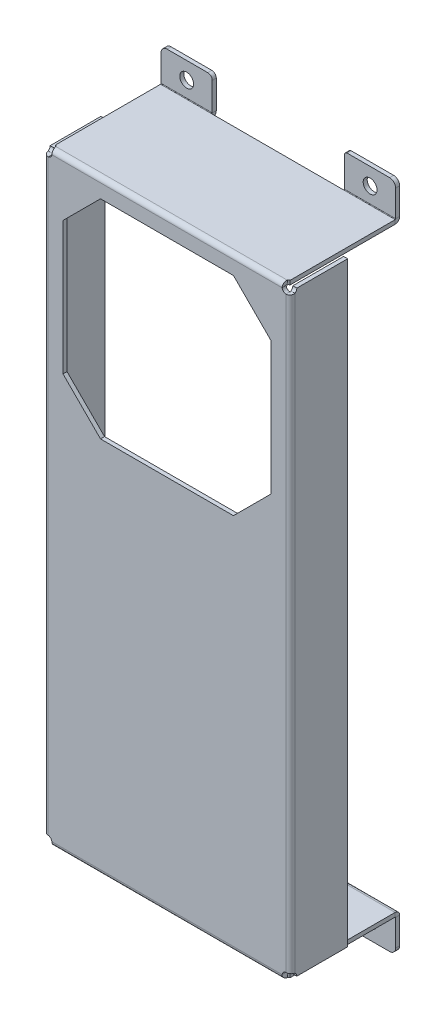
ISO-10303-21;
HEADER;
FILE_DESCRIPTION(('STEP AP214'),'2;1');
FILE_NAME('part.step','',(''),(''),'','','');
FILE_SCHEMA(('AUTOMOTIVE_DESIGN { 1 0 10303 214 1 1 1 1 }'));
ENDSEC;
DATA;
#1=APPLICATION_CONTEXT('core data for automotive mechanical design processes');
#2=APPLICATION_PROTOCOL_DEFINITION('international standard','automotive_design',2000,#1);
#3=PRODUCT_CONTEXT('',#1,'mechanical');
#4=PRODUCT('Part','Part','',(#3));
#5=PRODUCT_RELATED_PRODUCT_CATEGORY('part','',(#4));
#6=PRODUCT_DEFINITION_FORMATION('','',#4);
#7=PRODUCT_DEFINITION_CONTEXT('part definition',#1,'design');
#8=PRODUCT_DEFINITION('design','',#6,#7);
#9=PRODUCT_DEFINITION_SHAPE('','',#8);
#10=(LENGTH_UNIT() NAMED_UNIT(*) SI_UNIT(.MILLI.,.METRE.));
#11=(NAMED_UNIT(*) PLANE_ANGLE_UNIT() SI_UNIT($,.RADIAN.));
#12=(NAMED_UNIT(*) SI_UNIT($,.STERADIAN.) SOLID_ANGLE_UNIT());
#13=UNCERTAINTY_MEASURE_WITH_UNIT(LENGTH_MEASURE(1.E-05),#10,'distance_accuracy_value','');
#14=(GEOMETRIC_REPRESENTATION_CONTEXT(3) GLOBAL_UNCERTAINTY_ASSIGNED_CONTEXT((#13)) GLOBAL_UNIT_ASSIGNED_CONTEXT((#10,
#11,#12)) REPRESENTATION_CONTEXT('',''));
#15=CARTESIAN_POINT('',(0.,0.,0.));
#16=DIRECTION('',(0.,0.,1.));
#17=DIRECTION('',(1.,0.,0.));
#18=AXIS2_PLACEMENT_3D('',#15,#16,#17);
#19=CARTESIAN_POINT('',(357.874514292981,242.176482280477,272.607922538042));
#20=DIRECTION('',(9.54520423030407E-13,-1.,0.));
#21=DIRECTION('',(1.,9.5452042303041E-13,-9.54520423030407E-13));
#22=AXIS2_PLACEMENT_3D('',#19,#20,#21);
#23=PLANE('',#22);
#24=DIRECTION('',(9.5452042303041E-13,0.,1.));
#25=VECTOR('',#24,1.);
#26=CARTESIAN_POINT('',(443.028587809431,242.17648228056,-52.2541801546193));
#27=LINE('',#26,#25);
#28=CARTESIAN_POINT('',(443.028587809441,242.176482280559,-41.2990000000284));
#29=VERTEX_POINT('',#28);
#30=CARTESIAN_POINT('',(443.028587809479,242.176482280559,-2.22946372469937));
#31=VERTEX_POINT('',#30);
#32=EDGE_CURVE('E116',#29,#31,#27,.T.);
#33=ORIENTED_EDGE('',*,*,#32,.F.);
#34=DIRECTION('',(-1.,-9.54520423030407E-13,0.));
#35=VECTOR('',#34,1.);
#36=CARTESIAN_POINT('',(357.874514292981,242.176482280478,-41.299));
#37=LINE('',#36,#35);
#38=CARTESIAN_POINT('',(423.978587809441,242.176482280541,-41.2989999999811));
#39=VERTEX_POINT('',#38);
#40=EDGE_CURVE('E1561',#29,#39,#37,.T.);
#41=ORIENTED_EDGE('',*,*,#40,.T.);
#42=DIRECTION('',(1.,9.5452042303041E-13,-9.54520423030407E-13));
#43=VECTOR('',#42,1.);
#44=CARTESIAN_POINT('',(423.978587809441,242.176482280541,-41.2989999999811));
#45=LINE('',#44,#43);
#46=CARTESIAN_POINT('',(374.702587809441,242.176482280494,-41.2989999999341));
#47=VERTEX_POINT('',#46);
#48=EDGE_CURVE('E808',#47,#39,#45,.T.);
#49=ORIENTED_EDGE('',*,*,#48,.F.);
#50=DIRECTION('',(-1.,-9.54520423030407E-13,0.));
#51=VECTOR('',#50,1.);
#52=CARTESIAN_POINT('',(357.874514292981,242.176482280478,-41.299));
#53=LINE('',#52,#51);
#54=CARTESIAN_POINT('',(355.652587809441,242.176482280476,-41.2990000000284));
#55=VERTEX_POINT('',#54);
#56=EDGE_CURVE('E1571',#47,#55,#53,.T.);
#57=ORIENTED_EDGE('',*,*,#56,.T.);
#58=DIRECTION('',(-9.5452042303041E-13,0.,-1.));
#59=VECTOR('',#58,1.);
#60=CARTESIAN_POINT('',(355.652587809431,242.176482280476,-52.2850735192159));
#61=LINE('',#60,#59);
#62=CARTESIAN_POINT('',(355.652587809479,242.176482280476,-2.22946372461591));
#63=VERTEX_POINT('',#62);
#64=EDGE_CURVE('E811',#63,#55,#61,.T.);
#65=ORIENTED_EDGE('',*,*,#64,.F.);
#66=CARTESIAN_POINT('',(354.89058780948,242.176482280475,-0.836799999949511));
#67=DIRECTION('',(-9.54520423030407E-13,1.,0.));
#68=DIRECTION('',(1.,9.5452042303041E-13,-9.54520423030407E-13));
#69=AXIS2_PLACEMENT_3D('',#66,#67,#68);
#70=CIRCLE('',#69,1.58749999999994);
#71=CARTESIAN_POINT('',(356.220816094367,242.176482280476,-1.70319999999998));
#72=VERTEX_POINT('',#71);
#73=EDGE_CURVE('E785',#72,#63,#70,.T.);
#74=ORIENTED_EDGE('',*,*,#73,.F.);
#75=DIRECTION('',(1.,9.54520423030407E-13,0.));
#76=VECTOR('',#75,1.);
#77=CARTESIAN_POINT('',(357.874514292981,242.176482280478,-1.70319999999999));
#78=LINE('',#77,#76);
#79=CARTESIAN_POINT('',(442.460359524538,242.176482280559,-1.70320000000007));
#80=VERTEX_POINT('',#79);
#81=EDGE_CURVE('E802',#72,#80,#78,.T.);
#82=ORIENTED_EDGE('',*,*,#81,.T.);
#83=CARTESIAN_POINT('',(443.79058780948,242.17648228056,-0.836800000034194));
#84=DIRECTION('',(-9.54520423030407E-13,1.,0.));
#85=DIRECTION('',(1.,9.5452042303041E-13,-9.54520423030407E-13));
#86=AXIS2_PLACEMENT_3D('',#83,#84,#85);
#87=CIRCLE('',#86,1.58750000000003);
#88=EDGE_CURVE('E797',#31,#80,#87,.T.);
#89=ORIENTED_EDGE('',*,*,#88,.F.);
#90=EDGE_LOOP('',(#33,#41,#49,#57,#65,#74,#82,#89));
#91=FACE_BOUND('',#90,.T.);
#92=ADVANCED_FACE('F112',(#91),#23,.F.);
#93=CARTESIAN_POINT('',(357.87451429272,465.672931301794,-52.2850735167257));
#94=DIRECTION('',(0.,1.,0.));
#95=DIRECTION('',(1.,0.,0.));
#96=AXIS2_PLACEMENT_3D('',#93,#94,#95);
#97=PLANE('',#96);
#98=DIRECTION('',(0.,0.,-1.));
#99=VECTOR('',#98,1.);
#100=CARTESIAN_POINT('',(443.02858780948,465.672931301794,-52.2541801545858));
#101=LINE('',#100,#99);
#102=CARTESIAN_POINT('',(443.02858780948,465.672931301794,-2.22946372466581));
#103=VERTEX_POINT('',#102);
#104=CARTESIAN_POINT('',(443.02858780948,465.672931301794,-41.299));
#105=VERTEX_POINT('',#104);
#106=EDGE_CURVE('E1113',#103,#105,#101,.T.);
#107=ORIENTED_EDGE('',*,*,#106,.T.);
#108=DIRECTION('',(-1.,0.,0.));
#109=VECTOR('',#108,1.);
#110=CARTESIAN_POINT('',(357.87451429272,465.672931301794,-41.299));
#111=LINE('',#110,#109);
#112=CARTESIAN_POINT('',(423.97858780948,465.672931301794,-41.2989999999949));
#113=VERTEX_POINT('',#112);
#114=EDGE_CURVE('E1966',#105,#113,#111,.T.);
#115=ORIENTED_EDGE('',*,*,#114,.T.);
#116=DIRECTION('',(-1.,0.,0.));
#117=VECTOR('',#116,1.);
#118=CARTESIAN_POINT('',(423.97858780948,465.672931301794,-41.2989999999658));
#119=LINE('',#118,#117);
#120=CARTESIAN_POINT('',(374.70258780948,465.672931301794,-41.2989999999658));
#121=VERTEX_POINT('',#120);
#122=EDGE_CURVE('E1109',#113,#121,#119,.T.);
#123=ORIENTED_EDGE('',*,*,#122,.T.);
#124=DIRECTION('',(-1.,0.,0.));
#125=VECTOR('',#124,1.);
#126=CARTESIAN_POINT('',(357.87451429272,465.672931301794,-41.299));
#127=LINE('',#126,#125);
#128=CARTESIAN_POINT('',(355.65258780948,465.672931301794,-41.2989999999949));
#129=VERTEX_POINT('',#128);
#130=EDGE_CURVE('E1956',#121,#129,#127,.T.);
#131=ORIENTED_EDGE('',*,*,#130,.T.);
#132=DIRECTION('',(0.,0.,1.));
#133=VECTOR('',#132,1.);
#134=CARTESIAN_POINT('',(355.65258780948,465.672931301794,-52.2850735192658));
#135=LINE('',#134,#133);
#136=CARTESIAN_POINT('',(355.65258780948,465.672931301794,-2.22946372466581));
#137=VERTEX_POINT('',#136);
#138=EDGE_CURVE('E1112',#129,#137,#135,.T.);
#139=ORIENTED_EDGE('',*,*,#138,.T.);
#140=CARTESIAN_POINT('',(354.89058780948,465.672931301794,-0.836799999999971));
#141=DIRECTION('',(0.,-1.,0.));
#142=DIRECTION('',(1.,0.,0.));
#143=AXIS2_PLACEMENT_3D('',#140,#141,#142);
#144=CIRCLE('',#143,1.58750000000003);
#145=CARTESIAN_POINT('',(356.2208160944,465.672931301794,-1.70320000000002));
#146=VERTEX_POINT('',#145);
#147=EDGE_CURVE('E1114',#137,#146,#144,.T.);
#148=ORIENTED_EDGE('',*,*,#147,.T.);
#149=DIRECTION('',(1.,0.,0.));
#150=VECTOR('',#149,1.);
#151=CARTESIAN_POINT('',(357.87451429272,465.672931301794,-1.70320000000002));
#152=LINE('',#151,#150);
#153=CARTESIAN_POINT('',(442.46035952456,465.672931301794,-1.70320000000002));
#154=VERTEX_POINT('',#153);
#155=EDGE_CURVE('E1116',#146,#154,#152,.T.);
#156=ORIENTED_EDGE('',*,*,#155,.T.);
#157=CARTESIAN_POINT('',(443.79058780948,465.672931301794,-0.836800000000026));
#158=DIRECTION('',(0.,-1.,0.));
#159=DIRECTION('',(1.,0.,0.));
#160=AXIS2_PLACEMENT_3D('',#157,#158,#159);
#161=CIRCLE('',#160,1.58749999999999);
#162=EDGE_CURVE('E1927',#154,#103,#161,.T.);
#163=ORIENTED_EDGE('',*,*,#162,.T.);
#164=EDGE_LOOP('',(#107,#115,#123,#131,#139,#148,#156,#163));
#165=FACE_BOUND('',#164,.T.);
#166=ADVANCED_FACE('F1529',(#165),#97,.T.);
#167=CARTESIAN_POINT('',(355.65258780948,464.172931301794,-52.2850735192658));
#168=DIRECTION('',(-1.,0.,0.));
#169=DIRECTION('',(0.,1.,0.));
#170=AXIS2_PLACEMENT_3D('',#167,#168,#169);
#171=PLANE('',#170);
#172=ORIENTED_EDGE('',*,*,#138,.F.);
#173=DIRECTION('',(0.,-1.,0.));
#174=VECTOR('',#173,1.);
#175=CARTESIAN_POINT('',(355.65258780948,464.172931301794,-41.299));
#176=LINE('',#175,#174);
#177=CARTESIAN_POINT('',(355.65258780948,464.172931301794,-41.299));
#178=VERTEX_POINT('',#177);
#179=EDGE_CURVE('E1959',#129,#178,#176,.T.);
#180=ORIENTED_EDGE('',*,*,#179,.T.);
#181=DIRECTION('',(0.,0.,1.));
#182=VECTOR('',#181,1.);
#183=CARTESIAN_POINT('',(355.65258780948,464.172931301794,-52.2850735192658));
#184=LINE('',#183,#182);
#185=CARTESIAN_POINT('',(355.65258780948,464.172931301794,-2.22946372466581));
#186=VERTEX_POINT('',#185);
#187=EDGE_CURVE('E1128',#178,#186,#184,.T.);
#188=ORIENTED_EDGE('',*,*,#187,.T.);
#189=DIRECTION('',(0.,1.,0.));
#190=VECTOR('',#189,1.);
#191=CARTESIAN_POINT('',(355.65258780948,464.172931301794,-2.22946372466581));
#192=LINE('',#191,#190);
#193=EDGE_CURVE('E1123',#186,#137,#192,.T.);
#194=ORIENTED_EDGE('',*,*,#193,.T.);
#195=EDGE_LOOP('',(#172,#180,#188,#194));
#196=FACE_BOUND('',#195,.T.);
#197=ADVANCED_FACE('F1535',(#196),#171,.T.);
#198=CARTESIAN_POINT('',(443.02858780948,464.172931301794,-52.2541801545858));
#199=DIRECTION('',(1.,0.,0.));
#200=DIRECTION('',(0.,-1.,0.));
#201=AXIS2_PLACEMENT_3D('',#198,#199,#200);
#202=PLANE('',#201);
#203=DIRECTION('',(0.,0.,-1.));
#204=VECTOR('',#203,1.);
#205=CARTESIAN_POINT('',(443.02858780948,464.172931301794,-52.2541801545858));
#206=LINE('',#205,#204);
#207=CARTESIAN_POINT('',(443.02858780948,464.172931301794,-2.22946372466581));
#208=VERTEX_POINT('',#207);
#209=CARTESIAN_POINT('',(443.02858780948,464.172931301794,-41.299));
#210=VERTEX_POINT('',#209);
#211=EDGE_CURVE('E1132',#208,#210,#206,.T.);
#212=ORIENTED_EDGE('',*,*,#211,.T.);
#213=DIRECTION('',(0.,1.,0.));
#214=VECTOR('',#213,1.);
#215=CARTESIAN_POINT('',(443.02858780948,464.172931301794,-41.299));
#216=LINE('',#215,#214);
#217=EDGE_CURVE('E1964',#210,#105,#216,.T.);
#218=ORIENTED_EDGE('',*,*,#217,.T.);
#219=ORIENTED_EDGE('',*,*,#106,.F.);
#220=DIRECTION('',(0.,1.,0.));
#221=VECTOR('',#220,1.);
#222=CARTESIAN_POINT('',(443.02858780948,464.172931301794,-2.22946372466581));
#223=LINE('',#222,#221);
#224=EDGE_CURVE('E1099',#208,#103,#223,.T.);
#225=ORIENTED_EDGE('',*,*,#224,.F.);
#226=EDGE_LOOP('',(#212,#218,#219,#225));
#227=FACE_BOUND('',#226,.T.);
#228=ADVANCED_FACE('F1634',(#227),#202,.T.);
#229=CARTESIAN_POINT('',(354.89058780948,242.176482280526,-1.5));
#230=DIRECTION('',(0.,0.,1.));
#231=DIRECTION('',(1.,0.,0.));
#232=AXIS2_PLACEMENT_3D('',#229,#230,#231);
#233=CYLINDRICAL_SURFACE('',#232,1.58749999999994);
#234=CARTESIAN_POINT('',(354.89058780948,242.176482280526,-1.5));
#235=DIRECTION('',(0.,0.,-1.));
#236=DIRECTION('',(1.,0.,0.));
#237=AXIS2_PLACEMENT_3D('',#234,#235,#236);
#238=CIRCLE('',#237,1.58749999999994);
#239=CARTESIAN_POINT('',(355.09378780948,243.750923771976,-1.5));
#240=VERTEX_POINT('',#239);
#241=CARTESIAN_POINT('',(356.465029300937,242.379682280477,-1.5));
#242=VERTEX_POINT('',#241);
#243=EDGE_CURVE('E1614',#240,#242,#238,.T.);
#244=ORIENTED_EDGE('',*,*,#243,.T.);
#245=CARTESIAN_POINT('',(356.465029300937,242.379682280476,0.));
#246=CARTESIAN_POINT('',(356.465029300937,242.379682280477,-1.5));
#247=B_SPLINE_CURVE_WITH_KNOTS('',1,(#245,#246),.UNSPECIFIED.,.F.,.F.,(2,2),(0.,1.),.UNSPECIFIED.);
#248=CARTESIAN_POINT('',(356.465029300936,242.379682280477,0.));
#249=VERTEX_POINT('',#248);
#250=EDGE_CURVE('E1597',#242,#249,#247,.F.);
#251=ORIENTED_EDGE('',*,*,#250,.T.);
#252=CARTESIAN_POINT('',(354.89058780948,242.176482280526,0.));
#253=DIRECTION('',(0.,0.,-1.));
#254=DIRECTION('',(1.,0.,0.));
#255=AXIS2_PLACEMENT_3D('',#252,#253,#254);
#256=CIRCLE('',#255,1.58749999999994);
#257=CARTESIAN_POINT('',(355.09378780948,243.750923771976,0.));
#258=VERTEX_POINT('',#257);
#259=EDGE_CURVE('E1606',#258,#249,#256,.T.);
#260=ORIENTED_EDGE('',*,*,#259,.F.);
#261=CARTESIAN_POINT('',(355.09378780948,243.750923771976,-1.5));
#262=CARTESIAN_POINT('',(355.09378780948,243.750923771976,0.));
#263=B_SPLINE_CURVE_WITH_KNOTS('',1,(#261,#262),.UNSPECIFIED.,.F.,.F.,(2,2),(0.,1.),.UNSPECIFIED.);
#264=EDGE_CURVE('E1366',#240,#258,#263,.T.);
#265=ORIENTED_EDGE('',*,*,#264,.F.);
#266=EDGE_LOOP('',(#244,#251,#260,#265));
#267=FACE_BOUND('',#266,.T.);
#268=ADVANCED_FACE('F1613',(#267),#233,.F.);
#269=CARTESIAN_POINT('',(357.87451429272,515.62120481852,0.));
#270=DIRECTION('',(0.,0.,1.));
#271=DIRECTION('',(1.,0.,0.));
#272=AXIS2_PLACEMENT_3D('',#269,#270,#271);
#273=PLANE('',#272);
#274=DIRECTION('',(0.707106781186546,-0.707106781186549,0.));
#275=VECTOR('',#274,1.);
#276=CARTESIAN_POINT('',(374.57754173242,381.36893130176,0.));
#277=LINE('',#276,#275);
#278=CARTESIAN_POINT('',(360.60558780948,395.3408852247,0.));
#279=VERTEX_POINT('',#278);
#280=CARTESIAN_POINT('',(374.57754173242,381.36893130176,0.));
#281=VERTEX_POINT('',#280);
#282=EDGE_CURVE('E1420',#279,#281,#277,.T.);
#283=ORIENTED_EDGE('',*,*,#282,.F.);
#284=DIRECTION('',(0.,-1.,0.));
#285=VECTOR('',#284,1.);
#286=CARTESIAN_POINT('',(360.60558780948,395.3408852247,0.));
#287=LINE('',#286,#285);
#288=CARTESIAN_POINT('',(360.60558780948,444.86697737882,0.));
#289=VERTEX_POINT('',#288);
#290=EDGE_CURVE('E1415',#289,#279,#287,.T.);
#291=ORIENTED_EDGE('',*,*,#290,.F.);
#292=DIRECTION('',(-0.707106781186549,-0.707106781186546,0.));
#293=VECTOR('',#292,1.);
#294=CARTESIAN_POINT('',(360.60558780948,444.86697737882,0.));
#295=LINE('',#294,#293);
#296=CARTESIAN_POINT('',(374.57754173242,458.83893130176,0.));
#297=VERTEX_POINT('',#296);
#298=EDGE_CURVE('E1450',#297,#289,#295,.T.);
#299=ORIENTED_EDGE('',*,*,#298,.F.);
#300=DIRECTION('',(-1.,0.,0.));
#301=VECTOR('',#300,1.);
#302=CARTESIAN_POINT('',(374.57754173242,458.83893130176,0.));
#303=LINE('',#302,#301);
#304=CARTESIAN_POINT('',(424.10363388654,458.83893130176,0.));
#305=VERTEX_POINT('',#304);
#306=EDGE_CURVE('E1445',#305,#297,#303,.T.);
#307=ORIENTED_EDGE('',*,*,#306,.F.);
#308=DIRECTION('',(-0.70710678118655,0.707106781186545,0.));
#309=VECTOR('',#308,1.);
#310=CARTESIAN_POINT('',(424.10363388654,458.83893130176,0.));
#311=LINE('',#310,#309);
#312=CARTESIAN_POINT('',(438.07558780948,444.86697737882,0.));
#313=VERTEX_POINT('',#312);
#314=EDGE_CURVE('E1440',#313,#305,#311,.T.);
#315=ORIENTED_EDGE('',*,*,#314,.F.);
#316=DIRECTION('',(0.,1.,0.));
#317=VECTOR('',#316,1.);
#318=CARTESIAN_POINT('',(438.07558780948,395.3408852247,0.));
#319=LINE('',#318,#317);
#320=CARTESIAN_POINT('',(438.07558780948,395.3408852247,0.));
#321=VERTEX_POINT('',#320);
#322=EDGE_CURVE('E1435',#321,#313,#319,.T.);
#323=ORIENTED_EDGE('',*,*,#322,.F.);
#324=DIRECTION('',(0.707106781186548,0.707106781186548,0.));
#325=VECTOR('',#324,1.);
#326=CARTESIAN_POINT('',(438.07558780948,395.3408852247,0.));
#327=LINE('',#326,#325);
#328=CARTESIAN_POINT('',(424.10363388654,381.36893130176,0.));
#329=VERTEX_POINT('',#328);
#330=EDGE_CURVE('E1430',#329,#321,#327,.T.);
#331=ORIENTED_EDGE('',*,*,#330,.F.);
#332=DIRECTION('',(1.,0.,0.));
#333=VECTOR('',#332,1.);
#334=CARTESIAN_POINT('',(374.57754173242,381.36893130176,0.));
#335=LINE('',#334,#333);
#336=EDGE_CURVE('E1425',#281,#329,#335,.T.);
#337=ORIENTED_EDGE('',*,*,#336,.F.);
#338=EDGE_LOOP('',(#283,#291,#299,#307,#315,#323,#331,#337));
#339=FACE_BOUND('',#338,.T.);
#340=ORIENTED_EDGE('',*,*,#259,.T.);
#341=DIRECTION('',(1.,9.54520423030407E-13,0.));
#342=VECTOR('',#341,1.);
#343=CARTESIAN_POINT('',(357.874514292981,242.379682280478,0.));
#344=LINE('',#343,#342);
#345=CARTESIAN_POINT('',(442.216146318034,242.379682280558,0.));
#346=VERTEX_POINT('',#345);
#347=EDGE_CURVE('E1601',#249,#346,#344,.T.);
#348=ORIENTED_EDGE('',*,*,#347,.T.);
#349=CARTESIAN_POINT('',(443.79058780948,242.176482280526,0.));
#350=DIRECTION('',(0.,0.,-1.));
#351=DIRECTION('',(1.,0.,0.));
#352=AXIS2_PLACEMENT_3D('',#349,#350,#351);
#353=CIRCLE('',#352,1.58750000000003);
#354=CARTESIAN_POINT('',(443.58738780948,243.750923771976,0.));
#355=VERTEX_POINT('',#354);
#356=EDGE_CURVE('E1609',#346,#355,#353,.T.);
#357=ORIENTED_EDGE('',*,*,#356,.T.);
#358=DIRECTION('',(0.,-1.,0.));
#359=VECTOR('',#358,1.);
#360=CARTESIAN_POINT('',(443.58738780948,515.62120481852,0.));
#361=LINE('',#360,#359);
#362=CARTESIAN_POINT('',(443.58738780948,462.598489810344,0.));
#363=VERTEX_POINT('',#362);
#364=EDGE_CURVE('E1766',#363,#355,#361,.T.);
#365=ORIENTED_EDGE('',*,*,#364,.F.);
#366=CARTESIAN_POINT('',(443.79058780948,464.172931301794,0.));
#367=DIRECTION('',(0.,0.,-1.));
#368=DIRECTION('',(1.,0.,0.));
#369=AXIS2_PLACEMENT_3D('',#366,#367,#368);
#370=CIRCLE('',#369,1.58749999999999);
#371=CARTESIAN_POINT('',(442.21614631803,463.969731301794,0.));
#372=VERTEX_POINT('',#371);
#373=EDGE_CURVE('E1816',#363,#372,#370,.T.);
#374=ORIENTED_EDGE('',*,*,#373,.T.);
#375=DIRECTION('',(1.,0.,0.));
#376=VECTOR('',#375,1.);
#377=CARTESIAN_POINT('',(357.87451429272,463.969731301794,0.));
#378=LINE('',#377,#376);
#379=CARTESIAN_POINT('',(356.46502930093,463.969731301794,0.));
#380=VERTEX_POINT('',#379);
#381=EDGE_CURVE('E1828',#380,#372,#378,.T.);
#382=ORIENTED_EDGE('',*,*,#381,.F.);
#383=CARTESIAN_POINT('',(354.89058780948,464.172931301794,0.));
#384=DIRECTION('',(0.,0.,-1.));
#385=DIRECTION('',(1.,0.,0.));
#386=AXIS2_PLACEMENT_3D('',#383,#384,#385);
#387=CIRCLE('',#386,1.58750000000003);
#388=CARTESIAN_POINT('',(355.09378780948,462.598489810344,0.));
#389=VERTEX_POINT('',#388);
#390=EDGE_CURVE('E1650',#380,#389,#387,.T.);
#391=ORIENTED_EDGE('',*,*,#390,.T.);
#392=DIRECTION('',(0.,1.,0.));
#393=VECTOR('',#392,1.);
#394=CARTESIAN_POINT('',(355.09378780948,515.62120481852,0.));
#395=LINE('',#394,#393);
#396=EDGE_CURVE('E1465',#258,#389,#395,.T.);
#397=ORIENTED_EDGE('',*,*,#396,.F.);
#398=EDGE_LOOP('',(#340,#348,#357,#365,#374,#382,#391,#397));
#399=FACE_BOUND('',#398,.T.);
#400=ADVANCED_FACE('F1607',(#339,#399),#273,.T.);
#401=CARTESIAN_POINT('',(443.79058780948,242.176482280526,-1.5));
#402=DIRECTION('',(0.,0.,1.));
#403=DIRECTION('',(1.,0.,0.));
#404=AXIS2_PLACEMENT_3D('',#401,#402,#403);
#405=CYLINDRICAL_SURFACE('',#404,1.58750000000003);
#406=ORIENTED_EDGE('',*,*,#356,.F.);
#407=CARTESIAN_POINT('',(442.216146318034,242.379682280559,-1.5));
#408=CARTESIAN_POINT('',(442.216146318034,242.379682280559,0.));
#409=B_SPLINE_CURVE_WITH_KNOTS('',1,(#407,#408),.UNSPECIFIED.,.F.,.F.,(2,2),(0.,1.),.UNSPECIFIED.);
#410=CARTESIAN_POINT('',(442.216146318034,242.379682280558,-1.5));
#411=VERTEX_POINT('',#410);
#412=EDGE_CURVE('E920',#346,#411,#409,.F.);
#413=ORIENTED_EDGE('',*,*,#412,.T.);
#414=CARTESIAN_POINT('',(443.79058780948,242.176482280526,-1.5));
#415=DIRECTION('',(0.,0.,-1.));
#416=DIRECTION('',(1.,0.,0.));
#417=AXIS2_PLACEMENT_3D('',#414,#415,#416);
#418=CIRCLE('',#417,1.58750000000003);
#419=CARTESIAN_POINT('',(443.58738780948,243.750923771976,-1.5));
#420=VERTEX_POINT('',#419);
#421=EDGE_CURVE('E1663',#411,#420,#418,.T.);
#422=ORIENTED_EDGE('',*,*,#421,.T.);
#423=CARTESIAN_POINT('',(443.58738780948,243.750923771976,0.));
#424=CARTESIAN_POINT('',(443.58738780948,243.750923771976,-1.5));
#425=B_SPLINE_CURVE_WITH_KNOTS('',1,(#423,#424),.UNSPECIFIED.,.F.,.F.,(2,2),(0.,1.),.UNSPECIFIED.);
#426=EDGE_CURVE('E1095',#355,#420,#425,.T.);
#427=ORIENTED_EDGE('',*,*,#426,.F.);
#428=EDGE_LOOP('',(#406,#413,#422,#427));
#429=FACE_BOUND('',#428,.T.);
#430=ADVANCED_FACE('F1772',(#429),#405,.F.);
#431=CARTESIAN_POINT('',(357.87451429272,515.62120481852,-1.5));
#432=DIRECTION('',(0.,0.,1.));
#433=DIRECTION('',(1.,0.,0.));
#434=AXIS2_PLACEMENT_3D('',#431,#432,#433);
#435=PLANE('',#434);
#436=DIRECTION('',(1.,9.54520423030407E-13,0.));
#437=VECTOR('',#436,1.);
#438=CARTESIAN_POINT('',(357.874514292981,242.379682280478,-1.5));
#439=LINE('',#438,#437);
#440=EDGE_CURVE('E1623',#242,#411,#439,.T.);
#441=ORIENTED_EDGE('',*,*,#440,.F.);
#442=ORIENTED_EDGE('',*,*,#243,.F.);
#443=DIRECTION('',(0.,1.,0.));
#444=VECTOR('',#443,1.);
#445=CARTESIAN_POINT('',(355.09378780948,515.62120481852,-1.5));
#446=LINE('',#445,#444);
#447=CARTESIAN_POINT('',(355.09378780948,462.598489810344,-1.5));
#448=VERTEX_POINT('',#447);
#449=EDGE_CURVE('E1391',#240,#448,#446,.T.);
#450=ORIENTED_EDGE('',*,*,#449,.T.);
#451=CARTESIAN_POINT('',(354.89058780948,464.172931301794,-1.5));
#452=DIRECTION('',(0.,0.,-1.));
#453=DIRECTION('',(1.,0.,0.));
#454=AXIS2_PLACEMENT_3D('',#451,#452,#453);
#455=CIRCLE('',#454,1.58750000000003);
#456=CARTESIAN_POINT('',(356.46502930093,463.969731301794,-1.5));
#457=VERTEX_POINT('',#456);
#458=EDGE_CURVE('E1456',#457,#448,#455,.T.);
#459=ORIENTED_EDGE('',*,*,#458,.F.);
#460=DIRECTION('',(1.,0.,0.));
#461=VECTOR('',#460,1.);
#462=CARTESIAN_POINT('',(357.87451429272,463.969731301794,-1.5));
#463=LINE('',#462,#461);
#464=CARTESIAN_POINT('',(442.21614631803,463.969731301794,-1.5));
#465=VERTEX_POINT('',#464);
#466=EDGE_CURVE('E1831',#457,#465,#463,.T.);
#467=ORIENTED_EDGE('',*,*,#466,.T.);
#468=CARTESIAN_POINT('',(443.79058780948,464.172931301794,-1.5));
#469=DIRECTION('',(0.,0.,-1.));
#470=DIRECTION('',(1.,0.,0.));
#471=AXIS2_PLACEMENT_3D('',#468,#469,#470);
#472=CIRCLE('',#471,1.58749999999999);
#473=CARTESIAN_POINT('',(443.58738780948,462.598489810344,-1.5));
#474=VERTEX_POINT('',#473);
#475=EDGE_CURVE('E1453',#474,#465,#472,.T.);
#476=ORIENTED_EDGE('',*,*,#475,.F.);
#477=DIRECTION('',(0.,-1.,0.));
#478=VECTOR('',#477,1.);
#479=CARTESIAN_POINT('',(443.58738780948,515.62120481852,-1.5));
#480=LINE('',#479,#478);
#481=EDGE_CURVE('E1720',#474,#420,#480,.T.);
#482=ORIENTED_EDGE('',*,*,#481,.T.);
#483=ORIENTED_EDGE('',*,*,#421,.F.);
#484=EDGE_LOOP('',(#441,#442,#450,#459,#467,#476,#482,#483));
#485=FACE_BOUND('',#484,.T.);
#486=DIRECTION('',(0.,-1.,0.));
#487=VECTOR('',#486,1.);
#488=CARTESIAN_POINT('',(360.60558780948,395.3408852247,-1.5));
#489=LINE('',#488,#487);
#490=CARTESIAN_POINT('',(360.60558780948,444.86697737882,-1.5));
#491=VERTEX_POINT('',#490);
#492=CARTESIAN_POINT('',(360.60558780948,395.3408852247,-1.5));
#493=VERTEX_POINT('',#492);
#494=EDGE_CURVE('E1410',#491,#493,#489,.T.);
#495=ORIENTED_EDGE('',*,*,#494,.T.);
#496=DIRECTION('',(0.707106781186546,-0.707106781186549,0.));
#497=VECTOR('',#496,1.);
#498=CARTESIAN_POINT('',(374.57754173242,381.36893130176,-1.5));
#499=LINE('',#498,#497);
#500=CARTESIAN_POINT('',(374.57754173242,381.36893130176,-1.5));
#501=VERTEX_POINT('',#500);
#502=EDGE_CURVE('E1407',#493,#501,#499,.T.);
#503=ORIENTED_EDGE('',*,*,#502,.T.);
#504=DIRECTION('',(1.,0.,0.));
#505=VECTOR('',#504,1.);
#506=CARTESIAN_POINT('',(374.57754173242,381.36893130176,-1.5));
#507=LINE('',#506,#505);
#508=CARTESIAN_POINT('',(424.10363388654,381.36893130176,-1.5));
#509=VERTEX_POINT('',#508);
#510=EDGE_CURVE('E1404',#501,#509,#507,.T.);
#511=ORIENTED_EDGE('',*,*,#510,.T.);
#512=DIRECTION('',(0.707106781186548,0.707106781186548,0.));
#513=VECTOR('',#512,1.);
#514=CARTESIAN_POINT('',(438.07558780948,395.3408852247,-1.5));
#515=LINE('',#514,#513);
#516=CARTESIAN_POINT('',(438.07558780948,395.3408852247,-1.5));
#517=VERTEX_POINT('',#516);
#518=EDGE_CURVE('E1401',#509,#517,#515,.T.);
#519=ORIENTED_EDGE('',*,*,#518,.T.);
#520=DIRECTION('',(0.,1.,0.));
#521=VECTOR('',#520,1.);
#522=CARTESIAN_POINT('',(438.07558780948,395.3408852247,-1.5));
#523=LINE('',#522,#521);
#524=CARTESIAN_POINT('',(438.07558780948,444.86697737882,-1.5));
#525=VERTEX_POINT('',#524);
#526=EDGE_CURVE('E1398',#517,#525,#523,.T.);
#527=ORIENTED_EDGE('',*,*,#526,.T.);
#528=DIRECTION('',(-0.70710678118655,0.707106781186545,0.));
#529=VECTOR('',#528,1.);
#530=CARTESIAN_POINT('',(424.10363388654,458.83893130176,-1.5));
#531=LINE('',#530,#529);
#532=CARTESIAN_POINT('',(424.10363388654,458.83893130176,-1.5));
#533=VERTEX_POINT('',#532);
#534=EDGE_CURVE('E1395',#525,#533,#531,.T.);
#535=ORIENTED_EDGE('',*,*,#534,.T.);
#536=DIRECTION('',(-1.,0.,0.));
#537=VECTOR('',#536,1.);
#538=CARTESIAN_POINT('',(374.57754173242,458.83893130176,-1.5));
#539=LINE('',#538,#537);
#540=CARTESIAN_POINT('',(374.57754173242,458.83893130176,-1.5));
#541=VERTEX_POINT('',#540);
#542=EDGE_CURVE('E1392',#533,#541,#539,.T.);
#543=ORIENTED_EDGE('',*,*,#542,.T.);
#544=DIRECTION('',(-0.707106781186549,-0.707106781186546,0.));
#545=VECTOR('',#544,1.);
#546=CARTESIAN_POINT('',(360.60558780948,444.86697737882,-1.5));
#547=LINE('',#546,#545);
#548=EDGE_CURVE('E1383',#541,#491,#547,.T.);
#549=ORIENTED_EDGE('',*,*,#548,.T.);
#550=EDGE_LOOP('',(#495,#503,#511,#519,#527,#535,#543,#549));
#551=FACE_BOUND('',#550,.T.);
#552=ADVANCED_FACE('F1780',(#485,#551),#435,.F.);
#553=CARTESIAN_POINT('',(354.89058780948,242.176482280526,-0.836800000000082));
#554=DIRECTION('',(-1.,0.,0.));
#555=DIRECTION('',(0.,0.,1.));
#556=AXIS2_PLACEMENT_3D('',#553,#554,#555);
#557=CYLINDRICAL_SURFACE('',#556,1.58749999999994);
#558=CARTESIAN_POINT('',(354.89058780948,242.176482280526,-0.836800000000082));
#559=DIRECTION('',(1.,0.,0.));
#560=DIRECTION('',(0.,0.,1.));
#561=AXIS2_PLACEMENT_3D('',#558,#559,#560);
#562=CIRCLE('',#561,1.58749999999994);
#563=CARTESIAN_POINT('',(354.89058780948,242.17648228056,-2.42430000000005));
#564=VERTEX_POINT('',#563);
#565=CARTESIAN_POINT('',(354.89058780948,243.506710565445,-1.70320000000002));
#566=VERTEX_POINT('',#565);
#567=EDGE_CURVE('E1896',#564,#566,#562,.T.);
#568=ORIENTED_EDGE('',*,*,#567,.T.);
#569=CARTESIAN_POINT('',(353.39058780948,243.506710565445,-1.70319999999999));
#570=CARTESIAN_POINT('',(354.89058780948,243.506710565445,-1.7032));
#571=B_SPLINE_CURVE_WITH_KNOTS('',1,(#569,#570),.UNSPECIFIED.,.F.,.F.,(2,2),(0.,1.),.UNSPECIFIED.);
#572=CARTESIAN_POINT('',(353.39058780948,243.506710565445,-1.70320000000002));
#573=VERTEX_POINT('',#572);
#574=EDGE_CURVE('E1847',#566,#573,#571,.F.);
#575=ORIENTED_EDGE('',*,*,#574,.T.);
#576=CARTESIAN_POINT('',(353.39058780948,242.176482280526,-0.836800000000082));
#577=DIRECTION('',(1.,0.,0.));
#578=DIRECTION('',(0.,0.,1.));
#579=AXIS2_PLACEMENT_3D('',#576,#577,#578);
#580=CIRCLE('',#579,1.58749999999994);
#581=CARTESIAN_POINT('',(353.39058780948,242.17648228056,-2.42430000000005));
#582=VERTEX_POINT('',#581);
#583=EDGE_CURVE('E1883',#582,#573,#580,.T.);
#584=ORIENTED_EDGE('',*,*,#583,.F.);
#585=DIRECTION('',(-1.,0.,0.));
#586=VECTOR('',#585,1.);
#587=CARTESIAN_POINT('',(354.89058780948,242.17648228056,-2.42430000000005));
#588=LINE('',#587,#586);
#589=EDGE_CURVE('E2931',#564,#582,#588,.T.);
#590=ORIENTED_EDGE('',*,*,#589,.F.);
#591=EDGE_LOOP('',(#568,#575,#584,#590));
#592=FACE_BOUND('',#591,.T.);
#593=ADVANCED_FACE('F1477',(#592),#557,.F.);
#594=CARTESIAN_POINT('',(354.89058780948,464.172931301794,-0.836800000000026));
#595=DIRECTION('',(-1.,0.,0.));
#596=DIRECTION('',(0.,0.,1.));
#597=AXIS2_PLACEMENT_3D('',#594,#595,#596);
#598=CYLINDRICAL_SURFACE('',#597,1.58750000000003);
#599=CARTESIAN_POINT('',(353.39058780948,464.172931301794,-0.836800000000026));
#600=DIRECTION('',(1.,0.,0.));
#601=DIRECTION('',(0.,0.,1.));
#602=AXIS2_PLACEMENT_3D('',#599,#600,#601);
#603=CIRCLE('',#602,1.58750000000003);
#604=CARTESIAN_POINT('',(353.39058780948,462.842703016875,-1.70320000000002));
#605=VERTEX_POINT('',#604);
#606=CARTESIAN_POINT('',(353.39058780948,464.17293130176,-2.42430000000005));
#607=VERTEX_POINT('',#606);
#608=EDGE_CURVE('E1649',#605,#607,#603,.T.);
#609=ORIENTED_EDGE('',*,*,#608,.F.);
#610=CARTESIAN_POINT('',(354.89058780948,462.842703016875,-1.7032));
#611=CARTESIAN_POINT('',(353.39058780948,462.842703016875,-1.70319999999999));
#612=B_SPLINE_CURVE_WITH_KNOTS('',1,(#610,#611),.UNSPECIFIED.,.F.,.F.,(2,2),(0.,1.),.UNSPECIFIED.);
#613=CARTESIAN_POINT('',(354.89058780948,462.842703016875,-1.7032));
#614=VERTEX_POINT('',#613);
#615=EDGE_CURVE('E1900',#605,#614,#612,.F.);
#616=ORIENTED_EDGE('',*,*,#615,.T.);
#617=CARTESIAN_POINT('',(354.89058780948,464.172931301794,-0.836800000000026));
#618=DIRECTION('',(1.,0.,0.));
#619=DIRECTION('',(0.,0.,1.));
#620=AXIS2_PLACEMENT_3D('',#617,#618,#619);
#621=CIRCLE('',#620,1.58750000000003);
#622=CARTESIAN_POINT('',(354.89058780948,464.17293130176,-2.42430000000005));
#623=VERTEX_POINT('',#622);
#624=EDGE_CURVE('E1891',#614,#623,#621,.T.);
#625=ORIENTED_EDGE('',*,*,#624,.T.);
#626=DIRECTION('',(-1.,0.,0.));
#627=VECTOR('',#626,1.);
#628=CARTESIAN_POINT('',(354.89058780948,464.17293130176,-2.42430000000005));
#629=LINE('',#628,#627);
#630=EDGE_CURVE('E2936',#623,#607,#629,.T.);
#631=ORIENTED_EDGE('',*,*,#630,.T.);
#632=EDGE_LOOP('',(#609,#616,#625,#631));
#633=FACE_BOUND('',#632,.T.);
#634=ADVANCED_FACE('F1858',(#633),#598,.F.);
#635=CARTESIAN_POINT('',(353.39058780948,515.62120481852,2.14712648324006));
#636=DIRECTION('',(-1.,0.,0.));
#637=DIRECTION('',(0.,0.,1.));
#638=AXIS2_PLACEMENT_3D('',#635,#636,#637);
#639=PLANE('',#638);
#640=ORIENTED_EDGE('',*,*,#583,.T.);
#641=DIRECTION('',(0.,1.,0.));
#642=VECTOR('',#641,1.);
#643=CARTESIAN_POINT('',(353.39058780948,515.62120481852,-1.70320000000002));
#644=LINE('',#643,#642);
#645=EDGE_CURVE('E1885',#573,#605,#644,.T.);
#646=ORIENTED_EDGE('',*,*,#645,.T.);
#647=ORIENTED_EDGE('',*,*,#608,.T.);
#648=DIRECTION('',(0.,0.,-1.));
#649=VECTOR('',#648,1.);
#650=CARTESIAN_POINT('',(353.39058780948,464.17293130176,-2.42430000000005));
#651=LINE('',#650,#649);
#652=CARTESIAN_POINT('',(353.39058780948,464.17293130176,-21.36));
#653=VERTEX_POINT('',#652);
#654=EDGE_CURVE('E2920',#607,#653,#651,.T.);
#655=ORIENTED_EDGE('',*,*,#654,.T.);
#656=DIRECTION('',(0.,-1.,0.));
#657=VECTOR('',#656,1.);
#658=CARTESIAN_POINT('',(353.39058780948,242.17648228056,-21.36));
#659=LINE('',#658,#657);
#660=CARTESIAN_POINT('',(353.39058780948,242.17648228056,-21.36));
#661=VERTEX_POINT('',#660);
#662=EDGE_CURVE('E2914',#653,#661,#659,.T.);
#663=ORIENTED_EDGE('',*,*,#662,.T.);
#664=DIRECTION('',(0.,0.,1.));
#665=VECTOR('',#664,1.);
#666=CARTESIAN_POINT('',(353.39058780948,242.17648228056,-2.42430000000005));
#667=LINE('',#666,#665);
#668=EDGE_CURVE('E1889',#661,#582,#667,.T.);
#669=ORIENTED_EDGE('',*,*,#668,.T.);
#670=EDGE_LOOP('',(#640,#646,#647,#655,#663,#669));
#671=FACE_BOUND('',#670,.T.);
#672=ADVANCED_FACE('F1867',(#671),#639,.T.);
#673=CARTESIAN_POINT('',(354.89058780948,242.17648228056,-2.42430000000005));
#674=DIRECTION('',(0.,-1.,0.));
#675=DIRECTION('',(1.,0.,0.));
#676=AXIS2_PLACEMENT_3D('',#673,#674,#675);
#677=PLANE('',#676);
#678=ORIENTED_EDGE('',*,*,#668,.F.);
#679=DIRECTION('',(-1.,0.,0.));
#680=VECTOR('',#679,1.);
#681=CARTESIAN_POINT('',(354.89058780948,242.17648228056,-21.36));
#682=LINE('',#681,#680);
#683=CARTESIAN_POINT('',(354.89058780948,242.17648228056,-21.36));
#684=VERTEX_POINT('',#683);
#685=EDGE_CURVE('E2919',#684,#661,#682,.T.);
#686=ORIENTED_EDGE('',*,*,#685,.F.);
#687=DIRECTION('',(0.,0.,1.));
#688=VECTOR('',#687,1.);
#689=CARTESIAN_POINT('',(354.89058780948,242.17648228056,-2.42430000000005));
#690=LINE('',#689,#688);
#691=EDGE_CURVE('E2928',#684,#564,#690,.T.);
#692=ORIENTED_EDGE('',*,*,#691,.T.);
#693=ORIENTED_EDGE('',*,*,#589,.T.);
#694=EDGE_LOOP('',(#678,#686,#692,#693));
#695=FACE_BOUND('',#694,.T.);
#696=ADVANCED_FACE('F1872',(#695),#677,.T.);
#697=CARTESIAN_POINT('',(354.89058780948,242.17648228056,-21.36));
#698=DIRECTION('',(0.,0.,-1.));
#699=DIRECTION('',(-1.,0.,0.));
#700=AXIS2_PLACEMENT_3D('',#697,#698,#699);
#701=PLANE('',#700);
#702=ORIENTED_EDGE('',*,*,#662,.F.);
#703=DIRECTION('',(-1.,0.,0.));
#704=VECTOR('',#703,1.);
#705=CARTESIAN_POINT('',(354.89058780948,464.17293130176,-21.36));
#706=LINE('',#705,#704);
#707=CARTESIAN_POINT('',(354.89058780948,464.17293130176,-21.36));
#708=VERTEX_POINT('',#707);
#709=EDGE_CURVE('E2917',#708,#653,#706,.T.);
#710=ORIENTED_EDGE('',*,*,#709,.F.);
#711=DIRECTION('',(0.,-1.,0.));
#712=VECTOR('',#711,1.);
#713=CARTESIAN_POINT('',(354.89058780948,242.17648228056,-21.36));
#714=LINE('',#713,#712);
#715=EDGE_CURVE('E2946',#708,#684,#714,.T.);
#716=ORIENTED_EDGE('',*,*,#715,.T.);
#717=ORIENTED_EDGE('',*,*,#685,.T.);
#718=EDGE_LOOP('',(#702,#710,#716,#717));
#719=FACE_BOUND('',#718,.T.);
#720=ADVANCED_FACE('F1877',(#719),#701,.T.);
#721=CARTESIAN_POINT('',(354.89058780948,464.17293130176,-2.42430000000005));
#722=DIRECTION('',(0.,1.,0.));
#723=DIRECTION('',(-1.,0.,0.));
#724=AXIS2_PLACEMENT_3D('',#721,#722,#723);
#725=PLANE('',#724);
#726=ORIENTED_EDGE('',*,*,#654,.F.);
#727=ORIENTED_EDGE('',*,*,#630,.F.);
#728=DIRECTION('',(0.,0.,-1.));
#729=VECTOR('',#728,1.);
#730=CARTESIAN_POINT('',(354.89058780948,464.17293130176,-2.42430000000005));
#731=LINE('',#730,#729);
#732=EDGE_CURVE('E1651',#623,#708,#731,.T.);
#733=ORIENTED_EDGE('',*,*,#732,.T.);
#734=ORIENTED_EDGE('',*,*,#709,.T.);
#735=EDGE_LOOP('',(#726,#727,#733,#734));
#736=FACE_BOUND('',#735,.T.);
#737=ADVANCED_FACE('F2836',(#736),#725,.T.);
#738=CARTESIAN_POINT('',(354.89058780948,515.62120481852,2.14712648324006));
#739=DIRECTION('',(-1.,0.,0.));
#740=DIRECTION('',(0.,0.,1.));
#741=AXIS2_PLACEMENT_3D('',#738,#739,#740);
#742=PLANE('',#741);
#743=DIRECTION('',(0.,1.,0.));
#744=VECTOR('',#743,1.);
#745=CARTESIAN_POINT('',(354.89058780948,515.62120481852,-1.70320000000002));
#746=LINE('',#745,#744);
#747=EDGE_CURVE('E2933',#566,#614,#746,.T.);
#748=ORIENTED_EDGE('',*,*,#747,.F.);
#749=ORIENTED_EDGE('',*,*,#567,.F.);
#750=ORIENTED_EDGE('',*,*,#691,.F.);
#751=ORIENTED_EDGE('',*,*,#715,.F.);
#752=ORIENTED_EDGE('',*,*,#732,.F.);
#753=ORIENTED_EDGE('',*,*,#624,.F.);
#754=EDGE_LOOP('',(#748,#749,#750,#751,#752,#753));
#755=FACE_BOUND('',#754,.T.);
#756=ADVANCED_FACE('F1869',(#755),#742,.F.);
#757=CARTESIAN_POINT('',(443.79058780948,464.172931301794,-1.5));
#758=DIRECTION('',(0.,0.,1.));
#759=DIRECTION('',(1.,0.,0.));
#760=AXIS2_PLACEMENT_3D('',#757,#758,#759);
#761=CYLINDRICAL_SURFACE('',#760,1.58749999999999);
#762=CARTESIAN_POINT('',(443.58738780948,462.598489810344,-1.5));
#763=CARTESIAN_POINT('',(443.58738780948,462.598489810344,0.));
#764=B_SPLINE_CURVE_WITH_KNOTS('',1,(#762,#763),.UNSPECIFIED.,.F.,.F.,(2,2),(0.,1.),.UNSPECIFIED.);
#765=EDGE_CURVE('E1080',#474,#363,#764,.T.);
#766=ORIENTED_EDGE('',*,*,#765,.F.);
#767=ORIENTED_EDGE('',*,*,#475,.T.);
#768=CARTESIAN_POINT('',(442.21614631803,463.969731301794,0.));
#769=CARTESIAN_POINT('',(442.21614631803,463.969731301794,-1.5));
#770=B_SPLINE_CURVE_WITH_KNOTS('',1,(#768,#769),.UNSPECIFIED.,.F.,.F.,(2,2),(0.,1.),.UNSPECIFIED.);
#771=EDGE_CURVE('E1255',#372,#465,#770,.T.);
#772=ORIENTED_EDGE('',*,*,#771,.F.);
#773=ORIENTED_EDGE('',*,*,#373,.F.);
#774=EDGE_LOOP('',(#766,#767,#772,#773));
#775=FACE_BOUND('',#774,.T.);
#776=ADVANCED_FACE('F1480',(#775),#761,.F.);
#777=CARTESIAN_POINT('',(360.60558780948,444.86697737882,-1.5));
#778=DIRECTION('',(-0.707106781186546,0.707106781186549,0.));
#779=DIRECTION('',(-0.707106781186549,-0.707106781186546,0.));
#780=AXIS2_PLACEMENT_3D('',#777,#778,#779);
#781=PLANE('',#780);
#782=ORIENTED_EDGE('',*,*,#298,.T.);
#783=DIRECTION('',(0.,0.,1.));
#784=VECTOR('',#783,1.);
#785=CARTESIAN_POINT('',(360.60558780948,444.86697737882,-1.5));
#786=LINE('',#785,#784);
#787=EDGE_CURVE('E1413',#491,#289,#786,.T.);
#788=ORIENTED_EDGE('',*,*,#787,.F.);
#789=ORIENTED_EDGE('',*,*,#548,.F.);
#790=DIRECTION('',(0.,0.,1.));
#791=VECTOR('',#790,1.);
#792=CARTESIAN_POINT('',(374.57754173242,458.83893130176,-1.5));
#793=LINE('',#792,#791);
#794=EDGE_CURVE('E1448',#541,#297,#793,.T.);
#795=ORIENTED_EDGE('',*,*,#794,.T.);
#796=EDGE_LOOP('',(#782,#788,#789,#795));
#797=FACE_BOUND('',#796,.T.);
#798=ADVANCED_FACE('F1340',(#797),#781,.F.);
#799=CARTESIAN_POINT('',(374.57754173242,458.83893130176,-1.5));
#800=DIRECTION('',(0.,1.,0.));
#801=DIRECTION('',(0.,0.,1.));
#802=AXIS2_PLACEMENT_3D('',#799,#800,#801);
#803=PLANE('',#802);
#804=ORIENTED_EDGE('',*,*,#306,.T.);
#805=ORIENTED_EDGE('',*,*,#794,.F.);
#806=ORIENTED_EDGE('',*,*,#542,.F.);
#807=DIRECTION('',(0.,0.,1.));
#808=VECTOR('',#807,1.);
#809=CARTESIAN_POINT('',(424.10363388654,458.83893130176,-1.5));
#810=LINE('',#809,#808);
#811=EDGE_CURVE('E1443',#533,#305,#810,.T.);
#812=ORIENTED_EDGE('',*,*,#811,.T.);
#813=EDGE_LOOP('',(#804,#805,#806,#812));
#814=FACE_BOUND('',#813,.T.);
#815=ADVANCED_FACE('F2811',(#814),#803,.F.);
#816=CARTESIAN_POINT('',(424.10363388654,458.83893130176,-1.5));
#817=DIRECTION('',(0.707106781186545,0.70710678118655,0.));
#818=DIRECTION('',(-0.70710678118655,0.707106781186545,0.));
#819=AXIS2_PLACEMENT_3D('',#816,#817,#818);
#820=PLANE('',#819);
#821=ORIENTED_EDGE('',*,*,#314,.T.);
#822=ORIENTED_EDGE('',*,*,#811,.F.);
#823=ORIENTED_EDGE('',*,*,#534,.F.);
#824=DIRECTION('',(0.,0.,1.));
#825=VECTOR('',#824,1.);
#826=CARTESIAN_POINT('',(438.07558780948,444.86697737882,-1.5));
#827=LINE('',#826,#825);
#828=EDGE_CURVE('E1438',#525,#313,#827,.T.);
#829=ORIENTED_EDGE('',*,*,#828,.T.);
#830=EDGE_LOOP('',(#821,#822,#823,#829));
#831=FACE_BOUND('',#830,.T.);
#832=ADVANCED_FACE('F2800',(#831),#820,.F.);
#833=CARTESIAN_POINT('',(438.07558780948,395.3408852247,-1.5));
#834=DIRECTION('',(1.,0.,0.));
#835=DIRECTION('',(0.,0.,-1.));
#836=AXIS2_PLACEMENT_3D('',#833,#834,#835);
#837=PLANE('',#836);
#838=ORIENTED_EDGE('',*,*,#322,.T.);
#839=ORIENTED_EDGE('',*,*,#828,.F.);
#840=ORIENTED_EDGE('',*,*,#526,.F.);
#841=DIRECTION('',(0.,0.,1.));
#842=VECTOR('',#841,1.);
#843=CARTESIAN_POINT('',(438.07558780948,395.3408852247,-1.5));
#844=LINE('',#843,#842);
#845=EDGE_CURVE('E1433',#517,#321,#844,.T.);
#846=ORIENTED_EDGE('',*,*,#845,.T.);
#847=EDGE_LOOP('',(#838,#839,#840,#846));
#848=FACE_BOUND('',#847,.T.);
#849=ADVANCED_FACE('F2789',(#848),#837,.F.);
#850=CARTESIAN_POINT('',(438.07558780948,395.3408852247,-1.5));
#851=DIRECTION('',(0.707106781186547,-0.707106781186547,0.));
#852=DIRECTION('',(0.707106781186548,0.707106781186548,0.));
#853=AXIS2_PLACEMENT_3D('',#850,#851,#852);
#854=PLANE('',#853);
#855=ORIENTED_EDGE('',*,*,#330,.T.);
#856=ORIENTED_EDGE('',*,*,#845,.F.);
#857=ORIENTED_EDGE('',*,*,#518,.F.);
#858=DIRECTION('',(0.,0.,1.));
#859=VECTOR('',#858,1.);
#860=CARTESIAN_POINT('',(424.10363388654,381.36893130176,-1.5));
#861=LINE('',#860,#859);
#862=EDGE_CURVE('E1428',#509,#329,#861,.T.);
#863=ORIENTED_EDGE('',*,*,#862,.T.);
#864=EDGE_LOOP('',(#855,#856,#857,#863));
#865=FACE_BOUND('',#864,.T.);
#866=ADVANCED_FACE('F2778',(#865),#854,.F.);
#867=CARTESIAN_POINT('',(374.57754173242,381.36893130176,-1.5));
#868=DIRECTION('',(0.,-1.,0.));
#869=DIRECTION('',(0.,0.,-1.));
#870=AXIS2_PLACEMENT_3D('',#867,#868,#869);
#871=PLANE('',#870);
#872=ORIENTED_EDGE('',*,*,#336,.T.);
#873=ORIENTED_EDGE('',*,*,#862,.F.);
#874=ORIENTED_EDGE('',*,*,#510,.F.);
#875=DIRECTION('',(0.,0.,1.));
#876=VECTOR('',#875,1.);
#877=CARTESIAN_POINT('',(374.57754173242,381.36893130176,-1.5));
#878=LINE('',#877,#876);
#879=EDGE_CURVE('E1422',#501,#281,#878,.T.);
#880=ORIENTED_EDGE('',*,*,#879,.T.);
#881=EDGE_LOOP('',(#872,#873,#874,#880));
#882=FACE_BOUND('',#881,.T.);
#883=ADVANCED_FACE('F2767',(#882),#871,.F.);
#884=CARTESIAN_POINT('',(374.57754173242,381.36893130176,-1.5));
#885=DIRECTION('',(-0.707106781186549,-0.707106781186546,0.));
#886=DIRECTION('',(0.707106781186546,-0.707106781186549,0.));
#887=AXIS2_PLACEMENT_3D('',#884,#885,#886);
#888=PLANE('',#887);
#889=ORIENTED_EDGE('',*,*,#282,.T.);
#890=ORIENTED_EDGE('',*,*,#879,.F.);
#891=ORIENTED_EDGE('',*,*,#502,.F.);
#892=DIRECTION('',(0.,0.,1.));
#893=VECTOR('',#892,1.);
#894=CARTESIAN_POINT('',(360.60558780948,395.3408852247,-1.5));
#895=LINE('',#894,#893);
#896=EDGE_CURVE('E1418',#493,#279,#895,.T.);
#897=ORIENTED_EDGE('',*,*,#896,.T.);
#898=EDGE_LOOP('',(#889,#890,#891,#897));
#899=FACE_BOUND('',#898,.T.);
#900=ADVANCED_FACE('F2756',(#899),#888,.F.);
#901=CARTESIAN_POINT('',(360.60558780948,395.3408852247,-1.5));
#902=DIRECTION('',(-1.,0.,0.));
#903=DIRECTION('',(0.,0.,1.));
#904=AXIS2_PLACEMENT_3D('',#901,#902,#903);
#905=PLANE('',#904);
#906=ORIENTED_EDGE('',*,*,#290,.T.);
#907=ORIENTED_EDGE('',*,*,#896,.F.);
#908=ORIENTED_EDGE('',*,*,#494,.F.);
#909=ORIENTED_EDGE('',*,*,#787,.T.);
#910=EDGE_LOOP('',(#906,#907,#908,#909));
#911=FACE_BOUND('',#910,.T.);
#912=ADVANCED_FACE('F1476',(#911),#905,.F.);
#913=CARTESIAN_POINT('',(354.89058780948,464.172931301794,-1.5));
#914=DIRECTION('',(0.,0.,1.));
#915=DIRECTION('',(1.,0.,0.));
#916=AXIS2_PLACEMENT_3D('',#913,#914,#915);
#917=CYLINDRICAL_SURFACE('',#916,1.58750000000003);
#918=CARTESIAN_POINT('',(356.46502930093,463.969731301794,-1.5));
#919=CARTESIAN_POINT('',(356.46502930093,463.969731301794,0.));
#920=B_SPLINE_CURVE_WITH_KNOTS('',1,(#918,#919),.UNSPECIFIED.,.F.,.F.,(2,2),(0.,1.),.UNSPECIFIED.);
#921=EDGE_CURVE('E1240',#457,#380,#920,.T.);
#922=ORIENTED_EDGE('',*,*,#921,.F.);
#923=ORIENTED_EDGE('',*,*,#458,.T.);
#924=CARTESIAN_POINT('',(355.09378780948,462.598489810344,0.));
#925=CARTESIAN_POINT('',(355.09378780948,462.598489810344,-1.5));
#926=B_SPLINE_CURVE_WITH_KNOTS('',1,(#924,#925),.UNSPECIFIED.,.F.,.F.,(2,2),(0.,1.),.UNSPECIFIED.);
#927=EDGE_CURVE('E1379',#389,#448,#926,.T.);
#928=ORIENTED_EDGE('',*,*,#927,.F.);
#929=ORIENTED_EDGE('',*,*,#390,.F.);
#930=EDGE_LOOP('',(#922,#923,#928,#929));
#931=FACE_BOUND('',#930,.T.);
#932=ADVANCED_FACE('F1339',(#931),#917,.F.);
#933=CARTESIAN_POINT('',(355.09378780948,243.750923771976,0.));
#934=CARTESIAN_POINT('',(354.879860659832,243.755527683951,0.));
#935=CARTESIAN_POINT('',(354.663547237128,243.753893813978,-0.0408209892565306));
#936=CARTESIAN_POINT('',(354.257944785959,243.738147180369,-0.203207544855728));
#937=CARTESIAN_POINT('',(354.068802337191,243.724034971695,-0.324794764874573));
#938=CARTESIAN_POINT('',(353.748549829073,243.683332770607,-0.635056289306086));
#939=CARTESIAN_POINT('',(353.617623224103,243.656742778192,-0.823677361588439));
#940=CARTESIAN_POINT('',(353.438561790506,243.591085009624,-1.24184462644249));
#941=CARTESIAN_POINT('',(353.39058780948,243.552038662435,-1.47114651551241));
#942=CARTESIAN_POINT('',(353.39058780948,243.506710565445,-1.70319999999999));
#943=CARTESIAN_POINT('',(355.09378780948,243.750923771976,-1.5));
#944=CARTESIAN_POINT('',(355.068265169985,243.755527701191,-1.5));
#945=CARTESIAN_POINT('',(355.042458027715,243.753893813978,-1.50487014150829));
#946=CARTESIAN_POINT('',(354.994067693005,243.738147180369,-1.52424364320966));
#947=CARTESIAN_POINT('',(354.971502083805,243.724034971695,-1.53874958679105));
#948=CARTESIAN_POINT('',(354.933294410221,243.683332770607,-1.57576528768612));
#949=CARTESIAN_POINT('',(354.917674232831,243.656742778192,-1.59826869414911));
#950=CARTESIAN_POINT('',(354.896311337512,243.591085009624,-1.64815807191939));
#951=CARTESIAN_POINT('',(354.89058780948,243.552023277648,-1.67552429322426));
#952=CARTESIAN_POINT('',(354.89058780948,243.506710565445,-1.7032));
#953=B_SPLINE_SURFACE_WITH_KNOTS('',1,3,((#933,#934,#935,#936,#937,#938,#939,#940,#941,#942),
(#943,#944,#945,#946,#947,#948,#949,#950,#951,#952)),.UNSPECIFIED.,.F.,.F.,.F.,(2,2),(4,2,2,2,
4),(0.,1.),(0.,0.25,0.5,0.75,1.),.UNSPECIFIED.);
#954=CARTESIAN_POINT('',(355.09378780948,243.750923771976,0.));
#955=CARTESIAN_POINT('',(354.879860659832,243.755527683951,0.));
#956=CARTESIAN_POINT('',(354.663547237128,243.753893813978,-0.0408209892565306));
#957=CARTESIAN_POINT('',(354.257944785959,243.738147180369,-0.203207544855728));
#958=CARTESIAN_POINT('',(354.068802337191,243.724034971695,-0.324794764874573));
#959=CARTESIAN_POINT('',(353.748549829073,243.683332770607,-0.635056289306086));
#960=CARTESIAN_POINT('',(353.617623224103,243.656742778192,-0.823677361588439));
#961=CARTESIAN_POINT('',(353.438561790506,243.591085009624,-1.24184462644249));
#962=CARTESIAN_POINT('',(353.39058780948,243.552038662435,-1.47114651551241));
#963=CARTESIAN_POINT('',(353.39058780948,243.506710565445,-1.70319999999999));
#964=B_SPLINE_CURVE_WITH_KNOTS('',3,(#954,#955,#956,#957,#958,#959,#960,#961,#962,#963),
.UNSPECIFIED.,.F.,.F.,(4,2,2,2,4),(0.,0.25,0.5,0.75,1.),.UNSPECIFIED.);
#965=EDGE_CURVE('E1899',#258,#573,#964,.T.);
#966=CARTESIAN_POINT('',(354.89058780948,243.506710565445,-1.7032));
#967=CARTESIAN_POINT('',(354.89058780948,243.552023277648,-1.67552429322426));
#968=CARTESIAN_POINT('',(354.896311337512,243.591085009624,-1.64815807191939));
#969=CARTESIAN_POINT('',(354.917674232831,243.656742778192,-1.59826869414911));
#970=CARTESIAN_POINT('',(354.933294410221,243.683332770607,-1.57576528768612));
#971=CARTESIAN_POINT('',(354.971502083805,243.724034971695,-1.53874958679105));
#972=CARTESIAN_POINT('',(354.994067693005,243.738147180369,-1.52424364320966));
#973=CARTESIAN_POINT('',(355.042458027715,243.753893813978,-1.50487014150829));
#974=CARTESIAN_POINT('',(355.068265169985,243.755527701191,-1.5));
#975=CARTESIAN_POINT('',(355.09378780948,243.750923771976,-1.5));
#976=B_SPLINE_CURVE_WITH_KNOTS('',3,(#966,#967,#968,#969,#970,#971,#972,#973,#974,#975),
.UNSPECIFIED.,.F.,.F.,(4,2,2,2,4),(0.,0.25,0.5,0.75,1.),.UNSPECIFIED.);
#977=EDGE_CURVE('E1322',#240,#566,#976,.F.);
#978=ORIENTED_EDGE('',*,*,#264,.T.);
#979=ORIENTED_EDGE('',*,*,#965,.T.);
#980=ORIENTED_EDGE('',*,*,#574,.F.);
#981=ORIENTED_EDGE('',*,*,#977,.F.);
#982=EDGE_LOOP('',(#978,#979,#980,#981));
#983=FACE_BOUND('',#982,.T.);
#984=ADVANCED_FACE('F1328',(#983),#953,.F.);
#985=CARTESIAN_POINT('',(353.39058780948,462.842703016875,-1.70319999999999));
#986=CARTESIAN_POINT('',(353.39058780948,462.81253949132,-1.57589219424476));
#987=CARTESIAN_POINT('',(353.404625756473,462.784699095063,-1.42329543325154));
#988=CARTESIAN_POINT('',(353.497041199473,462.734110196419,-1.08512616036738));
#989=CARTESIAN_POINT('',(353.576025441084,462.711287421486,-0.898840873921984));
#990=CARTESIAN_POINT('',(353.834195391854,462.670585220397,-0.535285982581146));
#991=CARTESIAN_POINT('',(354.01450081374,462.652705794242,-0.358112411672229));
#992=CARTESIAN_POINT('',(354.484553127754,462.62189029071,-0.0898326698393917));
#993=CARTESIAN_POINT('',(354.774237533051,462.608996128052,0.));
#994=CARTESIAN_POINT('',(355.09378780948,462.598489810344,0.));
#995=CARTESIAN_POINT('',(354.89058780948,462.842703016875,-1.7032));
#996=CARTESIAN_POINT('',(354.89058780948,462.812481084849,-1.68798215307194));
#997=CARTESIAN_POINT('',(354.892262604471,462.784699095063,-1.66980603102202));
#998=CARTESIAN_POINT('',(354.903288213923,462.734110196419,-1.6294608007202));
#999=CARTESIAN_POINT('',(354.912711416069,462.711287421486,-1.60723606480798));
#1000=CARTESIAN_POINT('',(354.94351234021,462.670585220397,-1.56386220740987));
#1001=CARTESIAN_POINT('',(354.965023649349,462.652705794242,-1.54272454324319));
#1002=CARTESIAN_POINT('',(355.021103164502,462.62189029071,-1.510717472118));
#1003=CARTESIAN_POINT('',(355.055674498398,462.608993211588,-1.5));
#1004=CARTESIAN_POINT('',(355.09378780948,462.598489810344,-1.5));
#1005=B_SPLINE_SURFACE_WITH_KNOTS('',1,3,((#985,#986,#987,#988,#989,#990,#991,#992,#993,#994),
(#995,#996,#997,#998,#999,#1000,#1001,#1002,#1003,#1004)),.UNSPECIFIED.,.F.,.F.,.F.,(2,2),(4,2,
2,2,4),(0.,1.),(0.,0.25,0.5,0.75,1.),.UNSPECIFIED.);
#1006=CARTESIAN_POINT('',(353.39058780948,462.842703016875,-1.70319999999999));
#1007=CARTESIAN_POINT('',(353.39058780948,462.81253949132,-1.57589219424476));
#1008=CARTESIAN_POINT('',(353.404625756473,462.784699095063,-1.42329543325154));
#1009=CARTESIAN_POINT('',(353.497041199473,462.734110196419,-1.08512616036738));
#1010=CARTESIAN_POINT('',(353.576025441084,462.711287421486,-0.898840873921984));
#1011=CARTESIAN_POINT('',(353.834195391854,462.670585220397,-0.535285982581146));
#1012=CARTESIAN_POINT('',(354.01450081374,462.652705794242,-0.358112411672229));
#1013=CARTESIAN_POINT('',(354.484553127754,462.62189029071,-0.0898326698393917));
#1014=CARTESIAN_POINT('',(354.774237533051,462.608996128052,0.));
#1015=CARTESIAN_POINT('',(355.09378780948,462.598489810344,0.));
#1016=B_SPLINE_CURVE_WITH_KNOTS('',3,(#1006,#1007,#1008,#1009,#1010,#1011,#1012,#1013,#1014,
#1015),.UNSPECIFIED.,.F.,.F.,(4,2,2,2,4),(0.,0.25,0.5,0.75,1.),.UNSPECIFIED.);
#1017=EDGE_CURVE('E1285',#605,#389,#1016,.T.);
#1018=CARTESIAN_POINT('',(355.09378780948,462.598489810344,-1.5));
#1019=CARTESIAN_POINT('',(355.055674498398,462.608993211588,-1.5));
#1020=CARTESIAN_POINT('',(355.021103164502,462.62189029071,-1.510717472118));
#1021=CARTESIAN_POINT('',(354.965023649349,462.652705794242,-1.54272454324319));
#1022=CARTESIAN_POINT('',(354.94351234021,462.670585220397,-1.56386220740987));
#1023=CARTESIAN_POINT('',(354.912711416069,462.711287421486,-1.60723606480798));
#1024=CARTESIAN_POINT('',(354.903288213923,462.734110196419,-1.6294608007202));
#1025=CARTESIAN_POINT('',(354.892262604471,462.784699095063,-1.66980603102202));
#1026=CARTESIAN_POINT('',(354.89058780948,462.812481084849,-1.68798215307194));
#1027=CARTESIAN_POINT('',(354.89058780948,462.842703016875,-1.7032));
#1028=B_SPLINE_CURVE_WITH_KNOTS('',3,(#1018,#1019,#1020,#1021,#1022,#1023,#1024,#1025,#1026,
#1027),.UNSPECIFIED.,.F.,.F.,(4,2,2,2,4),(0.,0.25,0.5,0.75,1.),.UNSPECIFIED.);
#1029=EDGE_CURVE('E1278',#614,#448,#1028,.F.);
#1030=ORIENTED_EDGE('',*,*,#615,.F.);
#1031=ORIENTED_EDGE('',*,*,#1017,.T.);
#1032=ORIENTED_EDGE('',*,*,#927,.T.);
#1033=ORIENTED_EDGE('',*,*,#1029,.F.);
#1034=EDGE_LOOP('',(#1030,#1031,#1032,#1033));
#1035=FACE_BOUND('',#1034,.T.);
#1036=ADVANCED_FACE('F1298',(#1035),#1005,.F.);
#1037=CARTESIAN_POINT('',(355.09378780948,133.830977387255,-1.7032));
#1038=DIRECTION('',(0.,1.,0.));
#1039=DIRECTION('',(0.,0.,1.));
#1040=AXIS2_PLACEMENT_3D('',#1037,#1038,#1039);
#1041=CYLINDRICAL_SURFACE('',#1040,0.2032);
#1042=ORIENTED_EDGE('',*,*,#1029,.T.);
#1043=ORIENTED_EDGE('',*,*,#449,.F.);
#1044=ORIENTED_EDGE('',*,*,#977,.T.);
#1045=ORIENTED_EDGE('',*,*,#747,.T.);
#1046=EDGE_LOOP('',(#1042,#1043,#1044,#1045));
#1047=FACE_BOUND('',#1046,.T.);
#1048=ADVANCED_FACE('F1213',(#1047),#1041,.F.);
#1049=CARTESIAN_POINT('',(355.09378780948,133.830977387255,-1.7032));
#1050=DIRECTION('',(0.,1.,0.));
#1051=DIRECTION('',(0.,0.,1.));
#1052=AXIS2_PLACEMENT_3D('',#1049,#1050,#1051);
#1053=CYLINDRICAL_SURFACE('',#1052,1.7032);
#1054=ORIENTED_EDGE('',*,*,#1017,.F.);
#1055=ORIENTED_EDGE('',*,*,#645,.F.);
#1056=ORIENTED_EDGE('',*,*,#965,.F.);
#1057=ORIENTED_EDGE('',*,*,#396,.T.);
#1058=EDGE_LOOP('',(#1054,#1055,#1056,#1057));
#1059=FACE_BOUND('',#1058,.T.);
#1060=ADVANCED_FACE('F1209',(#1059),#1053,.T.);
#1061=CARTESIAN_POINT('',(356.46502930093,463.969731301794,0.));
#1062=CARTESIAN_POINT('',(356.469633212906,464.183658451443,0.));
#1063=CARTESIAN_POINT('',(356.467999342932,464.399971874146,-0.0408209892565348));
#1064=CARTESIAN_POINT('',(356.452252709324,464.805574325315,-0.203207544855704));
#1065=CARTESIAN_POINT('',(356.43814050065,464.994716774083,-0.324794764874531));
#1066=CARTESIAN_POINT('',(356.397438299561,465.314969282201,-0.635056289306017));
#1067=CARTESIAN_POINT('',(356.370848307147,465.445895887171,-0.823677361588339));
#1068=CARTESIAN_POINT('',(356.305190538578,465.624957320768,-1.24184462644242));
#1069=CARTESIAN_POINT('',(356.26614419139,465.672931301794,-1.47114651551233));
#1070=CARTESIAN_POINT('',(356.2208160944,465.672931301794,-1.70319999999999));
#1071=CARTESIAN_POINT('',(356.46502930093,463.969731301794,-1.5));
#1072=CARTESIAN_POINT('',(356.469633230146,463.995253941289,-1.5));
#1073=CARTESIAN_POINT('',(356.467999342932,464.021061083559,-1.50487014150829));
#1074=CARTESIAN_POINT('',(356.452252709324,464.069451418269,-1.52424364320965));
#1075=CARTESIAN_POINT('',(356.43814050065,464.092017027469,-1.53874958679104));
#1076=CARTESIAN_POINT('',(356.397438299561,464.130224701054,-1.57576528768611));
#1077=CARTESIAN_POINT('',(356.370848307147,464.145844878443,-1.5982686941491));
#1078=CARTESIAN_POINT('',(356.305190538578,464.167207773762,-1.64815807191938));
#1079=CARTESIAN_POINT('',(356.266128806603,464.172931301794,-1.67552429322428));
#1080=CARTESIAN_POINT('',(356.2208160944,464.172931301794,-1.7032));
#1081=B_SPLINE_SURFACE_WITH_KNOTS('',1,3,((#1061,#1062,#1063,#1064,#1065,#1066,#1067,#1068,
#1069,#1070),(#1071,#1072,#1073,#1074,#1075,#1076,#1077,#1078,#1079,#1080)),.UNSPECIFIED.,.F.,
.F.,.F.,(2,2),(4,2,2,2,4),(0.,1.),(0.,0.25,0.5,0.75,1.),.UNSPECIFIED.);
#1082=CARTESIAN_POINT('',(356.46502930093,463.969731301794,0.));
#1083=CARTESIAN_POINT('',(356.469633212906,464.183658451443,0.));
#1084=CARTESIAN_POINT('',(356.467999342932,464.399971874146,-0.0408209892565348));
#1085=CARTESIAN_POINT('',(356.452252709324,464.805574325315,-0.203207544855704));
#1086=CARTESIAN_POINT('',(356.43814050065,464.994716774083,-0.324794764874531));
#1087=CARTESIAN_POINT('',(356.397438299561,465.314969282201,-0.635056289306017));
#1088=CARTESIAN_POINT('',(356.370848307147,465.445895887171,-0.823677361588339));
#1089=CARTESIAN_POINT('',(356.305190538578,465.624957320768,-1.24184462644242));
#1090=CARTESIAN_POINT('',(356.26614419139,465.672931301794,-1.47114651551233));
#1091=CARTESIAN_POINT('',(356.2208160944,465.672931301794,-1.70319999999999));
#1092=B_SPLINE_CURVE_WITH_KNOTS('',3,(#1082,#1083,#1084,#1085,#1086,#1087,#1088,#1089,#1090,
#1091),.UNSPECIFIED.,.F.,.F.,(4,2,2,2,4),(0.,0.25,0.5,0.75,1.),.UNSPECIFIED.);
#1093=EDGE_CURVE('E1107',#380,#146,#1092,.T.);
#1094=CARTESIAN_POINT('',(356.2208160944,465.672931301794,-1.70319999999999));
#1095=CARTESIAN_POINT('',(356.2208160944,464.172931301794,-1.7032));
#1096=B_SPLINE_CURVE_WITH_KNOTS('',1,(#1094,#1095),.UNSPECIFIED.,.F.,.F.,(2,2),(0.,1.),.UNSPECIFIED.);
#1097=CARTESIAN_POINT('',(356.2208160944,464.172931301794,-1.70320000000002));
#1098=VERTEX_POINT('',#1097);
#1099=EDGE_CURVE('E1117',#1098,#146,#1096,.F.);
#1100=CARTESIAN_POINT('',(356.2208160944,464.172931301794,-1.7032));
#1101=CARTESIAN_POINT('',(356.266128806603,464.172931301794,-1.67552429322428));
#1102=CARTESIAN_POINT('',(356.305190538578,464.167207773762,-1.64815807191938));
#1103=CARTESIAN_POINT('',(356.370848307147,464.145844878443,-1.5982686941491));
#1104=CARTESIAN_POINT('',(356.397438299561,464.130224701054,-1.57576528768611));
#1105=CARTESIAN_POINT('',(356.43814050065,464.092017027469,-1.53874958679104));
#1106=CARTESIAN_POINT('',(356.452252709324,464.069451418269,-1.52424364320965));
#1107=CARTESIAN_POINT('',(356.467999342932,464.021061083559,-1.50487014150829));
#1108=CARTESIAN_POINT('',(356.469633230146,463.995253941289,-1.5));
#1109=CARTESIAN_POINT('',(356.46502930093,463.969731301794,-1.5));
#1110=B_SPLINE_CURVE_WITH_KNOTS('',3,(#1100,#1101,#1102,#1103,#1104,#1105,#1106,#1107,#1108,
#1109),.UNSPECIFIED.,.F.,.F.,(4,2,2,2,4),(0.,0.25,0.5,0.75,1.),.UNSPECIFIED.);
#1111=EDGE_CURVE('E1174',#457,#1098,#1110,.F.);
#1112=ORIENTED_EDGE('',*,*,#921,.T.);
#1113=ORIENTED_EDGE('',*,*,#1093,.T.);
#1114=ORIENTED_EDGE('',*,*,#1099,.F.);
#1115=ORIENTED_EDGE('',*,*,#1111,.F.);
#1116=EDGE_LOOP('',(#1112,#1113,#1114,#1115));
#1117=FACE_BOUND('',#1116,.T.);
#1118=ADVANCED_FACE('F1198',(#1117),#1081,.F.);
#1119=CARTESIAN_POINT('',(442.46035952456,465.672931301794,-1.70319999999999));
#1120=CARTESIAN_POINT('',(442.430195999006,465.672931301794,-1.575892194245));
#1121=CARTESIAN_POINT('',(442.402355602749,465.658893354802,-1.42329543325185));
#1122=CARTESIAN_POINT('',(442.351766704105,465.566477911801,-1.08512616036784));
#1123=CARTESIAN_POINT('',(442.328943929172,465.487493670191,-0.898840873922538));
#1124=CARTESIAN_POINT('',(442.288241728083,465.229323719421,-0.535285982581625));
#1125=CARTESIAN_POINT('',(442.270362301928,465.049018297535,-0.358112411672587));
#1126=CARTESIAN_POINT('',(442.239546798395,464.57896598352,-0.0898326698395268));
#1127=CARTESIAN_POINT('',(442.226652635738,464.289281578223,0.));
#1128=CARTESIAN_POINT('',(442.21614631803,463.969731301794,0.));
#1129=CARTESIAN_POINT('',(442.46035952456,464.172931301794,-1.7032));
#1130=CARTESIAN_POINT('',(442.430137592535,464.172931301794,-1.68798215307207));
#1131=CARTESIAN_POINT('',(442.402355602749,464.171256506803,-1.66980603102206));
#1132=CARTESIAN_POINT('',(442.351766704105,464.160230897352,-1.62946080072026));
#1133=CARTESIAN_POINT('',(442.328943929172,464.150807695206,-1.60723606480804));
#1134=CARTESIAN_POINT('',(442.288241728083,464.120006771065,-1.56386220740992));
#1135=CARTESIAN_POINT('',(442.270362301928,464.098495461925,-1.54272454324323));
#1136=CARTESIAN_POINT('',(442.239546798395,464.042415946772,-1.51071747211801));
#1137=CARTESIAN_POINT('',(442.226649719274,464.007844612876,-1.5));
#1138=CARTESIAN_POINT('',(442.21614631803,463.969731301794,-1.5));
#1139=B_SPLINE_SURFACE_WITH_KNOTS('',1,3,((#1119,#1120,#1121,#1122,#1123,#1124,#1125,#1126,
#1127,#1128),(#1129,#1130,#1131,#1132,#1133,#1134,#1135,#1136,#1137,#1138)),.UNSPECIFIED.,.F.,
.F.,.F.,(2,2),(4,2,2,2,4),(0.,1.),(0.,0.25,0.5,0.75,1.),.UNSPECIFIED.);
#1140=CARTESIAN_POINT('',(442.46035952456,464.172931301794,-1.7032));
#1141=CARTESIAN_POINT('',(442.46035952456,465.672931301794,-1.70319999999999));
#1142=B_SPLINE_CURVE_WITH_KNOTS('',1,(#1140,#1141),.UNSPECIFIED.,.F.,.F.,(2,2),(0.,1.),.UNSPECIFIED.);
#1143=CARTESIAN_POINT('',(442.46035952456,464.172931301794,-1.7032));
#1144=VERTEX_POINT('',#1143);
#1145=EDGE_CURVE('E1496',#154,#1144,#1142,.F.);
#1146=CARTESIAN_POINT('',(442.46035952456,465.672931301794,-1.70319999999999));
#1147=CARTESIAN_POINT('',(442.430195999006,465.672931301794,-1.575892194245));
#1148=CARTESIAN_POINT('',(442.402355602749,465.658893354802,-1.42329543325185));
#1149=CARTESIAN_POINT('',(442.351766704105,465.566477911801,-1.08512616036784));
#1150=CARTESIAN_POINT('',(442.328943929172,465.487493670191,-0.898840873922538));
#1151=CARTESIAN_POINT('',(442.288241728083,465.229323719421,-0.535285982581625));
#1152=CARTESIAN_POINT('',(442.270362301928,465.049018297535,-0.358112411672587));
#1153=CARTESIAN_POINT('',(442.239546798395,464.57896598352,-0.0898326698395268));
#1154=CARTESIAN_POINT('',(442.226652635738,464.289281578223,0.));
#1155=CARTESIAN_POINT('',(442.21614631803,463.969731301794,0.));
#1156=B_SPLINE_CURVE_WITH_KNOTS('',3,(#1146,#1147,#1148,#1149,#1150,#1151,#1152,#1153,#1154,
#1155),.UNSPECIFIED.,.F.,.F.,(4,2,2,2,4),(0.,0.25,0.5,0.75,1.),.UNSPECIFIED.);
#1157=EDGE_CURVE('E1906',#154,#372,#1156,.T.);
#1158=CARTESIAN_POINT('',(442.21614631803,463.969731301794,-1.5));
#1159=CARTESIAN_POINT('',(442.226649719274,464.007844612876,-1.5));
#1160=CARTESIAN_POINT('',(442.239546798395,464.042415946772,-1.51071747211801));
#1161=CARTESIAN_POINT('',(442.270362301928,464.098495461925,-1.54272454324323));
#1162=CARTESIAN_POINT('',(442.288241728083,464.120006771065,-1.56386220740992));
#1163=CARTESIAN_POINT('',(442.328943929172,464.150807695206,-1.60723606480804));
#1164=CARTESIAN_POINT('',(442.351766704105,464.160230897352,-1.62946080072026));
#1165=CARTESIAN_POINT('',(442.402355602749,464.171256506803,-1.66980603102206));
#1166=CARTESIAN_POINT('',(442.430137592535,464.172931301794,-1.68798215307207));
#1167=CARTESIAN_POINT('',(442.46035952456,464.172931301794,-1.7032));
#1168=B_SPLINE_CURVE_WITH_KNOTS('',3,(#1158,#1159,#1160,#1161,#1162,#1163,#1164,#1165,#1166,
#1167),.UNSPECIFIED.,.F.,.F.,(4,2,2,2,4),(0.,0.25,0.5,0.75,1.),.UNSPECIFIED.);
#1169=EDGE_CURVE('E1902',#1144,#465,#1168,.F.);
#1170=ORIENTED_EDGE('',*,*,#1145,.F.);
#1171=ORIENTED_EDGE('',*,*,#1157,.T.);
#1172=ORIENTED_EDGE('',*,*,#771,.T.);
#1173=ORIENTED_EDGE('',*,*,#1169,.F.);
#1174=EDGE_LOOP('',(#1170,#1171,#1172,#1173));
#1175=FACE_BOUND('',#1174,.T.);
#1176=ADVANCED_FACE('F1150',(#1175),#1139,.F.);
#1177=CARTESIAN_POINT('',(313.081368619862,463.969731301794,-1.7032));
#1178=DIRECTION('',(1.,0.,0.));
#1179=DIRECTION('',(0.,0.,-1.));
#1180=AXIS2_PLACEMENT_3D('',#1177,#1178,#1179);
#1181=CYLINDRICAL_SURFACE('',#1180,0.2032);
#1182=ORIENTED_EDGE('',*,*,#1169,.T.);
#1183=ORIENTED_EDGE('',*,*,#466,.F.);
#1184=ORIENTED_EDGE('',*,*,#1111,.T.);
#1185=DIRECTION('',(1.,0.,0.));
#1186=VECTOR('',#1185,1.);
#1187=CARTESIAN_POINT('',(357.87451429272,464.172931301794,-1.70320000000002));
#1188=LINE('',#1187,#1186);
#1189=EDGE_CURVE('E1499',#1098,#1144,#1188,.T.);
#1190=ORIENTED_EDGE('',*,*,#1189,.T.);
#1191=EDGE_LOOP('',(#1182,#1183,#1184,#1190));
#1192=FACE_BOUND('',#1191,.T.);
#1193=ADVANCED_FACE('F1139',(#1192),#1181,.F.);
#1194=CARTESIAN_POINT('',(313.081368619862,463.969731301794,-1.7032));
#1195=DIRECTION('',(1.,0.,0.));
#1196=DIRECTION('',(0.,0.,-1.));
#1197=AXIS2_PLACEMENT_3D('',#1194,#1195,#1196);
#1198=CYLINDRICAL_SURFACE('',#1197,1.7032);
#1199=ORIENTED_EDGE('',*,*,#1157,.F.);
#1200=ORIENTED_EDGE('',*,*,#155,.F.);
#1201=ORIENTED_EDGE('',*,*,#1093,.F.);
#1202=ORIENTED_EDGE('',*,*,#381,.T.);
#1203=EDGE_LOOP('',(#1199,#1200,#1201,#1202));
#1204=FACE_BOUND('',#1203,.T.);
#1205=ADVANCED_FACE('F1149',(#1204),#1198,.T.);
#1206=CARTESIAN_POINT('',(423.97858780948,464.172931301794,-41.2989999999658));
#1207=DIRECTION('',(0.,0.,-1.));
#1208=DIRECTION('',(0.,1.,0.));
#1209=AXIS2_PLACEMENT_3D('',#1206,#1207,#1208);
#1210=PLANE('',#1209);
#1211=ORIENTED_EDGE('',*,*,#122,.F.);
#1212=DIRECTION('',(0.,1.,0.));
#1213=VECTOR('',#1212,1.);
#1214=CARTESIAN_POINT('',(423.97858780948,464.172931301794,-41.2989999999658));
#1215=LINE('',#1214,#1213);
#1216=CARTESIAN_POINT('',(423.97858780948,464.172931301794,-41.2989999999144));
#1217=VERTEX_POINT('',#1216);
#1218=EDGE_CURVE('E1969',#1217,#113,#1215,.T.);
#1219=ORIENTED_EDGE('',*,*,#1218,.F.);
#1220=DIRECTION('',(-1.,0.,0.));
#1221=VECTOR('',#1220,1.);
#1222=CARTESIAN_POINT('',(423.97858780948,464.172931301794,-41.2989999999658));
#1223=LINE('',#1222,#1221);
#1224=CARTESIAN_POINT('',(374.70258780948,464.172931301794,-41.2989999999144));
#1225=VERTEX_POINT('',#1224);
#1226=EDGE_CURVE('E1129',#1217,#1225,#1223,.T.);
#1227=ORIENTED_EDGE('',*,*,#1226,.T.);
#1228=DIRECTION('',(0.,1.,0.));
#1229=VECTOR('',#1228,1.);
#1230=CARTESIAN_POINT('',(374.70258780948,464.172931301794,-41.2989999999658));
#1231=LINE('',#1230,#1229);
#1232=EDGE_CURVE('E1566',#1225,#121,#1231,.T.);
#1233=ORIENTED_EDGE('',*,*,#1232,.T.);
#1234=EDGE_LOOP('',(#1211,#1219,#1227,#1233));
#1235=FACE_BOUND('',#1234,.T.);
#1236=ADVANCED_FACE('F1054',(#1235),#1210,.T.);
#1237=CARTESIAN_POINT('',(357.87451429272,464.172931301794,-52.2850735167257));
#1238=DIRECTION('',(0.,1.,0.));
#1239=DIRECTION('',(1.,0.,0.));
#1240=AXIS2_PLACEMENT_3D('',#1237,#1238,#1239);
#1241=PLANE('',#1240);
#1242=DIRECTION('',(-1.,0.,0.));
#1243=VECTOR('',#1242,1.);
#1244=CARTESIAN_POINT('',(357.87451429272,464.172931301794,-41.299));
#1245=LINE('',#1244,#1243);
#1246=EDGE_CURVE('E1615',#210,#1217,#1245,.T.);
#1247=ORIENTED_EDGE('',*,*,#1246,.F.);
#1248=ORIENTED_EDGE('',*,*,#211,.F.);
#1249=CARTESIAN_POINT('',(443.79058780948,464.172931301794,-0.836800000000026));
#1250=DIRECTION('',(0.,-1.,0.));
#1251=DIRECTION('',(1.,0.,0.));
#1252=AXIS2_PLACEMENT_3D('',#1249,#1250,#1251);
#1253=CIRCLE('',#1252,1.58749999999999);
#1254=EDGE_CURVE('E1108',#1144,#208,#1253,.T.);
#1255=ORIENTED_EDGE('',*,*,#1254,.F.);
#1256=ORIENTED_EDGE('',*,*,#1189,.F.);
#1257=CARTESIAN_POINT('',(354.89058780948,464.172931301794,-0.836799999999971));
#1258=DIRECTION('',(0.,-1.,0.));
#1259=DIRECTION('',(1.,0.,0.));
#1260=AXIS2_PLACEMENT_3D('',#1257,#1258,#1259);
#1261=CIRCLE('',#1260,1.58750000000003);
#1262=EDGE_CURVE('E1120',#186,#1098,#1261,.T.);
#1263=ORIENTED_EDGE('',*,*,#1262,.F.);
#1264=ORIENTED_EDGE('',*,*,#187,.F.);
#1265=DIRECTION('',(-1.,0.,0.));
#1266=VECTOR('',#1265,1.);
#1267=CARTESIAN_POINT('',(357.87451429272,464.172931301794,-41.299));
#1268=LINE('',#1267,#1266);
#1269=EDGE_CURVE('E1962',#1225,#178,#1268,.T.);
#1270=ORIENTED_EDGE('',*,*,#1269,.F.);
#1271=ORIENTED_EDGE('',*,*,#1226,.F.);
#1272=EDGE_LOOP('',(#1247,#1248,#1255,#1256,#1263,#1264,#1270,#1271));
#1273=FACE_BOUND('',#1272,.T.);
#1274=ADVANCED_FACE('F1520',(#1273),#1241,.F.);
#1275=CARTESIAN_POINT('',(354.89058780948,464.172931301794,-0.836799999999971));
#1276=DIRECTION('',(0.,1.,0.));
#1277=DIRECTION('',(1.,0.,0.));
#1278=AXIS2_PLACEMENT_3D('',#1275,#1276,#1277);
#1279=CYLINDRICAL_SURFACE('',#1278,1.58750000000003);
#1280=ORIENTED_EDGE('',*,*,#1262,.T.);
#1281=ORIENTED_EDGE('',*,*,#1099,.T.);
#1282=ORIENTED_EDGE('',*,*,#147,.F.);
#1283=ORIENTED_EDGE('',*,*,#193,.F.);
#1284=EDGE_LOOP('',(#1280,#1281,#1282,#1283));
#1285=FACE_BOUND('',#1284,.T.);
#1286=ADVANCED_FACE('F1512',(#1285),#1279,.F.);
#1287=CARTESIAN_POINT('',(443.79058780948,464.172931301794,-0.836800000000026));
#1288=DIRECTION('',(0.,1.,0.));
#1289=DIRECTION('',(1.,0.,0.));
#1290=AXIS2_PLACEMENT_3D('',#1287,#1288,#1289);
#1291=CYLINDRICAL_SURFACE('',#1290,1.58749999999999);
#1292=ORIENTED_EDGE('',*,*,#162,.F.);
#1293=ORIENTED_EDGE('',*,*,#1145,.T.);
#1294=ORIENTED_EDGE('',*,*,#1254,.T.);
#1295=ORIENTED_EDGE('',*,*,#224,.T.);
#1296=EDGE_LOOP('',(#1292,#1293,#1294,#1295));
#1297=FACE_BOUND('',#1296,.T.);
#1298=ADVANCED_FACE('F1050',(#1297),#1291,.F.);
#1299=CARTESIAN_POINT('',(443.58738780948,462.598489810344,0.));
#1300=CARTESIAN_POINT('',(443.801314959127,462.593885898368,0.));
#1301=CARTESIAN_POINT('',(444.017628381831,462.595519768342,-0.0408209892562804));
#1302=CARTESIAN_POINT('',(444.423230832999,462.61126640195,-0.203207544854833));
#1303=CARTESIAN_POINT('',(444.612373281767,462.625378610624,-0.324794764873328));
#1304=CARTESIAN_POINT('',(444.932625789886,462.666080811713,-0.635056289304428));
#1305=CARTESIAN_POINT('',(445.063552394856,462.692670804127,-0.823677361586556));
#1306=CARTESIAN_POINT('',(445.242613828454,462.758328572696,-1.24184462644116));
#1307=CARTESIAN_POINT('',(445.29058780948,462.797374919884,-1.47114651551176));
#1308=CARTESIAN_POINT('',(445.29058780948,462.842703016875,-1.70319999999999));
#1309=CARTESIAN_POINT('',(443.58738780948,462.598489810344,-1.5));
#1310=CARTESIAN_POINT('',(443.612910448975,462.593885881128,-1.5));
#1311=CARTESIAN_POINT('',(443.638717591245,462.595519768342,-1.50487014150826));
#1312=CARTESIAN_POINT('',(443.687107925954,462.61126640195,-1.52424364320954));
#1313=CARTESIAN_POINT('',(443.709673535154,462.625378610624,-1.5387495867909));
#1314=CARTESIAN_POINT('',(443.747881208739,462.666080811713,-1.57576528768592));
#1315=CARTESIAN_POINT('',(443.763501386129,462.692670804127,-1.5982686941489));
#1316=CARTESIAN_POINT('',(443.784864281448,462.758328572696,-1.64815807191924));
#1317=CARTESIAN_POINT('',(443.79058780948,462.797390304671,-1.67552429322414));
#1318=CARTESIAN_POINT('',(443.79058780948,462.842703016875,-1.7032));
#1319=B_SPLINE_SURFACE_WITH_KNOTS('',1,3,((#1299,#1300,#1301,#1302,#1303,#1304,#1305,#1306,
#1307,#1308),(#1309,#1310,#1311,#1312,#1313,#1314,#1315,#1316,#1317,#1318)),.UNSPECIFIED.,.F.,
.F.,.F.,(2,2),(4,2,2,2,4),(0.,1.),(0.,0.25,0.5,0.75,1.),.UNSPECIFIED.);
#1320=CARTESIAN_POINT('',(443.58738780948,462.598489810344,0.));
#1321=CARTESIAN_POINT('',(443.801314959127,462.593885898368,0.));
#1322=CARTESIAN_POINT('',(444.017628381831,462.595519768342,-0.0408209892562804));
#1323=CARTESIAN_POINT('',(444.423230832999,462.61126640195,-0.203207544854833));
#1324=CARTESIAN_POINT('',(444.612373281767,462.625378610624,-0.324794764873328));
#1325=CARTESIAN_POINT('',(444.932625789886,462.666080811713,-0.635056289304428));
#1326=CARTESIAN_POINT('',(445.063552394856,462.692670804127,-0.823677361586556));
#1327=CARTESIAN_POINT('',(445.242613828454,462.758328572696,-1.24184462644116));
#1328=CARTESIAN_POINT('',(445.29058780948,462.797374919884,-1.47114651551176));
#1329=CARTESIAN_POINT('',(445.29058780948,462.842703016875,-1.70319999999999));
#1330=B_SPLINE_CURVE_WITH_KNOTS('',3,(#1320,#1321,#1322,#1323,#1324,#1325,#1326,#1327,#1328,
#1329),.UNSPECIFIED.,.F.,.F.,(4,2,2,2,4),(0.,0.25,0.5,0.75,1.),.UNSPECIFIED.);
#1331=CARTESIAN_POINT('',(445.29058780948,462.842703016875,-1.70320000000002));
#1332=VERTEX_POINT('',#1331);
#1333=EDGE_CURVE('E932',#363,#1332,#1330,.T.);
#1334=CARTESIAN_POINT('',(445.29058780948,462.842703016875,-1.70319999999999));
#1335=CARTESIAN_POINT('',(443.79058780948,462.842703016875,-1.7032));
#1336=B_SPLINE_CURVE_WITH_KNOTS('',1,(#1334,#1335),.UNSPECIFIED.,.F.,.F.,(2,2),(0.,1.),.UNSPECIFIED.);
#1337=CARTESIAN_POINT('',(443.79058780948,462.842703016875,-1.70320000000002));
#1338=VERTEX_POINT('',#1337);
#1339=EDGE_CURVE('E948',#1338,#1332,#1336,.F.);
#1340=CARTESIAN_POINT('',(443.79058780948,462.842703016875,-1.7032));
#1341=CARTESIAN_POINT('',(443.79058780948,462.797390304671,-1.67552429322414));
#1342=CARTESIAN_POINT('',(443.784864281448,462.758328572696,-1.64815807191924));
#1343=CARTESIAN_POINT('',(443.763501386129,462.692670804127,-1.5982686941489));
#1344=CARTESIAN_POINT('',(443.747881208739,462.666080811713,-1.57576528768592));
#1345=CARTESIAN_POINT('',(443.709673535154,462.625378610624,-1.5387495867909));
#1346=CARTESIAN_POINT('',(443.687107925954,462.61126640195,-1.52424364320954));
#1347=CARTESIAN_POINT('',(443.638717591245,462.595519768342,-1.50487014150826));
#1348=CARTESIAN_POINT('',(443.612910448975,462.593885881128,-1.5));
#1349=CARTESIAN_POINT('',(443.58738780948,462.598489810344,-1.5));
#1350=B_SPLINE_CURVE_WITH_KNOTS('',3,(#1340,#1341,#1342,#1343,#1344,#1345,#1346,#1347,#1348,
#1349),.UNSPECIFIED.,.F.,.F.,(4,2,2,2,4),(0.,0.25,0.5,0.75,1.),.UNSPECIFIED.);
#1351=EDGE_CURVE('E1015',#474,#1338,#1350,.F.);
#1352=ORIENTED_EDGE('',*,*,#765,.T.);
#1353=ORIENTED_EDGE('',*,*,#1333,.T.);
#1354=ORIENTED_EDGE('',*,*,#1339,.F.);
#1355=ORIENTED_EDGE('',*,*,#1351,.F.);
#1356=EDGE_LOOP('',(#1352,#1353,#1354,#1355));
#1357=FACE_BOUND('',#1356,.T.);
#1358=ADVANCED_FACE('F1039',(#1357),#1319,.F.);
#1359=CARTESIAN_POINT('',(445.29058780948,243.506710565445,-1.70319999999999));
#1360=CARTESIAN_POINT('',(445.29058780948,243.536874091,-1.57589219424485));
#1361=CARTESIAN_POINT('',(445.276549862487,243.564714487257,-1.42329543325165));
#1362=CARTESIAN_POINT('',(445.184134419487,243.615303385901,-1.08512616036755));
#1363=CARTESIAN_POINT('',(445.105150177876,243.638126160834,-0.898840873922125));
#1364=CARTESIAN_POINT('',(444.846980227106,243.678828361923,-0.535285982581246));
#1365=CARTESIAN_POINT('',(444.66667480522,243.696707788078,-0.358112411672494));
#1366=CARTESIAN_POINT('',(444.196622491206,243.72752329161,-0.0898326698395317));
#1367=CARTESIAN_POINT('',(443.906938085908,243.740417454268,0.));
#1368=CARTESIAN_POINT('',(443.58738780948,243.750923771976,0.));
#1369=CARTESIAN_POINT('',(443.79058780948,243.506710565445,-1.7032));
#1370=CARTESIAN_POINT('',(443.79058780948,243.536932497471,-1.6879821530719));
#1371=CARTESIAN_POINT('',(443.788913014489,243.564714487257,-1.66980603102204));
#1372=CARTESIAN_POINT('',(443.777887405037,243.615303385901,-1.62946080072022));
#1373=CARTESIAN_POINT('',(443.768464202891,243.638126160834,-1.607236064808));
#1374=CARTESIAN_POINT('',(443.73766327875,243.678828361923,-1.56386220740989));
#1375=CARTESIAN_POINT('',(443.716151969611,243.696707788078,-1.54272454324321));
#1376=CARTESIAN_POINT('',(443.660072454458,243.72752329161,-1.510717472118));
#1377=CARTESIAN_POINT('',(443.625501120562,243.740420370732,-1.5));
#1378=CARTESIAN_POINT('',(443.58738780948,243.750923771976,-1.5));
#1379=B_SPLINE_SURFACE_WITH_KNOTS('',1,3,((#1359,#1360,#1361,#1362,#1363,#1364,#1365,#1366,
#1367,#1368),(#1369,#1370,#1371,#1372,#1373,#1374,#1375,#1376,#1377,#1378)),.UNSPECIFIED.,.F.,
.F.,.F.,(2,2),(4,2,2,2,4),(0.,1.),(0.,0.25,0.5,0.75,1.),.UNSPECIFIED.);
#1380=CARTESIAN_POINT('',(443.79058780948,243.506710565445,-1.7032));
#1381=CARTESIAN_POINT('',(445.29058780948,243.506710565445,-1.70319999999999));
#1382=B_SPLINE_CURVE_WITH_KNOTS('',1,(#1380,#1381),.UNSPECIFIED.,.F.,.F.,(2,2),(0.,1.),.UNSPECIFIED.);
#1383=CARTESIAN_POINT('',(445.29058780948,243.506710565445,-1.70320000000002));
#1384=VERTEX_POINT('',#1383);
#1385=CARTESIAN_POINT('',(443.79058780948,243.506710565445,-1.7032));
#1386=VERTEX_POINT('',#1385);
#1387=EDGE_CURVE('E937',#1384,#1386,#1382,.F.);
#1388=CARTESIAN_POINT('',(445.29058780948,243.506710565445,-1.70319999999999));
#1389=CARTESIAN_POINT('',(445.29058780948,243.536874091,-1.57589219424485));
#1390=CARTESIAN_POINT('',(445.276549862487,243.564714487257,-1.42329543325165));
#1391=CARTESIAN_POINT('',(445.184134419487,243.615303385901,-1.08512616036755));
#1392=CARTESIAN_POINT('',(445.105150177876,243.638126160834,-0.898840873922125));
#1393=CARTESIAN_POINT('',(444.846980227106,243.678828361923,-0.535285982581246));
#1394=CARTESIAN_POINT('',(444.66667480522,243.696707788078,-0.358112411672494));
#1395=CARTESIAN_POINT('',(444.196622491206,243.72752329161,-0.0898326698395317));
#1396=CARTESIAN_POINT('',(443.906938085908,243.740417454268,0.));
#1397=CARTESIAN_POINT('',(443.58738780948,243.750923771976,0.));
#1398=B_SPLINE_CURVE_WITH_KNOTS('',3,(#1388,#1389,#1390,#1391,#1392,#1393,#1394,#1395,#1396,
#1397),.UNSPECIFIED.,.F.,.F.,(4,2,2,2,4),(0.,0.25,0.5,0.75,1.),.UNSPECIFIED.);
#1399=EDGE_CURVE('E1712',#1384,#355,#1398,.T.);
#1400=CARTESIAN_POINT('',(443.58738780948,243.750923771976,-1.5));
#1401=CARTESIAN_POINT('',(443.625501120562,243.740420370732,-1.5));
#1402=CARTESIAN_POINT('',(443.660072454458,243.72752329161,-1.510717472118));
#1403=CARTESIAN_POINT('',(443.716151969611,243.696707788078,-1.54272454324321));
#1404=CARTESIAN_POINT('',(443.73766327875,243.678828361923,-1.56386220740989));
#1405=CARTESIAN_POINT('',(443.768464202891,243.638126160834,-1.607236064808));
#1406=CARTESIAN_POINT('',(443.777887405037,243.615303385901,-1.62946080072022));
#1407=CARTESIAN_POINT('',(443.788913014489,243.564714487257,-1.66980603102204));
#1408=CARTESIAN_POINT('',(443.79058780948,243.536932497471,-1.6879821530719));
#1409=CARTESIAN_POINT('',(443.79058780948,243.506710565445,-1.7032));
#1410=B_SPLINE_CURVE_WITH_KNOTS('',3,(#1400,#1401,#1402,#1403,#1404,#1405,#1406,#1407,#1408,
#1409),.UNSPECIFIED.,.F.,.F.,(4,2,2,2,4),(0.,0.25,0.5,0.75,1.),.UNSPECIFIED.);
#1411=EDGE_CURVE('E1501',#1386,#420,#1410,.F.);
#1412=ORIENTED_EDGE('',*,*,#1387,.F.);
#1413=ORIENTED_EDGE('',*,*,#1399,.T.);
#1414=ORIENTED_EDGE('',*,*,#426,.T.);
#1415=ORIENTED_EDGE('',*,*,#1411,.F.);
#1416=EDGE_LOOP('',(#1412,#1413,#1414,#1415));
#1417=FACE_BOUND('',#1416,.T.);
#1418=ADVANCED_FACE('F989',(#1417),#1379,.F.);
#1419=CARTESIAN_POINT('',(443.58738780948,572.518436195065,-1.7032));
#1420=DIRECTION('',(0.,-1.,0.));
#1421=DIRECTION('',(0.,0.,-1.));
#1422=AXIS2_PLACEMENT_3D('',#1419,#1420,#1421);
#1423=CYLINDRICAL_SURFACE('',#1422,0.2032);
#1424=ORIENTED_EDGE('',*,*,#1411,.T.);
#1425=ORIENTED_EDGE('',*,*,#481,.F.);
#1426=ORIENTED_EDGE('',*,*,#1351,.T.);
#1427=DIRECTION('',(0.,-1.,0.));
#1428=VECTOR('',#1427,1.);
#1429=CARTESIAN_POINT('',(443.79058780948,515.62120481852,-1.70320000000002));
#1430=LINE('',#1429,#1428);
#1431=EDGE_CURVE('E971',#1338,#1386,#1430,.T.);
#1432=ORIENTED_EDGE('',*,*,#1431,.T.);
#1433=EDGE_LOOP('',(#1424,#1425,#1426,#1432));
#1434=FACE_BOUND('',#1433,.T.);
#1435=ADVANCED_FACE('F978',(#1434),#1423,.F.);
#1436=CARTESIAN_POINT('',(443.58738780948,572.518436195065,-1.7032));
#1437=DIRECTION('',(0.,-1.,0.));
#1438=DIRECTION('',(0.,0.,-1.));
#1439=AXIS2_PLACEMENT_3D('',#1436,#1437,#1438);
#1440=CYLINDRICAL_SURFACE('',#1439,1.7032);
#1441=ORIENTED_EDGE('',*,*,#1399,.F.);
#1442=DIRECTION('',(0.,-1.,0.));
#1443=VECTOR('',#1442,1.);
#1444=CARTESIAN_POINT('',(445.29058780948,515.62120481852,-1.70320000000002));
#1445=LINE('',#1444,#1443);
#1446=EDGE_CURVE('E947',#1332,#1384,#1445,.T.);
#1447=ORIENTED_EDGE('',*,*,#1446,.F.);
#1448=ORIENTED_EDGE('',*,*,#1333,.F.);
#1449=ORIENTED_EDGE('',*,*,#364,.T.);
#1450=EDGE_LOOP('',(#1441,#1447,#1448,#1449));
#1451=FACE_BOUND('',#1450,.T.);
#1452=ADVANCED_FACE('F988',(#1451),#1440,.T.);
#1453=CARTESIAN_POINT('',(443.79058780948,242.17648228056,-2.4243000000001));
#1454=DIRECTION('',(0.,-1.,0.));
#1455=DIRECTION('',(-1.,0.,0.));
#1456=AXIS2_PLACEMENT_3D('',#1453,#1454,#1455);
#1457=PLANE('',#1456);
#1458=DIRECTION('',(0.,0.,-1.));
#1459=VECTOR('',#1458,1.);
#1460=CARTESIAN_POINT('',(445.29058780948,242.17648228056,-2.4243000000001));
#1461=LINE('',#1460,#1459);
#1462=CARTESIAN_POINT('',(445.29058780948,242.17648228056,-2.4243000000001));
#1463=VERTEX_POINT('',#1462);
#1464=CARTESIAN_POINT('',(445.29058780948,242.17648228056,-21.3600000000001));
#1465=VERTEX_POINT('',#1464);
#1466=EDGE_CURVE('E941',#1463,#1465,#1461,.T.);
#1467=ORIENTED_EDGE('',*,*,#1466,.F.);
#1468=DIRECTION('',(1.,0.,0.));
#1469=VECTOR('',#1468,1.);
#1470=CARTESIAN_POINT('',(443.79058780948,242.17648228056,-2.4243000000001));
#1471=LINE('',#1470,#1469);
#1472=CARTESIAN_POINT('',(443.79058780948,242.17648228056,-2.4243000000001));
#1473=VERTEX_POINT('',#1472);
#1474=EDGE_CURVE('E924',#1473,#1463,#1471,.T.);
#1475=ORIENTED_EDGE('',*,*,#1474,.F.);
#1476=DIRECTION('',(0.,0.,-1.));
#1477=VECTOR('',#1476,1.);
#1478=CARTESIAN_POINT('',(443.79058780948,242.17648228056,-2.4243000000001));
#1479=LINE('',#1478,#1477);
#1480=CARTESIAN_POINT('',(443.79058780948,242.17648228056,-21.3600000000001));
#1481=VERTEX_POINT('',#1480);
#1482=EDGE_CURVE('E968',#1473,#1481,#1479,.T.);
#1483=ORIENTED_EDGE('',*,*,#1482,.T.);
#1484=DIRECTION('',(1.,0.,0.));
#1485=VECTOR('',#1484,1.);
#1486=CARTESIAN_POINT('',(443.79058780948,242.17648228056,-21.3600000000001));
#1487=LINE('',#1486,#1485);
#1488=EDGE_CURVE('E966',#1481,#1465,#1487,.T.);
#1489=ORIENTED_EDGE('',*,*,#1488,.T.);
#1490=EDGE_LOOP('',(#1467,#1475,#1483,#1489));
#1491=FACE_BOUND('',#1490,.T.);
#1492=ADVANCED_FACE('F894',(#1491),#1457,.T.);
#1493=CARTESIAN_POINT('',(443.79058780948,242.17648228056,-21.3600000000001));
#1494=DIRECTION('',(0.,0.,-1.));
#1495=DIRECTION('',(-1.,0.,0.));
#1496=AXIS2_PLACEMENT_3D('',#1493,#1494,#1495);
#1497=PLANE('',#1496);
#1498=DIRECTION('',(0.,1.,0.));
#1499=VECTOR('',#1498,1.);
#1500=CARTESIAN_POINT('',(445.29058780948,242.17648228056,-21.3600000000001));
#1501=LINE('',#1500,#1499);
#1502=CARTESIAN_POINT('',(445.29058780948,464.17293130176,-21.3600000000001));
#1503=VERTEX_POINT('',#1502);
#1504=EDGE_CURVE('E938',#1465,#1503,#1501,.T.);
#1505=ORIENTED_EDGE('',*,*,#1504,.F.);
#1506=ORIENTED_EDGE('',*,*,#1488,.F.);
#1507=DIRECTION('',(0.,1.,0.));
#1508=VECTOR('',#1507,1.);
#1509=CARTESIAN_POINT('',(443.79058780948,242.17648228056,-21.3600000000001));
#1510=LINE('',#1509,#1508);
#1511=CARTESIAN_POINT('',(443.79058780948,464.17293130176,-21.3600000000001));
#1512=VERTEX_POINT('',#1511);
#1513=EDGE_CURVE('E963',#1481,#1512,#1510,.T.);
#1514=ORIENTED_EDGE('',*,*,#1513,.T.);
#1515=DIRECTION('',(1.,0.,0.));
#1516=VECTOR('',#1515,1.);
#1517=CARTESIAN_POINT('',(443.79058780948,464.17293130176,-21.3600000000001));
#1518=LINE('',#1517,#1516);
#1519=EDGE_CURVE('E961',#1512,#1503,#1518,.T.);
#1520=ORIENTED_EDGE('',*,*,#1519,.T.);
#1521=EDGE_LOOP('',(#1505,#1506,#1514,#1520));
#1522=FACE_BOUND('',#1521,.T.);
#1523=ADVANCED_FACE('F2613',(#1522),#1497,.T.);
#1524=CARTESIAN_POINT('',(443.79058780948,464.17293130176,-2.4243000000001));
#1525=DIRECTION('',(0.,1.,0.));
#1526=DIRECTION('',(1.,0.,0.));
#1527=AXIS2_PLACEMENT_3D('',#1524,#1525,#1526);
#1528=PLANE('',#1527);
#1529=DIRECTION('',(0.,0.,1.));
#1530=VECTOR('',#1529,1.);
#1531=CARTESIAN_POINT('',(445.29058780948,464.17293130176,-2.4243000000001));
#1532=LINE('',#1531,#1530);
#1533=CARTESIAN_POINT('',(445.29058780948,464.17293130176,-2.42430000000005));
#1534=VERTEX_POINT('',#1533);
#1535=EDGE_CURVE('E934',#1503,#1534,#1532,.T.);
#1536=ORIENTED_EDGE('',*,*,#1535,.F.);
#1537=ORIENTED_EDGE('',*,*,#1519,.F.);
#1538=DIRECTION('',(0.,0.,1.));
#1539=VECTOR('',#1538,1.);
#1540=CARTESIAN_POINT('',(443.79058780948,464.17293130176,-2.4243000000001));
#1541=LINE('',#1540,#1539);
#1542=CARTESIAN_POINT('',(443.79058780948,464.17293130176,-2.42430000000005));
#1543=VERTEX_POINT('',#1542);
#1544=EDGE_CURVE('E958',#1512,#1543,#1541,.T.);
#1545=ORIENTED_EDGE('',*,*,#1544,.T.);
#1546=DIRECTION('',(1.,0.,0.));
#1547=VECTOR('',#1546,1.);
#1548=CARTESIAN_POINT('',(443.79058780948,464.17293130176,-2.42430000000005));
#1549=LINE('',#1548,#1547);
#1550=EDGE_CURVE('E954',#1543,#1534,#1549,.T.);
#1551=ORIENTED_EDGE('',*,*,#1550,.T.);
#1552=EDGE_LOOP('',(#1536,#1537,#1545,#1551));
#1553=FACE_BOUND('',#1552,.T.);
#1554=ADVANCED_FACE('F2603',(#1553),#1528,.T.);
#1555=CARTESIAN_POINT('',(443.79058780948,515.62120481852,85.0792735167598));
#1556=DIRECTION('',(1.,0.,0.));
#1557=DIRECTION('',(0.,0.,-1.));
#1558=AXIS2_PLACEMENT_3D('',#1555,#1556,#1557);
#1559=PLANE('',#1558);
#1560=ORIENTED_EDGE('',*,*,#1431,.F.);
#1561=CARTESIAN_POINT('',(443.79058780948,464.172931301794,-0.836800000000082));
#1562=DIRECTION('',(-1.,0.,0.));
#1563=DIRECTION('',(0.,0.,-1.));
#1564=AXIS2_PLACEMENT_3D('',#1561,#1562,#1563);
#1565=CIRCLE('',#1564,1.58749999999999);
#1566=EDGE_CURVE('E951',#1543,#1338,#1565,.T.);
#1567=ORIENTED_EDGE('',*,*,#1566,.F.);
#1568=ORIENTED_EDGE('',*,*,#1544,.F.);
#1569=ORIENTED_EDGE('',*,*,#1513,.F.);
#1570=ORIENTED_EDGE('',*,*,#1482,.F.);
#1571=CARTESIAN_POINT('',(443.79058780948,242.176482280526,-0.836800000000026));
#1572=DIRECTION('',(-1.,0.,0.));
#1573=DIRECTION('',(0.,0.,-1.));
#1574=AXIS2_PLACEMENT_3D('',#1571,#1572,#1573);
#1575=CIRCLE('',#1574,1.58750000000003);
#1576=EDGE_CURVE('E933',#1386,#1473,#1575,.T.);
#1577=ORIENTED_EDGE('',*,*,#1576,.F.);
#1578=EDGE_LOOP('',(#1560,#1567,#1568,#1569,#1570,#1577));
#1579=FACE_BOUND('',#1578,.T.);
#1580=ADVANCED_FACE('F1700',(#1579),#1559,.F.);
#1581=CARTESIAN_POINT('',(443.79058780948,464.172931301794,-0.836800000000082));
#1582=DIRECTION('',(1.,0.,0.));
#1583=DIRECTION('',(0.,0.,-1.));
#1584=AXIS2_PLACEMENT_3D('',#1581,#1582,#1583);
#1585=CYLINDRICAL_SURFACE('',#1584,1.58749999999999);
#1586=ORIENTED_EDGE('',*,*,#1566,.T.);
#1587=ORIENTED_EDGE('',*,*,#1339,.T.);
#1588=CARTESIAN_POINT('',(445.29058780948,464.172931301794,-0.836800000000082));
#1589=DIRECTION('',(-1.,0.,0.));
#1590=DIRECTION('',(0.,0.,-1.));
#1591=AXIS2_PLACEMENT_3D('',#1588,#1589,#1590);
#1592=CIRCLE('',#1591,1.58749999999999);
#1593=EDGE_CURVE('E945',#1534,#1332,#1592,.T.);
#1594=ORIENTED_EDGE('',*,*,#1593,.F.);
#1595=ORIENTED_EDGE('',*,*,#1550,.F.);
#1596=EDGE_LOOP('',(#1586,#1587,#1594,#1595));
#1597=FACE_BOUND('',#1596,.T.);
#1598=ADVANCED_FACE('F1690',(#1597),#1585,.F.);
#1599=CARTESIAN_POINT('',(445.29058780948,515.62120481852,85.0792735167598));
#1600=DIRECTION('',(1.,0.,0.));
#1601=DIRECTION('',(0.,0.,-1.));
#1602=AXIS2_PLACEMENT_3D('',#1599,#1600,#1601);
#1603=PLANE('',#1602);
#1604=ORIENTED_EDGE('',*,*,#1593,.T.);
#1605=ORIENTED_EDGE('',*,*,#1446,.T.);
#1606=CARTESIAN_POINT('',(445.29058780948,242.176482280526,-0.836800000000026));
#1607=DIRECTION('',(-1.,0.,0.));
#1608=DIRECTION('',(0.,0.,-1.));
#1609=AXIS2_PLACEMENT_3D('',#1606,#1607,#1608);
#1610=CIRCLE('',#1609,1.58750000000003);
#1611=EDGE_CURVE('E944',#1384,#1463,#1610,.T.);
#1612=ORIENTED_EDGE('',*,*,#1611,.T.);
#1613=ORIENTED_EDGE('',*,*,#1466,.T.);
#1614=ORIENTED_EDGE('',*,*,#1504,.T.);
#1615=ORIENTED_EDGE('',*,*,#1535,.T.);
#1616=EDGE_LOOP('',(#1604,#1605,#1612,#1613,#1614,#1615));
#1617=FACE_BOUND('',#1616,.T.);
#1618=ADVANCED_FACE('F1699',(#1617),#1603,.T.);
#1619=CARTESIAN_POINT('',(443.79058780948,242.176482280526,-0.836800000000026));
#1620=DIRECTION('',(1.,0.,0.));
#1621=DIRECTION('',(0.,0.,-1.));
#1622=AXIS2_PLACEMENT_3D('',#1619,#1620,#1621);
#1623=CYLINDRICAL_SURFACE('',#1622,1.58750000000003);
#1624=ORIENTED_EDGE('',*,*,#1611,.F.);
#1625=ORIENTED_EDGE('',*,*,#1387,.T.);
#1626=ORIENTED_EDGE('',*,*,#1576,.T.);
#1627=ORIENTED_EDGE('',*,*,#1474,.T.);
#1628=EDGE_LOOP('',(#1624,#1625,#1626,#1627));
#1629=FACE_BOUND('',#1628,.T.);
#1630=ADVANCED_FACE('F991',(#1629),#1623,.F.);
#1631=CARTESIAN_POINT('',(356.220816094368,240.676482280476,-1.7032));
#1632=CARTESIAN_POINT('',(356.250979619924,240.676482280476,-1.57589219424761));
#1633=CARTESIAN_POINT('',(356.278820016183,240.690520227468,-1.42329543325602));
#1634=CARTESIAN_POINT('',(356.329408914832,240.782935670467,-1.08512616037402));
#1635=CARTESIAN_POINT('',(356.352231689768,240.861919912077,-0.898840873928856));
#1636=CARTESIAN_POINT('',(356.392933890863,241.120089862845,-0.535285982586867));
#1637=CARTESIAN_POINT('',(356.410813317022,241.300395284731,-0.358112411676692));
#1638=CARTESIAN_POINT('',(356.441628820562,241.770447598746,-0.0898326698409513));
#1639=CARTESIAN_POINT('',(356.454522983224,242.060132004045,0.));
#1640=CARTESIAN_POINT('',(356.465029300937,242.379682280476,0.));
#1641=CARTESIAN_POINT('',(356.220816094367,242.176482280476,-1.7032));
#1642=CARTESIAN_POINT('',(356.251038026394,242.176482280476,-1.68798215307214));
#1643=CARTESIAN_POINT('',(356.278820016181,242.178157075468,-1.66980603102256));
#1644=CARTESIAN_POINT('',(356.329408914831,242.189182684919,-1.629460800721));
#1645=CARTESIAN_POINT('',(356.352231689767,242.198605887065,-1.6072360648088));
#1646=CARTESIAN_POINT('',(356.392933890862,242.229406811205,-1.56386220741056));
#1647=CARTESIAN_POINT('',(356.410813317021,242.250918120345,-1.54272454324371));
#1648=CARTESIAN_POINT('',(356.441628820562,242.306997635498,-1.51071747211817));
#1649=CARTESIAN_POINT('',(356.454525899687,242.341568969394,-1.50000000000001));
#1650=CARTESIAN_POINT('',(356.465029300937,242.379682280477,-1.5));
#1651=B_SPLINE_SURFACE_WITH_KNOTS('',1,3,((#1631,#1632,#1633,#1634,#1635,#1636,#1637,#1638,
#1639,#1640),(#1641,#1642,#1643,#1644,#1645,#1646,#1647,#1648,#1649,#1650)),.UNSPECIFIED.,.F.,
.F.,.F.,(2,2),(4,2,2,2,4),(0.,1.),(0.,0.25,0.5,0.75,1.),.UNSPECIFIED.);
#1652=CARTESIAN_POINT('',(356.220816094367,242.176482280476,-1.7032));
#1653=CARTESIAN_POINT('',(356.220816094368,240.676482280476,-1.7032));
#1654=B_SPLINE_CURVE_WITH_KNOTS('',1,(#1652,#1653),.UNSPECIFIED.,.F.,.F.,(2,2),(0.,1.),.UNSPECIFIED.);
#1655=CARTESIAN_POINT('',(356.220816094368,240.676482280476,-1.70319999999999));
#1656=VERTEX_POINT('',#1655);
#1657=EDGE_CURVE('E777',#72,#1656,#1654,.T.);
#1658=CARTESIAN_POINT('',(356.220816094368,240.676482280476,-1.7032));
#1659=CARTESIAN_POINT('',(356.250979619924,240.676482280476,-1.57589219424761));
#1660=CARTESIAN_POINT('',(356.278820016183,240.690520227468,-1.42329543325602));
#1661=CARTESIAN_POINT('',(356.329408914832,240.782935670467,-1.08512616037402));
#1662=CARTESIAN_POINT('',(356.352231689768,240.861919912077,-0.898840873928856));
#1663=CARTESIAN_POINT('',(356.392933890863,241.120089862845,-0.535285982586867));
#1664=CARTESIAN_POINT('',(356.410813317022,241.300395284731,-0.358112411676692));
#1665=CARTESIAN_POINT('',(356.441628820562,241.770447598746,-0.0898326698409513));
#1666=CARTESIAN_POINT('',(356.454522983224,242.060132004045,0.));
#1667=CARTESIAN_POINT('',(356.465029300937,242.379682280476,0.));
#1668=B_SPLINE_CURVE_WITH_KNOTS('',3,(#1658,#1659,#1660,#1661,#1662,#1663,#1664,#1665,#1666,
#1667),.UNSPECIFIED.,.F.,.F.,(4,2,2,2,4),(0.,0.25,0.5,0.75,1.),.UNSPECIFIED.);
#1669=EDGE_CURVE('E784',#1656,#249,#1668,.T.);
#1670=CARTESIAN_POINT('',(356.465029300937,242.379682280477,-1.5));
#1671=CARTESIAN_POINT('',(356.454525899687,242.341568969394,-1.50000000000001));
#1672=CARTESIAN_POINT('',(356.441628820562,242.306997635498,-1.51071747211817));
#1673=CARTESIAN_POINT('',(356.410813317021,242.250918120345,-1.54272454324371));
#1674=CARTESIAN_POINT('',(356.392933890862,242.229406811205,-1.56386220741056));
#1675=CARTESIAN_POINT('',(356.352231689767,242.198605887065,-1.6072360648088));
#1676=CARTESIAN_POINT('',(356.329408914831,242.189182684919,-1.629460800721));
#1677=CARTESIAN_POINT('',(356.278820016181,242.178157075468,-1.66980603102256));
#1678=CARTESIAN_POINT('',(356.251038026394,242.176482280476,-1.68798215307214));
#1679=CARTESIAN_POINT('',(356.220816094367,242.176482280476,-1.7032));
#1680=B_SPLINE_CURVE_WITH_KNOTS('',3,(#1670,#1671,#1672,#1673,#1674,#1675,#1676,#1677,#1678,
#1679),.UNSPECIFIED.,.F.,.F.,(4,2,2,2,4),(0.,0.25,0.5,0.75,1.),.UNSPECIFIED.);
#1681=EDGE_CURVE('E1592',#72,#242,#1680,.F.);
#1682=ORIENTED_EDGE('',*,*,#1657,.T.);
#1683=ORIENTED_EDGE('',*,*,#1669,.T.);
#1684=ORIENTED_EDGE('',*,*,#250,.F.);
#1685=ORIENTED_EDGE('',*,*,#1681,.F.);
#1686=EDGE_LOOP('',(#1682,#1683,#1684,#1685));
#1687=FACE_BOUND('',#1686,.T.);
#1688=ADVANCED_FACE('F890',(#1687),#1651,.F.);
#1689=CARTESIAN_POINT('',(442.216146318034,242.379682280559,0.));
#1690=CARTESIAN_POINT('',(442.211542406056,242.165755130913,0.));
#1691=CARTESIAN_POINT('',(442.213176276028,241.949441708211,-0.0408209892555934));
#1692=CARTESIAN_POINT('',(442.228922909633,241.543839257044,-0.203207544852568));
#1693=CARTESIAN_POINT('',(442.243035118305,241.354696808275,-0.324794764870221));
#1694=CARTESIAN_POINT('',(442.283737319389,241.034444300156,-0.635056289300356));
#1695=CARTESIAN_POINT('',(442.310327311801,240.903517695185,-0.82367736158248));
#1696=CARTESIAN_POINT('',(442.375985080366,240.724456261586,-1.24184462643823));
#1697=CARTESIAN_POINT('',(442.415031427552,240.676482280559,-1.47114651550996));
#1698=CARTESIAN_POINT('',(442.46035952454,240.676482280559,-1.7032));
#1699=CARTESIAN_POINT('',(442.216146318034,242.379682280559,-1.5));
#1700=CARTESIAN_POINT('',(442.211542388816,242.354159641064,-1.5));
#1701=CARTESIAN_POINT('',(442.213176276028,242.328352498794,-1.50487014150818));
#1702=CARTESIAN_POINT('',(442.228922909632,242.279962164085,-1.52424364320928));
#1703=CARTESIAN_POINT('',(442.243035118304,242.257396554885,-1.53874958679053));
#1704=CARTESIAN_POINT('',(442.283737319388,242.2191888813,-1.57576528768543));
#1705=CARTESIAN_POINT('',(442.3103273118,242.20356870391,-1.59826869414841));
#1706=CARTESIAN_POINT('',(442.375985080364,242.182205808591,-1.64815807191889));
#1707=CARTESIAN_POINT('',(442.415046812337,242.176482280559,-1.67552429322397));
#1708=CARTESIAN_POINT('',(442.460359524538,242.176482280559,-1.7032));
#1709=B_SPLINE_SURFACE_WITH_KNOTS('',1,3,((#1689,#1690,#1691,#1692,#1693,#1694,#1695,#1696,
#1697,#1698),(#1699,#1700,#1701,#1702,#1703,#1704,#1705,#1706,#1707,#1708)),.UNSPECIFIED.,.F.,
.F.,.F.,(2,2),(4,2,2,2,4),(0.,1.),(0.,0.25,0.5,0.75,1.),.UNSPECIFIED.);
#1710=CARTESIAN_POINT('',(442.216146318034,242.379682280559,0.));
#1711=CARTESIAN_POINT('',(442.211542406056,242.165755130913,0.));
#1712=CARTESIAN_POINT('',(442.213176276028,241.949441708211,-0.0408209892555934));
#1713=CARTESIAN_POINT('',(442.228922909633,241.543839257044,-0.203207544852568));
#1714=CARTESIAN_POINT('',(442.243035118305,241.354696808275,-0.324794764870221));
#1715=CARTESIAN_POINT('',(442.283737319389,241.034444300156,-0.635056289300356));
#1716=CARTESIAN_POINT('',(442.310327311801,240.903517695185,-0.82367736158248));
#1717=CARTESIAN_POINT('',(442.375985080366,240.724456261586,-1.24184462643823));
#1718=CARTESIAN_POINT('',(442.415031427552,240.676482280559,-1.47114651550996));
#1719=CARTESIAN_POINT('',(442.46035952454,240.676482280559,-1.7032));
#1720=B_SPLINE_CURVE_WITH_KNOTS('',3,(#1710,#1711,#1712,#1713,#1714,#1715,#1716,#1717,#1718,
#1719),.UNSPECIFIED.,.F.,.F.,(4,2,2,2,4),(0.,0.25,0.5,0.75,1.),.UNSPECIFIED.);
#1721=CARTESIAN_POINT('',(442.46035952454,240.676482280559,-1.70320000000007));
#1722=VERTEX_POINT('',#1721);
#1723=EDGE_CURVE('E861',#346,#1722,#1720,.T.);
#1724=CARTESIAN_POINT('',(442.46035952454,240.676482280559,-1.7032));
#1725=CARTESIAN_POINT('',(442.460359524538,242.176482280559,-1.7032));
#1726=B_SPLINE_CURVE_WITH_KNOTS('',1,(#1724,#1725),.UNSPECIFIED.,.F.,.F.,(2,2),(0.,1.),.UNSPECIFIED.);
#1727=EDGE_CURVE('E1580',#1722,#80,#1726,.T.);
#1728=CARTESIAN_POINT('',(442.460359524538,242.176482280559,-1.7032));
#1729=CARTESIAN_POINT('',(442.415046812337,242.176482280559,-1.67552429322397));
#1730=CARTESIAN_POINT('',(442.375985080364,242.182205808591,-1.64815807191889));
#1731=CARTESIAN_POINT('',(442.3103273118,242.20356870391,-1.59826869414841));
#1732=CARTESIAN_POINT('',(442.283737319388,242.2191888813,-1.57576528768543));
#1733=CARTESIAN_POINT('',(442.243035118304,242.257396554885,-1.53874958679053));
#1734=CARTESIAN_POINT('',(442.228922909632,242.279962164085,-1.52424364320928));
#1735=CARTESIAN_POINT('',(442.213176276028,242.328352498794,-1.50487014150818));
#1736=CARTESIAN_POINT('',(442.211542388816,242.354159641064,-1.5));
#1737=CARTESIAN_POINT('',(442.216146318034,242.379682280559,-1.5));
#1738=B_SPLINE_CURVE_WITH_KNOTS('',3,(#1728,#1729,#1730,#1731,#1732,#1733,#1734,#1735,#1736,
#1737),.UNSPECIFIED.,.F.,.F.,(4,2,2,2,4),(0.,0.25,0.5,0.75,1.),.UNSPECIFIED.);
#1739=EDGE_CURVE('E854',#411,#80,#1738,.F.);
#1740=ORIENTED_EDGE('',*,*,#1723,.T.);
#1741=ORIENTED_EDGE('',*,*,#1727,.T.);
#1742=ORIENTED_EDGE('',*,*,#1739,.F.);
#1743=ORIENTED_EDGE('',*,*,#412,.F.);
#1744=EDGE_LOOP('',(#1740,#1741,#1742,#1743));
#1745=FACE_BOUND('',#1744,.T.);
#1746=ADVANCED_FACE('F829',(#1745),#1709,.F.);
#1747=CARTESIAN_POINT('',(485.599806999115,242.3796822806,-1.7032));
#1748=DIRECTION('',(-1.,-9.54520423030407E-13,0.));
#1749=DIRECTION('',(9.54520423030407E-13,-1.,0.));
#1750=AXIS2_PLACEMENT_3D('',#1747,#1748,#1749);
#1751=CYLINDRICAL_SURFACE('',#1750,0.2032);
#1752=ORIENTED_EDGE('',*,*,#440,.T.);
#1753=ORIENTED_EDGE('',*,*,#1739,.T.);
#1754=ORIENTED_EDGE('',*,*,#81,.F.);
#1755=ORIENTED_EDGE('',*,*,#1681,.T.);
#1756=EDGE_LOOP('',(#1752,#1753,#1754,#1755));
#1757=FACE_BOUND('',#1756,.T.);
#1758=ADVANCED_FACE('F818',(#1757),#1751,.F.);
#1759=CARTESIAN_POINT('',(485.599806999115,242.3796822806,-1.7032));
#1760=DIRECTION('',(-1.,-9.54520423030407E-13,0.));
#1761=DIRECTION('',(9.54520423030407E-13,-1.,0.));
#1762=AXIS2_PLACEMENT_3D('',#1759,#1760,#1761);
#1763=CYLINDRICAL_SURFACE('',#1762,1.7032);
#1764=ORIENTED_EDGE('',*,*,#347,.F.);
#1765=ORIENTED_EDGE('',*,*,#1669,.F.);
#1766=DIRECTION('',(1.,9.54520423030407E-13,0.));
#1767=VECTOR('',#1766,1.);
#1768=CARTESIAN_POINT('',(357.874514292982,240.676482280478,-1.70319999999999));
#1769=LINE('',#1768,#1767);
#1770=EDGE_CURVE('E1586',#1656,#1722,#1769,.T.);
#1771=ORIENTED_EDGE('',*,*,#1770,.T.);
#1772=ORIENTED_EDGE('',*,*,#1723,.F.);
#1773=EDGE_LOOP('',(#1764,#1765,#1771,#1772));
#1774=FACE_BOUND('',#1773,.T.);
#1775=ADVANCED_FACE('F828',(#1774),#1763,.T.);
#1776=CARTESIAN_POINT('',(355.652587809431,242.176482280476,-52.2850735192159));
#1777=DIRECTION('',(-1.,-9.5452042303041E-13,9.54520423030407E-13));
#1778=DIRECTION('',(9.54520423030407E-13,-1.,0.));
#1779=AXIS2_PLACEMENT_3D('',#1776,#1777,#1778);
#1780=PLANE('',#1779);
#1781=DIRECTION('',(-9.54520423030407E-13,1.,0.));
#1782=VECTOR('',#1781,1.);
#1783=CARTESIAN_POINT('',(355.652587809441,242.176482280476,-41.299));
#1784=LINE('',#1783,#1782);
#1785=CARTESIAN_POINT('',(355.652587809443,240.676482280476,-41.299));
#1786=VERTEX_POINT('',#1785);
#1787=EDGE_CURVE('E12',#1786,#55,#1784,.T.);
#1788=ORIENTED_EDGE('',*,*,#1787,.F.);
#1789=DIRECTION('',(-9.5452042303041E-13,0.,-1.));
#1790=VECTOR('',#1789,1.);
#1791=CARTESIAN_POINT('',(355.652587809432,240.676482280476,-52.2850735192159));
#1792=LINE('',#1791,#1790);
#1793=CARTESIAN_POINT('',(355.65258780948,240.676482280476,-2.22946372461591));
#1794=VERTEX_POINT('',#1793);
#1795=EDGE_CURVE('E129',#1794,#1786,#1792,.T.);
#1796=ORIENTED_EDGE('',*,*,#1795,.F.);
#1797=DIRECTION('',(9.54520423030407E-13,-1.,0.));
#1798=VECTOR('',#1797,1.);
#1799=CARTESIAN_POINT('',(355.652587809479,242.176482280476,-2.22946372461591));
#1800=LINE('',#1799,#1798);
#1801=EDGE_CURVE('E781',#63,#1794,#1800,.T.);
#1802=ORIENTED_EDGE('',*,*,#1801,.F.);
#1803=ORIENTED_EDGE('',*,*,#64,.T.);
#1804=EDGE_LOOP('',(#1788,#1796,#1802,#1803));
#1805=FACE_BOUND('',#1804,.T.);
#1806=ADVANCED_FACE('F1540',(#1805),#1780,.T.);
#1807=CARTESIAN_POINT('',(423.978587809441,242.176482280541,-41.2989999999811));
#1808=DIRECTION('',(-9.5452042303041E-13,0.,-1.));
#1809=DIRECTION('',(-9.54520423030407E-13,1.,0.));
#1810=AXIS2_PLACEMENT_3D('',#1807,#1808,#1809);
#1811=PLANE('',#1810);
#1812=DIRECTION('',(1.,9.5452042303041E-13,-9.54520423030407E-13));
#1813=VECTOR('',#1812,1.);
#1814=CARTESIAN_POINT('',(423.978587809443,240.676482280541,-41.2989999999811));
#1815=LINE('',#1814,#1813);
#1816=CARTESIAN_POINT('',(374.702587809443,240.676482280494,-41.2989999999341));
#1817=VERTEX_POINT('',#1816);
#1818=CARTESIAN_POINT('',(423.978587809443,240.676482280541,-41.2989999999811));
#1819=VERTEX_POINT('',#1818);
#1820=EDGE_CURVE('E137',#1817,#1819,#1815,.T.);
#1821=ORIENTED_EDGE('',*,*,#1820,.F.);
#1822=DIRECTION('',(9.54520423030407E-13,-1.,0.));
#1823=VECTOR('',#1822,1.);
#1824=CARTESIAN_POINT('',(374.702587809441,242.176482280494,-41.2989999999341));
#1825=LINE('',#1824,#1823);
#1826=EDGE_CURVE('E1574',#47,#1817,#1825,.T.);
#1827=ORIENTED_EDGE('',*,*,#1826,.F.);
#1828=ORIENTED_EDGE('',*,*,#48,.T.);
#1829=DIRECTION('',(9.54520423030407E-13,-1.,0.));
#1830=VECTOR('',#1829,1.);
#1831=CARTESIAN_POINT('',(423.978587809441,242.176482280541,-41.2989999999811));
#1832=LINE('',#1831,#1830);
#1833=EDGE_CURVE('E1563',#39,#1819,#1832,.T.);
#1834=ORIENTED_EDGE('',*,*,#1833,.T.);
#1835=EDGE_LOOP('',(#1821,#1827,#1828,#1834));
#1836=FACE_BOUND('',#1835,.T.);
#1837=ADVANCED_FACE('F1545',(#1836),#1811,.T.);
#1838=CARTESIAN_POINT('',(443.028587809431,242.17648228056,-52.2541801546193));
#1839=DIRECTION('',(1.,9.5452042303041E-13,-9.54520423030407E-13));
#1840=DIRECTION('',(-9.54520423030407E-13,1.,0.));
#1841=AXIS2_PLACEMENT_3D('',#1838,#1839,#1840);
#1842=PLANE('',#1841);
#1843=DIRECTION('',(9.54520423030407E-13,-1.,0.));
#1844=VECTOR('',#1843,1.);
#1845=CARTESIAN_POINT('',(443.028587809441,242.176482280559,-41.299));
#1846=LINE('',#1845,#1844);
#1847=CARTESIAN_POINT('',(443.028587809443,240.676482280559,-41.2990000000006));
#1848=VERTEX_POINT('',#1847);
#1849=EDGE_CURVE('E1555',#29,#1848,#1846,.T.);
#1850=ORIENTED_EDGE('',*,*,#1849,.F.);
#1851=ORIENTED_EDGE('',*,*,#32,.T.);
#1852=DIRECTION('',(9.54520423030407E-13,-1.,0.));
#1853=VECTOR('',#1852,1.);
#1854=CARTESIAN_POINT('',(443.028587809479,242.176482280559,-2.22946372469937));
#1855=LINE('',#1854,#1853);
#1856=CARTESIAN_POINT('',(443.02858780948,240.676482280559,-2.22946372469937));
#1857=VERTEX_POINT('',#1856);
#1858=EDGE_CURVE('E805',#31,#1857,#1855,.T.);
#1859=ORIENTED_EDGE('',*,*,#1858,.T.);
#1860=DIRECTION('',(9.5452042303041E-13,0.,1.));
#1861=VECTOR('',#1860,1.);
#1862=CARTESIAN_POINT('',(443.028587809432,240.67648228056,-52.2541801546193));
#1863=LINE('',#1862,#1861);
#1864=EDGE_CURVE('E791',#1848,#1857,#1863,.T.);
#1865=ORIENTED_EDGE('',*,*,#1864,.F.);
#1866=EDGE_LOOP('',(#1850,#1851,#1859,#1865));
#1867=FACE_BOUND('',#1866,.T.);
#1868=ADVANCED_FACE('F1542',(#1867),#1842,.T.);
#1869=CARTESIAN_POINT('',(443.79058780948,242.17648228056,-0.836800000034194));
#1870=DIRECTION('',(9.54520423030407E-13,-1.,0.));
#1871=DIRECTION('',(1.,9.5452042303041E-13,-9.54520423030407E-13));
#1872=AXIS2_PLACEMENT_3D('',#1869,#1870,#1871);
#1873=CYLINDRICAL_SURFACE('',#1872,1.58750000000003);
#1874=ORIENTED_EDGE('',*,*,#1727,.F.);
#1875=CARTESIAN_POINT('',(443.790587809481,240.67648228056,-0.836800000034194));
#1876=DIRECTION('',(-9.54520423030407E-13,1.,0.));
#1877=DIRECTION('',(1.,9.5452042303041E-13,-9.54520423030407E-13));
#1878=AXIS2_PLACEMENT_3D('',#1875,#1876,#1877);
#1879=CIRCLE('',#1878,1.58750000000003);
#1880=EDGE_CURVE('E787',#1857,#1722,#1879,.T.);
#1881=ORIENTED_EDGE('',*,*,#1880,.F.);
#1882=ORIENTED_EDGE('',*,*,#1858,.F.);
#1883=ORIENTED_EDGE('',*,*,#88,.T.);
#1884=EDGE_LOOP('',(#1874,#1881,#1882,#1883));
#1885=FACE_BOUND('',#1884,.T.);
#1886=ADVANCED_FACE('F1544',(#1885),#1873,.F.);
#1887=CARTESIAN_POINT('',(357.874514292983,240.676482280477,272.607922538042));
#1888=DIRECTION('',(9.54520423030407E-13,-1.,0.));
#1889=DIRECTION('',(1.,9.5452042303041E-13,-9.54520423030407E-13));
#1890=AXIS2_PLACEMENT_3D('',#1887,#1888,#1889);
#1891=PLANE('',#1890);
#1892=DIRECTION('',(-1.,-9.54520423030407E-13,0.));
#1893=VECTOR('',#1892,1.);
#1894=CARTESIAN_POINT('',(357.874514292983,240.676482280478,-41.299));
#1895=LINE('',#1894,#1893);
#1896=EDGE_CURVE('E1560',#1848,#1819,#1895,.T.);
#1897=ORIENTED_EDGE('',*,*,#1896,.F.);
#1898=ORIENTED_EDGE('',*,*,#1864,.T.);
#1899=ORIENTED_EDGE('',*,*,#1880,.T.);
#1900=ORIENTED_EDGE('',*,*,#1770,.F.);
#1901=CARTESIAN_POINT('',(354.890587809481,240.676482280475,-0.836799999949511));
#1902=DIRECTION('',(-9.54520423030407E-13,1.,0.));
#1903=DIRECTION('',(1.,9.5452042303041E-13,-9.54520423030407E-13));
#1904=AXIS2_PLACEMENT_3D('',#1901,#1902,#1903);
#1905=CIRCLE('',#1904,1.58749999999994);
#1906=EDGE_CURVE('E795',#1656,#1794,#1905,.T.);
#1907=ORIENTED_EDGE('',*,*,#1906,.T.);
#1908=ORIENTED_EDGE('',*,*,#1795,.T.);
#1909=DIRECTION('',(-1.,-9.54520423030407E-13,0.));
#1910=VECTOR('',#1909,1.);
#1911=CARTESIAN_POINT('',(357.874514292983,240.676482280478,-41.299));
#1912=LINE('',#1911,#1910);
#1913=EDGE_CURVE('E121',#1817,#1786,#1912,.T.);
#1914=ORIENTED_EDGE('',*,*,#1913,.F.);
#1915=ORIENTED_EDGE('',*,*,#1820,.T.);
#1916=EDGE_LOOP('',(#1897,#1898,#1899,#1900,#1907,#1908,#1914,#1915));
#1917=FACE_BOUND('',#1916,.T.);
#1918=ADVANCED_FACE('F114',(#1917),#1891,.T.);
#1919=CARTESIAN_POINT('',(354.89058780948,242.176482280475,-0.836799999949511));
#1920=DIRECTION('',(9.54520423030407E-13,-1.,0.));
#1921=DIRECTION('',(1.,9.5452042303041E-13,-9.54520423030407E-13));
#1922=AXIS2_PLACEMENT_3D('',#1919,#1920,#1921);
#1923=CYLINDRICAL_SURFACE('',#1922,1.58749999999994);
#1924=ORIENTED_EDGE('',*,*,#1657,.F.);
#1925=ORIENTED_EDGE('',*,*,#73,.T.);
#1926=ORIENTED_EDGE('',*,*,#1801,.T.);
#1927=ORIENTED_EDGE('',*,*,#1906,.F.);
#1928=EDGE_LOOP('',(#1924,#1925,#1926,#1927));
#1929=FACE_BOUND('',#1928,.T.);
#1930=ADVANCED_FACE('F831',(#1929),#1923,.F.);
#1931=CARTESIAN_POINT('',(443.02858780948,465.876131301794,-41.299));
#1932=DIRECTION('',(1.,0.,0.));
#1933=DIRECTION('',(0.,0.,-1.));
#1934=AXIS2_PLACEMENT_3D('',#1931,#1932,#1933);
#1935=PLANE('',#1934);
#1936=DIRECTION('',(0.,0.,1.));
#1937=VECTOR('',#1936,1.);
#1938=CARTESIAN_POINT('',(443.02858780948,465.876131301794,-43.0022));
#1939=LINE('',#1938,#1937);
#1940=CARTESIAN_POINT('',(443.02858780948,465.876131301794,-43.0022));
#1941=VERTEX_POINT('',#1940);
#1942=CARTESIAN_POINT('',(443.02858780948,465.876131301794,-41.5022));
#1943=VERTEX_POINT('',#1942);
#1944=EDGE_CURVE('E656',#1941,#1943,#1939,.T.);
#1945=ORIENTED_EDGE('',*,*,#1944,.T.);
#1946=CARTESIAN_POINT('',(443.02858780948,465.876131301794,-41.299));
#1947=DIRECTION('',(1.,0.,0.));
#1948=DIRECTION('',(0.,0.,-1.));
#1949=AXIS2_PLACEMENT_3D('',#1946,#1947,#1948);
#1950=CIRCLE('',#1949,0.2032);
#1951=EDGE_CURVE('E766',#1943,#105,#1950,.F.);
#1952=ORIENTED_EDGE('',*,*,#1951,.T.);
#1953=ORIENTED_EDGE('',*,*,#217,.F.);
#1954=CARTESIAN_POINT('',(443.02858780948,465.876131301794,-41.299));
#1955=DIRECTION('',(-1.,0.,0.));
#1956=DIRECTION('',(0.,0.,-1.));
#1957=AXIS2_PLACEMENT_3D('',#1954,#1955,#1956);
#1958=CIRCLE('',#1957,1.70320000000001);
#1959=EDGE_CURVE('E770',#1941,#210,#1958,.T.);
#1960=ORIENTED_EDGE('',*,*,#1959,.F.);
#1961=EDGE_LOOP('',(#1945,#1952,#1953,#1960));
#1962=FACE_BOUND('',#1961,.T.);
#1963=ADVANCED_FACE('F1996',(#1962),#1935,.T.);
#1964=CARTESIAN_POINT('',(423.97858780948,465.876131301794,-41.299));
#1965=DIRECTION('',(-1.,0.,0.));
#1966=DIRECTION('',(0.,0.,1.));
#1967=AXIS2_PLACEMENT_3D('',#1964,#1965,#1966);
#1968=PLANE('',#1967);
#1969=CARTESIAN_POINT('',(423.97858780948,465.876131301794,-41.299));
#1970=DIRECTION('',(1.,0.,0.));
#1971=DIRECTION('',(0.,0.,-1.));
#1972=AXIS2_PLACEMENT_3D('',#1969,#1970,#1971);
#1973=CIRCLE('',#1972,0.2032);
#1974=CARTESIAN_POINT('',(423.97858780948,465.876131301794,-41.5022));
#1975=VERTEX_POINT('',#1974);
#1976=EDGE_CURVE('E774',#113,#1975,#1973,.T.);
#1977=ORIENTED_EDGE('',*,*,#1976,.T.);
#1978=DIRECTION('',(0.,0.,-1.));
#1979=VECTOR('',#1978,1.);
#1980=CARTESIAN_POINT('',(423.97858780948,465.876131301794,-43.0022));
#1981=LINE('',#1980,#1979);
#1982=CARTESIAN_POINT('',(423.97858780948,465.876131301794,-43.0022));
#1983=VERTEX_POINT('',#1982);
#1984=EDGE_CURVE('E751',#1975,#1983,#1981,.T.);
#1985=ORIENTED_EDGE('',*,*,#1984,.T.);
#1986=CARTESIAN_POINT('',(423.97858780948,465.876131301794,-41.299));
#1987=DIRECTION('',(1.,0.,0.));
#1988=DIRECTION('',(0.,0.,1.));
#1989=AXIS2_PLACEMENT_3D('',#1986,#1987,#1988);
#1990=CIRCLE('',#1989,1.70320000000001);
#1991=EDGE_CURVE('E773',#1217,#1983,#1990,.T.);
#1992=ORIENTED_EDGE('',*,*,#1991,.F.);
#1993=ORIENTED_EDGE('',*,*,#1218,.T.);
#1994=EDGE_LOOP('',(#1977,#1985,#1992,#1993));
#1995=FACE_BOUND('',#1994,.T.);
#1996=ADVANCED_FACE('F1992',(#1995),#1968,.T.);
#1997=CARTESIAN_POINT('',(414.364712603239,465.876131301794,-41.299));
#1998=DIRECTION('',(1.,0.,0.));
#1999=DIRECTION('',(0.,0.,-1.));
#2000=AXIS2_PLACEMENT_3D('',#1997,#1998,#1999);
#2001=CYLINDRICAL_SURFACE('',#2000,1.7032);
#2002=ORIENTED_EDGE('',*,*,#1246,.T.);
#2003=ORIENTED_EDGE('',*,*,#1991,.T.);
#2004=DIRECTION('',(-1.,0.,0.));
#2005=VECTOR('',#2004,1.);
#2006=CARTESIAN_POINT('',(357.87451429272,465.876131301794,-43.0022));
#2007=LINE('',#2006,#2005);
#2008=EDGE_CURVE('E728',#1941,#1983,#2007,.T.);
#2009=ORIENTED_EDGE('',*,*,#2008,.F.);
#2010=ORIENTED_EDGE('',*,*,#1959,.T.);
#2011=EDGE_LOOP('',(#2002,#2003,#2009,#2010));
#2012=FACE_BOUND('',#2011,.T.);
#2013=ADVANCED_FACE('F1995',(#2012),#2001,.T.);
#2014=CARTESIAN_POINT('',(414.364712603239,465.876131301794,-41.299));
#2015=DIRECTION('',(1.,0.,0.));
#2016=DIRECTION('',(0.,0.,-1.));
#2017=AXIS2_PLACEMENT_3D('',#2014,#2015,#2016);
#2018=CYLINDRICAL_SURFACE('',#2017,0.2032);
#2019=ORIENTED_EDGE('',*,*,#114,.F.);
#2020=ORIENTED_EDGE('',*,*,#1951,.F.);
#2021=DIRECTION('',(-1.,0.,0.));
#2022=VECTOR('',#2021,1.);
#2023=CARTESIAN_POINT('',(357.87451429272,465.876131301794,-41.5022));
#2024=LINE('',#2023,#2022);
#2025=EDGE_CURVE('E754',#1943,#1975,#2024,.T.);
#2026=ORIENTED_EDGE('',*,*,#2025,.T.);
#2027=ORIENTED_EDGE('',*,*,#1976,.F.);
#2028=EDGE_LOOP('',(#2019,#2020,#2026,#2027));
#2029=FACE_BOUND('',#2028,.T.);
#2030=ADVANCED_FACE('F2001',(#2029),#2018,.F.);
#2031=CARTESIAN_POINT('',(374.70258780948,465.876131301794,-41.299));
#2032=DIRECTION('',(1.,0.,0.));
#2033=DIRECTION('',(0.,0.,-1.));
#2034=AXIS2_PLACEMENT_3D('',#2031,#2032,#2033);
#2035=PLANE('',#2034);
#2036=DIRECTION('',(0.,0.,1.));
#2037=VECTOR('',#2036,1.);
#2038=CARTESIAN_POINT('',(374.70258780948,465.876131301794,-43.0022));
#2039=LINE('',#2038,#2037);
#2040=CARTESIAN_POINT('',(374.70258780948,465.876131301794,-43.0022));
#2041=VERTEX_POINT('',#2040);
#2042=CARTESIAN_POINT('',(374.70258780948,465.876131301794,-41.5022));
#2043=VERTEX_POINT('',#2042);
#2044=EDGE_CURVE('E648',#2041,#2043,#2039,.T.);
#2045=ORIENTED_EDGE('',*,*,#2044,.T.);
#2046=CARTESIAN_POINT('',(374.70258780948,465.876131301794,-41.299));
#2047=DIRECTION('',(1.,0.,0.));
#2048=DIRECTION('',(0.,0.,-1.));
#2049=AXIS2_PLACEMENT_3D('',#2046,#2047,#2048);
#2050=CIRCLE('',#2049,0.2032);
#2051=EDGE_CURVE('E709',#2043,#121,#2050,.F.);
#2052=ORIENTED_EDGE('',*,*,#2051,.T.);
#2053=ORIENTED_EDGE('',*,*,#1232,.F.);
#2054=CARTESIAN_POINT('',(374.70258780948,465.876131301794,-41.299));
#2055=DIRECTION('',(-1.,0.,0.));
#2056=DIRECTION('',(0.,0.,-1.));
#2057=AXIS2_PLACEMENT_3D('',#2054,#2055,#2056);
#2058=CIRCLE('',#2057,1.70320000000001);
#2059=EDGE_CURVE('E759',#2041,#1225,#2058,.T.);
#2060=ORIENTED_EDGE('',*,*,#2059,.F.);
#2061=EDGE_LOOP('',(#2045,#2052,#2053,#2060));
#2062=FACE_BOUND('',#2061,.T.);
#2063=ADVANCED_FACE('F2004',(#2062),#2035,.T.);
#2064=CARTESIAN_POINT('',(355.65258780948,465.876131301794,-41.299));
#2065=DIRECTION('',(-1.,0.,0.));
#2066=DIRECTION('',(0.,0.,1.));
#2067=AXIS2_PLACEMENT_3D('',#2064,#2065,#2066);
#2068=PLANE('',#2067);
#2069=CARTESIAN_POINT('',(355.65258780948,465.876131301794,-41.299));
#2070=DIRECTION('',(1.,0.,0.));
#2071=DIRECTION('',(0.,0.,-1.));
#2072=AXIS2_PLACEMENT_3D('',#2069,#2070,#2071);
#2073=CIRCLE('',#2072,0.2032);
#2074=CARTESIAN_POINT('',(355.65258780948,465.876131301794,-41.5022));
#2075=VERTEX_POINT('',#2074);
#2076=EDGE_CURVE('E763',#129,#2075,#2073,.T.);
#2077=ORIENTED_EDGE('',*,*,#2076,.T.);
#2078=DIRECTION('',(0.,0.,-1.));
#2079=VECTOR('',#2078,1.);
#2080=CARTESIAN_POINT('',(355.65258780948,465.876131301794,-43.0022));
#2081=LINE('',#2080,#2079);
#2082=CARTESIAN_POINT('',(355.65258780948,465.876131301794,-43.0022));
#2083=VERTEX_POINT('',#2082);
#2084=EDGE_CURVE('E698',#2075,#2083,#2081,.T.);
#2085=ORIENTED_EDGE('',*,*,#2084,.T.);
#2086=CARTESIAN_POINT('',(355.65258780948,465.876131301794,-41.299));
#2087=DIRECTION('',(1.,0.,0.));
#2088=DIRECTION('',(0.,0.,1.));
#2089=AXIS2_PLACEMENT_3D('',#2086,#2087,#2088);
#2090=CIRCLE('',#2089,1.70320000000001);
#2091=EDGE_CURVE('E762',#178,#2083,#2090,.T.);
#2092=ORIENTED_EDGE('',*,*,#2091,.F.);
#2093=ORIENTED_EDGE('',*,*,#179,.F.);
#2094=EDGE_LOOP('',(#2077,#2085,#2092,#2093));
#2095=FACE_BOUND('',#2094,.T.);
#2096=ADVANCED_FACE('F2009',(#2095),#2068,.T.);
#2097=CARTESIAN_POINT('',(346.038712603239,465.876131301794,-41.299));
#2098=DIRECTION('',(1.,0.,0.));
#2099=DIRECTION('',(0.,0.,-1.));
#2100=AXIS2_PLACEMENT_3D('',#2097,#2098,#2099);
#2101=CYLINDRICAL_SURFACE('',#2100,1.7032);
#2102=ORIENTED_EDGE('',*,*,#1269,.T.);
#2103=ORIENTED_EDGE('',*,*,#2091,.T.);
#2104=DIRECTION('',(-1.,0.,0.));
#2105=VECTOR('',#2104,1.);
#2106=CARTESIAN_POINT('',(357.87451429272,465.876131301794,-43.0022));
#2107=LINE('',#2106,#2105);
#2108=EDGE_CURVE('E675',#2041,#2083,#2107,.T.);
#2109=ORIENTED_EDGE('',*,*,#2108,.F.);
#2110=ORIENTED_EDGE('',*,*,#2059,.T.);
#2111=EDGE_LOOP('',(#2102,#2103,#2109,#2110));
#2112=FACE_BOUND('',#2111,.T.);
#2113=ADVANCED_FACE('F2012',(#2112),#2101,.T.);
#2114=CARTESIAN_POINT('',(346.038712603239,465.876131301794,-41.299));
#2115=DIRECTION('',(1.,0.,0.));
#2116=DIRECTION('',(0.,0.,-1.));
#2117=AXIS2_PLACEMENT_3D('',#2114,#2115,#2116);
#2118=CYLINDRICAL_SURFACE('',#2117,0.2032);
#2119=ORIENTED_EDGE('',*,*,#130,.F.);
#2120=ORIENTED_EDGE('',*,*,#2051,.F.);
#2121=DIRECTION('',(-1.,0.,0.));
#2122=VECTOR('',#2121,1.);
#2123=CARTESIAN_POINT('',(357.87451429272,465.876131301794,-41.5022));
#2124=LINE('',#2123,#2122);
#2125=EDGE_CURVE('E701',#2043,#2075,#2124,.T.);
#2126=ORIENTED_EDGE('',*,*,#2125,.T.);
#2127=ORIENTED_EDGE('',*,*,#2076,.F.);
#2128=EDGE_LOOP('',(#2119,#2120,#2126,#2127));
#2129=FACE_BOUND('',#2128,.T.);
#2130=ADVANCED_FACE('F2017',(#2129),#2118,.F.);
#2131=CARTESIAN_POINT('',(440.7757679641,475.76171145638,-43.0022));
#2132=DIRECTION('',(0.,0.,1.));
#2133=DIRECTION('',(1.,0.,0.));
#2134=AXIS2_PLACEMENT_3D('',#2131,#2132,#2133);
#2135=CYLINDRICAL_SURFACE('',#2134,2.25281984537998);
#2136=CARTESIAN_POINT('',(440.7757679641,475.76171145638,-41.5022));
#2137=DIRECTION('',(0.,0.,1.));
#2138=DIRECTION('',(1.,0.,0.));
#2139=AXIS2_PLACEMENT_3D('',#2136,#2137,#2138);
#2140=CIRCLE('',#2139,2.25281984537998);
#2141=CARTESIAN_POINT('',(443.02858780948,475.76171145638,-41.5022));
#2142=VERTEX_POINT('',#2141);
#2143=CARTESIAN_POINT('',(440.77576796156,478.01453130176,-41.5022000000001));
#2144=VERTEX_POINT('',#2143);
#2145=EDGE_CURVE('E720',#2142,#2144,#2140,.T.);
#2146=ORIENTED_EDGE('',*,*,#2145,.F.);
#2147=DIRECTION('',(0.,0.,1.));
#2148=VECTOR('',#2147,1.);
#2149=CARTESIAN_POINT('',(443.02858780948,475.76171145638,-43.0022));
#2150=LINE('',#2149,#2148);
#2151=CARTESIAN_POINT('',(443.02858780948,475.76171145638,-43.0022));
#2152=VERTEX_POINT('',#2151);
#2153=EDGE_CURVE('E706',#2152,#2142,#2150,.T.);
#2154=ORIENTED_EDGE('',*,*,#2153,.F.);
#2155=CARTESIAN_POINT('',(440.7757679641,475.76171145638,-43.0022));
#2156=DIRECTION('',(0.,0.,1.));
#2157=DIRECTION('',(1.,0.,0.));
#2158=AXIS2_PLACEMENT_3D('',#2155,#2156,#2157);
#2159=CIRCLE('',#2158,2.25281984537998);
#2160=CARTESIAN_POINT('',(440.77576796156,478.01453130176,-43.0022000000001));
#2161=VERTEX_POINT('',#2160);
#2162=EDGE_CURVE('E748',#2152,#2161,#2159,.T.);
#2163=ORIENTED_EDGE('',*,*,#2162,.T.);
#2164=DIRECTION('',(0.,0.,1.));
#2165=VECTOR('',#2164,1.);
#2166=CARTESIAN_POINT('',(440.77576796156,478.01453130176,-43.0022000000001));
#2167=LINE('',#2166,#2165);
#2168=EDGE_CURVE('E746',#2161,#2144,#2167,.T.);
#2169=ORIENTED_EDGE('',*,*,#2168,.T.);
#2170=EDGE_LOOP('',(#2146,#2154,#2163,#2169));
#2171=FACE_BOUND('',#2170,.T.);
#2172=ADVANCED_FACE('F2020',(#2171),#2135,.T.);
#2173=CARTESIAN_POINT('',(440.77576796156,478.01453130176,-43.0022000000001));
#2174=DIRECTION('',(0.,1.,0.));
#2175=DIRECTION('',(0.,0.,1.));
#2176=AXIS2_PLACEMENT_3D('',#2173,#2174,#2175);
#2177=PLANE('',#2176);
#2178=DIRECTION('',(-1.,0.,0.));
#2179=VECTOR('',#2178,1.);
#2180=CARTESIAN_POINT('',(440.77576796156,478.01453130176,-41.5022000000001));
#2181=LINE('',#2180,#2179);
#2182=CARTESIAN_POINT('',(424.96682350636,478.01453130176,-41.5022000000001));
#2183=VERTEX_POINT('',#2182);
#2184=EDGE_CURVE('E717',#2144,#2183,#2181,.T.);
#2185=ORIENTED_EDGE('',*,*,#2184,.F.);
#2186=ORIENTED_EDGE('',*,*,#2168,.F.);
#2187=DIRECTION('',(-1.,0.,0.));
#2188=VECTOR('',#2187,1.);
#2189=CARTESIAN_POINT('',(440.77576796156,478.01453130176,-43.0022000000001));
#2190=LINE('',#2189,#2188);
#2191=CARTESIAN_POINT('',(424.96682350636,478.01453130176,-43.0022000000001));
#2192=VERTEX_POINT('',#2191);
#2193=EDGE_CURVE('E743',#2161,#2192,#2190,.T.);
#2194=ORIENTED_EDGE('',*,*,#2193,.T.);
#2195=DIRECTION('',(0.,0.,1.));
#2196=VECTOR('',#2195,1.);
#2197=CARTESIAN_POINT('',(424.96682350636,478.01453130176,-43.0022000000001));
#2198=LINE('',#2197,#2196);
#2199=EDGE_CURVE('E741',#2192,#2183,#2198,.T.);
#2200=ORIENTED_EDGE('',*,*,#2199,.T.);
#2201=EDGE_LOOP('',(#2185,#2186,#2194,#2200));
#2202=FACE_BOUND('',#2201,.T.);
#2203=ADVANCED_FACE('F2049',(#2202),#2177,.T.);
#2204=CARTESIAN_POINT('',(424.96682350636,477.02629560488,-43.0022));
#2205=DIRECTION('',(0.,0.,1.));
#2206=DIRECTION('',(1.,0.,0.));
#2207=AXIS2_PLACEMENT_3D('',#2204,#2205,#2206);
#2208=CYLINDRICAL_SURFACE('',#2207,0.988235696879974);
#2209=CARTESIAN_POINT('',(424.96682350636,477.02629560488,-41.5022000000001));
#2210=DIRECTION('',(0.,0.,1.));
#2211=DIRECTION('',(1.,0.,0.));
#2212=AXIS2_PLACEMENT_3D('',#2209,#2210,#2211);
#2213=CIRCLE('',#2212,0.988235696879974);
#2214=CARTESIAN_POINT('',(423.97858780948,477.02629560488,-41.5022000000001));
#2215=VERTEX_POINT('',#2214);
#2216=EDGE_CURVE('E714',#2183,#2215,#2213,.T.);
#2217=ORIENTED_EDGE('',*,*,#2216,.F.);
#2218=ORIENTED_EDGE('',*,*,#2199,.F.);
#2219=CARTESIAN_POINT('',(424.96682350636,477.02629560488,-43.0022));
#2220=DIRECTION('',(0.,0.,1.));
#2221=DIRECTION('',(1.,0.,0.));
#2222=AXIS2_PLACEMENT_3D('',#2219,#2220,#2221);
#2223=CIRCLE('',#2222,0.988235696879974);
#2224=CARTESIAN_POINT('',(423.97858780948,477.02629560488,-43.0022));
#2225=VERTEX_POINT('',#2224);
#2226=EDGE_CURVE('E738',#2192,#2225,#2223,.T.);
#2227=ORIENTED_EDGE('',*,*,#2226,.T.);
#2228=DIRECTION('',(0.,0.,1.));
#2229=VECTOR('',#2228,1.);
#2230=CARTESIAN_POINT('',(423.97858780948,477.02629560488,-43.0022));
#2231=LINE('',#2230,#2229);
#2232=EDGE_CURVE('E736',#2225,#2215,#2231,.T.);
#2233=ORIENTED_EDGE('',*,*,#2232,.T.);
#2234=EDGE_LOOP('',(#2217,#2218,#2227,#2233));
#2235=FACE_BOUND('',#2234,.T.);
#2236=ADVANCED_FACE('F2045',(#2235),#2208,.T.);
#2237=CARTESIAN_POINT('',(433.50358780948,471.66453130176,-43.0022));
#2238=DIRECTION('',(0.,0.,1.));
#2239=DIRECTION('',(1.,0.,0.));
#2240=AXIS2_PLACEMENT_3D('',#2237,#2238,#2239);
#2241=CYLINDRICAL_SURFACE('',#2240,2.57810000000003);
#2242=CARTESIAN_POINT('',(433.50358780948,471.66453130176,-43.0022));
#2243=DIRECTION('',(0.,0.,1.));
#2244=DIRECTION('',(1.,0.,0.));
#2245=AXIS2_PLACEMENT_3D('',#2242,#2243,#2244);
#2246=CIRCLE('',#2245,2.57810000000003);
#2247=CARTESIAN_POINT('',(436.08168780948,471.66453130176,-43.0022));
#2248=VERTEX_POINT('',#2247);
#2249=EDGE_CURVE('E730',#2248,#2248,#2246,.T.);
#2250=ORIENTED_EDGE('',*,*,#2249,.F.);
#2251=EDGE_LOOP('',(#2250));
#2252=FACE_BOUND('',#2251,.T.);
#2253=CARTESIAN_POINT('',(433.50358780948,471.66453130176,-41.5022));
#2254=DIRECTION('',(0.,0.,1.));
#2255=DIRECTION('',(1.,0.,0.));
#2256=AXIS2_PLACEMENT_3D('',#2253,#2254,#2255);
#2257=CIRCLE('',#2256,2.57810000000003);
#2258=CARTESIAN_POINT('',(436.08168780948,471.66453130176,-41.5022));
#2259=VERTEX_POINT('',#2258);
#2260=EDGE_CURVE('E733',#2259,#2259,#2257,.T.);
#2261=ORIENTED_EDGE('',*,*,#2260,.T.);
#2262=EDGE_LOOP('',(#2261));
#2263=FACE_BOUND('',#2262,.T.);
#2264=ADVANCED_FACE('F2041',(#2252,#2263),#2241,.F.);
#2265=CARTESIAN_POINT('',(357.87451429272,475.79260481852,-43.0022));
#2266=DIRECTION('',(0.,0.,1.));
#2267=DIRECTION('',(1.,0.,0.));
#2268=AXIS2_PLACEMENT_3D('',#2265,#2266,#2267);
#2269=PLANE('',#2268);
#2270=ORIENTED_EDGE('',*,*,#2249,.T.);
#2271=EDGE_LOOP('',(#2270));
#2272=FACE_BOUND('',#2271,.T.);
#2273=DIRECTION('',(0.,1.,0.));
#2274=VECTOR('',#2273,1.);
#2275=CARTESIAN_POINT('',(443.02858780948,475.76171145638,-43.0022));
#2276=LINE('',#2275,#2274);
#2277=EDGE_CURVE('E710',#1941,#2152,#2276,.T.);
#2278=ORIENTED_EDGE('',*,*,#2277,.F.);
#2279=ORIENTED_EDGE('',*,*,#2008,.T.);
#2280=DIRECTION('',(0.,-1.,0.));
#2281=VECTOR('',#2280,1.);
#2282=CARTESIAN_POINT('',(423.97858780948,477.02629560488,-43.0022));
#2283=LINE('',#2282,#2281);
#2284=EDGE_CURVE('E725',#2225,#1983,#2283,.T.);
#2285=ORIENTED_EDGE('',*,*,#2284,.F.);
#2286=ORIENTED_EDGE('',*,*,#2226,.F.);
#2287=ORIENTED_EDGE('',*,*,#2193,.F.);
#2288=ORIENTED_EDGE('',*,*,#2162,.F.);
#2289=EDGE_LOOP('',(#2278,#2279,#2285,#2286,#2287,#2288));
#2290=FACE_BOUND('',#2289,.T.);
#2291=ADVANCED_FACE('F2037',(#2272,#2290),#2269,.F.);
#2292=CARTESIAN_POINT('',(423.97858780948,477.02629560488,-43.0022));
#2293=DIRECTION('',(-1.,0.,0.));
#2294=DIRECTION('',(0.,0.,1.));
#2295=AXIS2_PLACEMENT_3D('',#2292,#2293,#2294);
#2296=PLANE('',#2295);
#2297=ORIENTED_EDGE('',*,*,#1984,.F.);
#2298=DIRECTION('',(0.,-1.,0.));
#2299=VECTOR('',#2298,1.);
#2300=CARTESIAN_POINT('',(423.97858780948,477.02629560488,-41.5022000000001));
#2301=LINE('',#2300,#2299);
#2302=EDGE_CURVE('E712',#2215,#1975,#2301,.T.);
#2303=ORIENTED_EDGE('',*,*,#2302,.F.);
#2304=ORIENTED_EDGE('',*,*,#2232,.F.);
#2305=ORIENTED_EDGE('',*,*,#2284,.T.);
#2306=EDGE_LOOP('',(#2297,#2303,#2304,#2305));
#2307=FACE_BOUND('',#2306,.T.);
#2308=ADVANCED_FACE('F2033',(#2307),#2296,.T.);
#2309=CARTESIAN_POINT('',(357.87451429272,475.79260481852,-41.5022));
#2310=DIRECTION('',(0.,0.,1.));
#2311=DIRECTION('',(1.,0.,0.));
#2312=AXIS2_PLACEMENT_3D('',#2309,#2310,#2311);
#2313=PLANE('',#2312);
#2314=ORIENTED_EDGE('',*,*,#2025,.F.);
#2315=DIRECTION('',(0.,1.,0.));
#2316=VECTOR('',#2315,1.);
#2317=CARTESIAN_POINT('',(443.02858780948,475.76171145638,-41.5022));
#2318=LINE('',#2317,#2316);
#2319=EDGE_CURVE('E723',#1943,#2142,#2318,.T.);
#2320=ORIENTED_EDGE('',*,*,#2319,.T.);
#2321=ORIENTED_EDGE('',*,*,#2145,.T.);
#2322=ORIENTED_EDGE('',*,*,#2184,.T.);
#2323=ORIENTED_EDGE('',*,*,#2216,.T.);
#2324=ORIENTED_EDGE('',*,*,#2302,.T.);
#2325=EDGE_LOOP('',(#2314,#2320,#2321,#2322,#2323,#2324));
#2326=FACE_BOUND('',#2325,.T.);
#2327=ORIENTED_EDGE('',*,*,#2260,.F.);
#2328=EDGE_LOOP('',(#2327));
#2329=FACE_BOUND('',#2328,.T.);
#2330=ADVANCED_FACE('F2029',(#2326,#2329),#2313,.T.);
#2331=CARTESIAN_POINT('',(443.02858780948,475.76171145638,-43.0022));
#2332=DIRECTION('',(1.,0.,0.));
#2333=DIRECTION('',(0.,0.,-1.));
#2334=AXIS2_PLACEMENT_3D('',#2331,#2332,#2333);
#2335=PLANE('',#2334);
#2336=ORIENTED_EDGE('',*,*,#1944,.F.);
#2337=ORIENTED_EDGE('',*,*,#2277,.T.);
#2338=ORIENTED_EDGE('',*,*,#2153,.T.);
#2339=ORIENTED_EDGE('',*,*,#2319,.F.);
#2340=EDGE_LOOP('',(#2336,#2337,#2338,#2339));
#2341=FACE_BOUND('',#2340,.T.);
#2342=ADVANCED_FACE('F2025',(#2341),#2335,.T.);
#2343=CARTESIAN_POINT('',(373.032871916,476.34481540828,-43.0022));
#2344=DIRECTION('',(0.,0.,1.));
#2345=DIRECTION('',(1.,0.,0.));
#2346=AXIS2_PLACEMENT_3D('',#2343,#2344,#2345);
#2347=CYLINDRICAL_SURFACE('',#2346,1.66971589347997);
#2348=CARTESIAN_POINT('',(373.032871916,476.34481540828,-41.5022));
#2349=DIRECTION('',(0.,0.,1.));
#2350=DIRECTION('',(1.,0.,0.));
#2351=AXIS2_PLACEMENT_3D('',#2348,#2349,#2350);
#2352=CIRCLE('',#2351,1.66971589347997);
#2353=CARTESIAN_POINT('',(374.70258780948,476.34481541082,-41.5022));
#2354=VERTEX_POINT('',#2353);
#2355=CARTESIAN_POINT('',(373.032871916,478.01453130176,-41.5022000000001));
#2356=VERTEX_POINT('',#2355);
#2357=EDGE_CURVE('E667',#2354,#2356,#2352,.T.);
#2358=ORIENTED_EDGE('',*,*,#2357,.F.);
#2359=DIRECTION('',(0.,0.,1.));
#2360=VECTOR('',#2359,1.);
#2361=CARTESIAN_POINT('',(374.70258780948,476.34481541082,-43.0022));
#2362=LINE('',#2361,#2360);
#2363=CARTESIAN_POINT('',(374.70258780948,476.34481541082,-43.0022));
#2364=VERTEX_POINT('',#2363);
#2365=EDGE_CURVE('E653',#2364,#2354,#2362,.T.);
#2366=ORIENTED_EDGE('',*,*,#2365,.F.);
#2367=CARTESIAN_POINT('',(373.032871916,476.34481540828,-43.0022));
#2368=DIRECTION('',(0.,0.,1.));
#2369=DIRECTION('',(1.,0.,0.));
#2370=AXIS2_PLACEMENT_3D('',#2367,#2368,#2369);
#2371=CIRCLE('',#2370,1.66971589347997);
#2372=CARTESIAN_POINT('',(373.032871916,478.01453130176,-43.0022000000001));
#2373=VERTEX_POINT('',#2372);
#2374=EDGE_CURVE('E695',#2364,#2373,#2371,.T.);
#2375=ORIENTED_EDGE('',*,*,#2374,.T.);
#2376=DIRECTION('',(0.,0.,1.));
#2377=VECTOR('',#2376,1.);
#2378=CARTESIAN_POINT('',(373.032871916,478.01453130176,-43.0022000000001));
#2379=LINE('',#2378,#2377);
#2380=EDGE_CURVE('E693',#2373,#2356,#2379,.T.);
#2381=ORIENTED_EDGE('',*,*,#2380,.T.);
#2382=EDGE_LOOP('',(#2358,#2366,#2375,#2381));
#2383=FACE_BOUND('',#2382,.T.);
#2384=ADVANCED_FACE('F2028',(#2383),#2347,.T.);
#2385=CARTESIAN_POINT('',(373.032871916,478.01453130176,-43.0022000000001));
#2386=DIRECTION('',(0.,1.,0.));
#2387=DIRECTION('',(0.,0.,1.));
#2388=AXIS2_PLACEMENT_3D('',#2385,#2386,#2387);
#2389=PLANE('',#2388);
#2390=DIRECTION('',(-1.,0.,0.));
#2391=VECTOR('',#2390,1.);
#2392=CARTESIAN_POINT('',(373.032871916,478.01453130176,-41.5022000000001));
#2393=LINE('',#2392,#2391);
#2394=CARTESIAN_POINT('',(357.87451429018,478.01453130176,-41.5022000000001));
#2395=VERTEX_POINT('',#2394);
#2396=EDGE_CURVE('E664',#2356,#2395,#2393,.T.);
#2397=ORIENTED_EDGE('',*,*,#2396,.F.);
#2398=ORIENTED_EDGE('',*,*,#2380,.F.);
#2399=DIRECTION('',(-1.,0.,0.));
#2400=VECTOR('',#2399,1.);
#2401=CARTESIAN_POINT('',(373.032871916,478.01453130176,-43.0022000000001));
#2402=LINE('',#2401,#2400);
#2403=CARTESIAN_POINT('',(357.87451429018,478.01453130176,-43.0022000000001));
#2404=VERTEX_POINT('',#2403);
#2405=EDGE_CURVE('E690',#2373,#2404,#2402,.T.);
#2406=ORIENTED_EDGE('',*,*,#2405,.T.);
#2407=DIRECTION('',(0.,0.,1.));
#2408=VECTOR('',#2407,1.);
#2409=CARTESIAN_POINT('',(357.87451429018,478.01453130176,-43.0022000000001));
#2410=LINE('',#2409,#2408);
#2411=EDGE_CURVE('E688',#2404,#2395,#2410,.T.);
#2412=ORIENTED_EDGE('',*,*,#2411,.T.);
#2413=EDGE_LOOP('',(#2397,#2398,#2406,#2412));
#2414=FACE_BOUND('',#2413,.T.);
#2415=ADVANCED_FACE('F2081',(#2414),#2389,.T.);
#2416=CARTESIAN_POINT('',(357.87451429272,475.79260481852,-43.0022));
#2417=DIRECTION('',(0.,0.,1.));
#2418=DIRECTION('',(1.,0.,0.));
#2419=AXIS2_PLACEMENT_3D('',#2416,#2417,#2418);
#2420=CYLINDRICAL_SURFACE('',#2419,2.22192648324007);
#2421=CARTESIAN_POINT('',(357.87451429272,475.79260481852,-41.5022));
#2422=DIRECTION('',(0.,0.,1.));
#2423=DIRECTION('',(1.,0.,0.));
#2424=AXIS2_PLACEMENT_3D('',#2421,#2422,#2423);
#2425=CIRCLE('',#2424,2.22192648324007);
#2426=CARTESIAN_POINT('',(355.65258780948,475.79260482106,-41.5022));
#2427=VERTEX_POINT('',#2426);
#2428=EDGE_CURVE('E661',#2395,#2427,#2425,.T.);
#2429=ORIENTED_EDGE('',*,*,#2428,.F.);
#2430=ORIENTED_EDGE('',*,*,#2411,.F.);
#2431=CARTESIAN_POINT('',(357.87451429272,475.79260481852,-43.0022));
#2432=DIRECTION('',(0.,0.,1.));
#2433=DIRECTION('',(1.,0.,0.));
#2434=AXIS2_PLACEMENT_3D('',#2431,#2432,#2433);
#2435=CIRCLE('',#2434,2.22192648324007);
#2436=CARTESIAN_POINT('',(355.65258780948,475.79260482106,-43.0022));
#2437=VERTEX_POINT('',#2436);
#2438=EDGE_CURVE('E685',#2404,#2437,#2435,.T.);
#2439=ORIENTED_EDGE('',*,*,#2438,.T.);
#2440=DIRECTION('',(0.,0.,1.));
#2441=VECTOR('',#2440,1.);
#2442=CARTESIAN_POINT('',(355.65258780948,475.79260482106,-43.0022));
#2443=LINE('',#2442,#2441);
#2444=EDGE_CURVE('E683',#2437,#2427,#2443,.T.);
#2445=ORIENTED_EDGE('',*,*,#2444,.T.);
#2446=EDGE_LOOP('',(#2429,#2430,#2439,#2445));
#2447=FACE_BOUND('',#2446,.T.);
#2448=ADVANCED_FACE('F2077',(#2447),#2420,.T.);
#2449=CARTESIAN_POINT('',(365.17758780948,471.66453130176,-43.0022));
#2450=DIRECTION('',(0.,0.,1.));
#2451=DIRECTION('',(1.,0.,0.));
#2452=AXIS2_PLACEMENT_3D('',#2449,#2450,#2451);
#2453=CYLINDRICAL_SURFACE('',#2452,2.57810000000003);
#2454=CARTESIAN_POINT('',(365.17758780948,471.66453130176,-43.0022));
#2455=DIRECTION('',(0.,0.,1.));
#2456=DIRECTION('',(1.,0.,0.));
#2457=AXIS2_PLACEMENT_3D('',#2454,#2455,#2456);
#2458=CIRCLE('',#2457,2.57810000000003);
#2459=CARTESIAN_POINT('',(367.75568780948,471.66453130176,-43.0022));
#2460=VERTEX_POINT('',#2459);
#2461=EDGE_CURVE('E677',#2460,#2460,#2458,.T.);
#2462=ORIENTED_EDGE('',*,*,#2461,.F.);
#2463=EDGE_LOOP('',(#2462));
#2464=FACE_BOUND('',#2463,.T.);
#2465=CARTESIAN_POINT('',(365.17758780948,471.66453130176,-41.5022));
#2466=DIRECTION('',(0.,0.,1.));
#2467=DIRECTION('',(1.,0.,0.));
#2468=AXIS2_PLACEMENT_3D('',#2465,#2466,#2467);
#2469=CIRCLE('',#2468,2.57810000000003);
#2470=CARTESIAN_POINT('',(367.75568780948,471.66453130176,-41.5022));
#2471=VERTEX_POINT('',#2470);
#2472=EDGE_CURVE('E680',#2471,#2471,#2469,.T.);
#2473=ORIENTED_EDGE('',*,*,#2472,.T.);
#2474=EDGE_LOOP('',(#2473));
#2475=FACE_BOUND('',#2474,.T.);
#2476=ADVANCED_FACE('F2073',(#2464,#2475),#2453,.F.);
#2477=CARTESIAN_POINT('',(357.87451429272,475.79260481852,-43.0022));
#2478=DIRECTION('',(0.,0.,1.));
#2479=DIRECTION('',(1.,0.,0.));
#2480=AXIS2_PLACEMENT_3D('',#2477,#2478,#2479);
#2481=PLANE('',#2480);
#2482=ORIENTED_EDGE('',*,*,#2461,.T.);
#2483=EDGE_LOOP('',(#2482));
#2484=FACE_BOUND('',#2483,.T.);
#2485=DIRECTION('',(0.,1.,0.));
#2486=VECTOR('',#2485,1.);
#2487=CARTESIAN_POINT('',(374.70258780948,476.34481541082,-43.0022));
#2488=LINE('',#2487,#2486);
#2489=EDGE_CURVE('E657',#2041,#2364,#2488,.T.);
#2490=ORIENTED_EDGE('',*,*,#2489,.F.);
#2491=ORIENTED_EDGE('',*,*,#2108,.T.);
#2492=DIRECTION('',(0.,-1.,0.));
#2493=VECTOR('',#2492,1.);
#2494=CARTESIAN_POINT('',(355.65258780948,475.79260482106,-43.0022));
#2495=LINE('',#2494,#2493);
#2496=EDGE_CURVE('E672',#2437,#2083,#2495,.T.);
#2497=ORIENTED_EDGE('',*,*,#2496,.F.);
#2498=ORIENTED_EDGE('',*,*,#2438,.F.);
#2499=ORIENTED_EDGE('',*,*,#2405,.F.);
#2500=ORIENTED_EDGE('',*,*,#2374,.F.);
#2501=EDGE_LOOP('',(#2490,#2491,#2497,#2498,#2499,#2500));
#2502=FACE_BOUND('',#2501,.T.);
#2503=ADVANCED_FACE('F2069',(#2484,#2502),#2481,.F.);
#2504=CARTESIAN_POINT('',(355.65258780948,475.79260482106,-43.0022));
#2505=DIRECTION('',(-1.,0.,0.));
#2506=DIRECTION('',(0.,0.,1.));
#2507=AXIS2_PLACEMENT_3D('',#2504,#2505,#2506);
#2508=PLANE('',#2507);
#2509=ORIENTED_EDGE('',*,*,#2084,.F.);
#2510=DIRECTION('',(0.,-1.,0.));
#2511=VECTOR('',#2510,1.);
#2512=CARTESIAN_POINT('',(355.65258780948,475.79260482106,-41.5022));
#2513=LINE('',#2512,#2511);
#2514=EDGE_CURVE('E659',#2427,#2075,#2513,.T.);
#2515=ORIENTED_EDGE('',*,*,#2514,.F.);
#2516=ORIENTED_EDGE('',*,*,#2444,.F.);
#2517=ORIENTED_EDGE('',*,*,#2496,.T.);
#2518=EDGE_LOOP('',(#2509,#2515,#2516,#2517));
#2519=FACE_BOUND('',#2518,.T.);
#2520=ADVANCED_FACE('F2065',(#2519),#2508,.T.);
#2521=CARTESIAN_POINT('',(357.87451429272,475.79260481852,-41.5022));
#2522=DIRECTION('',(0.,0.,1.));
#2523=DIRECTION('',(1.,0.,0.));
#2524=AXIS2_PLACEMENT_3D('',#2521,#2522,#2523);
#2525=PLANE('',#2524);
#2526=ORIENTED_EDGE('',*,*,#2125,.F.);
#2527=DIRECTION('',(0.,1.,0.));
#2528=VECTOR('',#2527,1.);
#2529=CARTESIAN_POINT('',(374.70258780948,476.34481541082,-41.5022));
#2530=LINE('',#2529,#2528);
#2531=EDGE_CURVE('E670',#2043,#2354,#2530,.T.);
#2532=ORIENTED_EDGE('',*,*,#2531,.T.);
#2533=ORIENTED_EDGE('',*,*,#2357,.T.);
#2534=ORIENTED_EDGE('',*,*,#2396,.T.);
#2535=ORIENTED_EDGE('',*,*,#2428,.T.);
#2536=ORIENTED_EDGE('',*,*,#2514,.T.);
#2537=EDGE_LOOP('',(#2526,#2532,#2533,#2534,#2535,#2536));
#2538=FACE_BOUND('',#2537,.T.);
#2539=ORIENTED_EDGE('',*,*,#2472,.F.);
#2540=EDGE_LOOP('',(#2539));
#2541=FACE_BOUND('',#2540,.T.);
#2542=ADVANCED_FACE('F2061',(#2538,#2541),#2525,.T.);
#2543=CARTESIAN_POINT('',(374.70258780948,476.34481541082,-43.0022));
#2544=DIRECTION('',(1.,0.,0.));
#2545=DIRECTION('',(0.,0.,-1.));
#2546=AXIS2_PLACEMENT_3D('',#2543,#2544,#2545);
#2547=PLANE('',#2546);
#2548=ORIENTED_EDGE('',*,*,#2044,.F.);
#2549=ORIENTED_EDGE('',*,*,#2489,.T.);
#2550=ORIENTED_EDGE('',*,*,#2365,.T.);
#2551=ORIENTED_EDGE('',*,*,#2531,.F.);
#2552=EDGE_LOOP('',(#2548,#2549,#2550,#2551));
#2553=FACE_BOUND('',#2552,.T.);
#2554=ADVANCED_FACE('F2057',(#2553),#2547,.T.);
#2555=CARTESIAN_POINT('',(443.028587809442,240.473282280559,-41.299));
#2556=DIRECTION('',(1.,4.16689099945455E-13,0.));
#2557=DIRECTION('',(-4.16689099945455E-13,1.,0.));
#2558=AXIS2_PLACEMENT_3D('',#2555,#2556,#2557);
#2559=PLANE('',#2558);
#2560=ORIENTED_EDGE('',*,*,#1849,.T.);
#2561=CARTESIAN_POINT('',(443.028587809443,240.473282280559,-41.299));
#2562=DIRECTION('',(-1.,-9.54520423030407E-13,0.));
#2563=DIRECTION('',(9.54520423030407E-13,-1.,0.));
#2564=AXIS2_PLACEMENT_3D('',#2561,#2562,#2563);
#2565=CIRCLE('',#2564,0.2032);
#2566=CARTESIAN_POINT('',(443.028587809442,240.473282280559,-41.5022));
#2567=VERTEX_POINT('',#2566);
#2568=EDGE_CURVE('E636',#1848,#2567,#2565,.T.);
#2569=ORIENTED_EDGE('',*,*,#2568,.T.);
#2570=DIRECTION('',(0.,0.,1.));
#2571=VECTOR('',#2570,1.);
#2572=CARTESIAN_POINT('',(443.028587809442,240.473282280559,-43.0022));
#2573=LINE('',#2572,#2571);
#2574=CARTESIAN_POINT('',(443.028587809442,240.473282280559,-43.0022));
#2575=VERTEX_POINT('',#2574);
#2576=EDGE_CURVE('E600',#2575,#2567,#2573,.T.);
#2577=ORIENTED_EDGE('',*,*,#2576,.F.);
#2578=CARTESIAN_POINT('',(443.028587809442,240.473282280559,-41.299));
#2579=DIRECTION('',(-1.,-4.16689099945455E-13,0.));
#2580=DIRECTION('',(-4.16689099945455E-13,1.,0.));
#2581=AXIS2_PLACEMENT_3D('',#2578,#2579,#2580);
#2582=CIRCLE('',#2581,1.70319999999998);
#2583=EDGE_CURVE('E641',#29,#2575,#2582,.T.);
#2584=ORIENTED_EDGE('',*,*,#2583,.F.);
#2585=EDGE_LOOP('',(#2560,#2569,#2577,#2584));
#2586=FACE_BOUND('',#2585,.T.);
#2587=ADVANCED_FACE('F2060',(#2586),#2559,.T.);
#2588=CARTESIAN_POINT('',(423.978587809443,240.473282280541,-41.299));
#2589=DIRECTION('',(-1.,-9.45175778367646E-13,4.91076046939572E-13));
#2590=DIRECTION('',(9.45175778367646E-13,-1.,0.));
#2591=AXIS2_PLACEMENT_3D('',#2588,#2589,#2590);
#2592=PLANE('',#2591);
#2593=DIRECTION('',(0.,0.,-1.));
#2594=VECTOR('',#2593,1.);
#2595=CARTESIAN_POINT('',(423.978587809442,240.473282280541,-43.0022));
#2596=LINE('',#2595,#2594);
#2597=CARTESIAN_POINT('',(423.978587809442,240.473282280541,-41.5022));
#2598=VERTEX_POINT('',#2597);
#2599=CARTESIAN_POINT('',(423.978587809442,240.473282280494,-43.0022));
#2600=VERTEX_POINT('',#2599);
#2601=EDGE_CURVE('E582',#2598,#2600,#2596,.T.);
#2602=ORIENTED_EDGE('',*,*,#2601,.F.);
#2603=CARTESIAN_POINT('',(423.978587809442,240.473282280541,-41.299));
#2604=DIRECTION('',(-1.,-9.54520423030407E-13,0.));
#2605=DIRECTION('',(9.54520423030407E-13,-1.,0.));
#2606=AXIS2_PLACEMENT_3D('',#2603,#2604,#2605);
#2607=CIRCLE('',#2606,0.2032);
#2608=EDGE_CURVE('E645',#2598,#1819,#2607,.F.);
#2609=ORIENTED_EDGE('',*,*,#2608,.T.);
#2610=ORIENTED_EDGE('',*,*,#1833,.F.);
#2611=CARTESIAN_POINT('',(423.978587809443,240.473282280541,-41.299));
#2612=DIRECTION('',(1.,9.45175778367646E-13,-4.91076046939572E-13));
#2613=DIRECTION('',(9.45175778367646E-13,-1.,0.));
#2614=AXIS2_PLACEMENT_3D('',#2611,#2612,#2613);
#2615=CIRCLE('',#2614,1.70319999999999);
#2616=EDGE_CURVE('E644',#2600,#39,#2615,.T.);
#2617=ORIENTED_EDGE('',*,*,#2616,.F.);
#2618=EDGE_LOOP('',(#2602,#2609,#2610,#2617));
#2619=FACE_BOUND('',#2618,.T.);
#2620=ADVANCED_FACE('F2091',(#2619),#2592,.T.);
#2621=CARTESIAN_POINT('',(452.642463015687,240.473282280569,-41.299));
#2622=DIRECTION('',(-1.,-9.54520423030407E-13,0.));
#2623=DIRECTION('',(9.54520423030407E-13,-1.,0.));
#2624=AXIS2_PLACEMENT_3D('',#2621,#2622,#2623);
#2625=CYLINDRICAL_SURFACE('',#2624,1.7032);
#2626=ORIENTED_EDGE('',*,*,#2616,.T.);
#2627=ORIENTED_EDGE('',*,*,#40,.F.);
#2628=ORIENTED_EDGE('',*,*,#2583,.T.);
#2629=DIRECTION('',(-1.,-9.54520423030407E-13,0.));
#2630=VECTOR('',#2629,1.);
#2631=CARTESIAN_POINT('',(357.874514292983,240.473282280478,-43.0022));
#2632=LINE('',#2631,#2630);
#2633=EDGE_CURVE('E558',#2575,#2600,#2632,.T.);
#2634=ORIENTED_EDGE('',*,*,#2633,.T.);
#2635=EDGE_LOOP('',(#2626,#2627,#2628,#2634));
#2636=FACE_BOUND('',#2635,.T.);
#2637=ADVANCED_FACE('F2094',(#2636),#2625,.T.);
#2638=CARTESIAN_POINT('',(452.642463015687,240.473282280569,-41.299));
#2639=DIRECTION('',(-1.,-9.54520423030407E-13,0.));
#2640=DIRECTION('',(9.54520423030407E-13,-1.,0.));
#2641=AXIS2_PLACEMENT_3D('',#2638,#2639,#2640);
#2642=CYLINDRICAL_SURFACE('',#2641,0.2032);
#2643=ORIENTED_EDGE('',*,*,#2608,.F.);
#2644=DIRECTION('',(-1.,-9.54520423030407E-13,0.));
#2645=VECTOR('',#2644,1.);
#2646=CARTESIAN_POINT('',(357.874514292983,240.473282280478,-41.5022));
#2647=LINE('',#2646,#2645);
#2648=EDGE_CURVE('E595',#2567,#2598,#2647,.T.);
#2649=ORIENTED_EDGE('',*,*,#2648,.F.);
#2650=ORIENTED_EDGE('',*,*,#2568,.F.);
#2651=ORIENTED_EDGE('',*,*,#1896,.T.);
#2652=EDGE_LOOP('',(#2643,#2649,#2650,#2651));
#2653=FACE_BOUND('',#2652,.T.);
#2654=ADVANCED_FACE('F2096',(#2653),#2642,.F.);
#2655=CARTESIAN_POINT('',(374.702587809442,240.473282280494,-41.299));
#2656=DIRECTION('',(1.,4.16689099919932E-13,0.));
#2657=DIRECTION('',(-4.16689099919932E-13,1.,0.));
#2658=AXIS2_PLACEMENT_3D('',#2655,#2656,#2657);
#2659=PLANE('',#2658);
#2660=ORIENTED_EDGE('',*,*,#1826,.T.);
#2661=CARTESIAN_POINT('',(374.702587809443,240.473282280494,-41.299));
#2662=DIRECTION('',(-1.,-9.54520423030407E-13,0.));
#2663=DIRECTION('',(9.54520423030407E-13,-1.,0.));
#2664=AXIS2_PLACEMENT_3D('',#2661,#2662,#2663);
#2665=CIRCLE('',#2664,0.2032);
#2666=CARTESIAN_POINT('',(374.702587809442,240.473282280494,-41.5022));
#2667=VERTEX_POINT('',#2666);
#2668=EDGE_CURVE('E579',#1817,#2667,#2665,.T.);
#2669=ORIENTED_EDGE('',*,*,#2668,.T.);
#2670=DIRECTION('',(0.,0.,1.));
#2671=VECTOR('',#2670,1.);
#2672=CARTESIAN_POINT('',(374.702587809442,240.473282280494,-43.0022));
#2673=LINE('',#2672,#2671);
#2674=CARTESIAN_POINT('',(374.702587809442,240.473282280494,-43.0022));
#2675=VERTEX_POINT('',#2674);
#2676=EDGE_CURVE('E2194',#2675,#2667,#2673,.T.);
#2677=ORIENTED_EDGE('',*,*,#2676,.F.);
#2678=CARTESIAN_POINT('',(374.702587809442,240.473282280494,-41.299));
#2679=DIRECTION('',(-1.,-4.16689099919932E-13,0.));
#2680=DIRECTION('',(-4.16689099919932E-13,1.,0.));
#2681=AXIS2_PLACEMENT_3D('',#2678,#2679,#2680);
#2682=CIRCLE('',#2681,1.70319999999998);
#2683=EDGE_CURVE('E629',#47,#2675,#2682,.T.);
#2684=ORIENTED_EDGE('',*,*,#2683,.F.);
#2685=EDGE_LOOP('',(#2660,#2669,#2677,#2684));
#2686=FACE_BOUND('',#2685,.T.);
#2687=ADVANCED_FACE('F2099',(#2686),#2659,.T.);
#2688=CARTESIAN_POINT('',(355.652587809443,240.473282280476,-41.299));
#2689=DIRECTION('',(-1.,-9.45175778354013E-13,4.91076046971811E-13));
#2690=DIRECTION('',(9.45175778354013E-13,-1.,0.));
#2691=AXIS2_PLACEMENT_3D('',#2688,#2689,#2690);
#2692=PLANE('',#2691);
#2693=DIRECTION('',(0.,0.,-1.));
#2694=VECTOR('',#2693,1.);
#2695=CARTESIAN_POINT('',(355.652587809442,240.473282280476,-43.0022));
#2696=LINE('',#2695,#2694);
#2697=CARTESIAN_POINT('',(355.652587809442,240.473282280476,-41.5022));
#2698=VERTEX_POINT('',#2697);
#2699=CARTESIAN_POINT('',(355.652587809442,240.473282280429,-43.0022));
#2700=VERTEX_POINT('',#2699);
#2701=EDGE_CURVE('E547',#2698,#2700,#2696,.T.);
#2702=ORIENTED_EDGE('',*,*,#2701,.F.);
#2703=CARTESIAN_POINT('',(355.652587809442,240.473282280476,-41.299));
#2704=DIRECTION('',(-1.,-9.54520423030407E-13,0.));
#2705=DIRECTION('',(9.54520423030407E-13,-1.,0.));
#2706=AXIS2_PLACEMENT_3D('',#2703,#2704,#2705);
#2707=CIRCLE('',#2706,0.2032);
#2708=EDGE_CURVE('E633',#2698,#1786,#2707,.F.);
#2709=ORIENTED_EDGE('',*,*,#2708,.T.);
#2710=ORIENTED_EDGE('',*,*,#1787,.T.);
#2711=CARTESIAN_POINT('',(355.652587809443,240.473282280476,-41.299));
#2712=DIRECTION('',(1.,9.45175778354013E-13,-4.91076046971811E-13));
#2713=DIRECTION('',(9.45175778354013E-13,-1.,0.));
#2714=AXIS2_PLACEMENT_3D('',#2711,#2712,#2713);
#2715=CIRCLE('',#2714,1.70319999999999);
#2716=EDGE_CURVE('E632',#2700,#55,#2715,.T.);
#2717=ORIENTED_EDGE('',*,*,#2716,.F.);
#2718=EDGE_LOOP('',(#2702,#2709,#2710,#2717));
#2719=FACE_BOUND('',#2718,.T.);
#2720=ADVANCED_FACE('F2106',(#2719),#2692,.T.);
#2721=CARTESIAN_POINT('',(384.31646301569,240.473282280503,-41.299));
#2722=DIRECTION('',(-1.,-9.54520423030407E-13,0.));
#2723=DIRECTION('',(9.54520423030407E-13,-1.,0.));
#2724=AXIS2_PLACEMENT_3D('',#2721,#2722,#2723);
#2725=CYLINDRICAL_SURFACE('',#2724,1.7032);
#2726=ORIENTED_EDGE('',*,*,#2716,.T.);
#2727=ORIENTED_EDGE('',*,*,#56,.F.);
#2728=ORIENTED_EDGE('',*,*,#2683,.T.);
#2729=DIRECTION('',(-1.,-9.54520423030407E-13,0.));
#2730=VECTOR('',#2729,1.);
#2731=CARTESIAN_POINT('',(357.874514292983,240.473282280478,-43.0022));
#2732=LINE('',#2731,#2730);
#2733=EDGE_CURVE('E571',#2675,#2700,#2732,.T.);
#2734=ORIENTED_EDGE('',*,*,#2733,.T.);
#2735=EDGE_LOOP('',(#2726,#2727,#2728,#2734));
#2736=FACE_BOUND('',#2735,.T.);
#2737=ADVANCED_FACE('F2110',(#2736),#2725,.T.);
#2738=CARTESIAN_POINT('',(384.31646301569,240.473282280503,-41.299));
#2739=DIRECTION('',(-1.,-9.54520423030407E-13,0.));
#2740=DIRECTION('',(9.54520423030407E-13,-1.,0.));
#2741=AXIS2_PLACEMENT_3D('',#2738,#2739,#2740);
#2742=CYLINDRICAL_SURFACE('',#2741,0.2032);
#2743=ORIENTED_EDGE('',*,*,#2708,.F.);
#2744=DIRECTION('',(-1.,-9.54520423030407E-13,0.));
#2745=VECTOR('',#2744,1.);
#2746=CARTESIAN_POINT('',(357.874514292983,240.473282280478,-41.5022));
#2747=LINE('',#2746,#2745);
#2748=EDGE_CURVE('E2190',#2667,#2698,#2747,.T.);
#2749=ORIENTED_EDGE('',*,*,#2748,.F.);
#2750=ORIENTED_EDGE('',*,*,#2668,.F.);
#2751=ORIENTED_EDGE('',*,*,#1913,.T.);
#2752=EDGE_LOOP('',(#2743,#2749,#2750,#2751));
#2753=FACE_BOUND('',#2752,.T.);
#2754=ADVANCED_FACE('F2112',(#2753),#2742,.F.);
#2755=CARTESIAN_POINT('',(433.503587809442,234.68488228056,-43.0022));
#2756=DIRECTION('',(0.,0.,1.));
#2757=DIRECTION('',(1.,0.,0.));
#2758=AXIS2_PLACEMENT_3D('',#2755,#2756,#2757);
#2759=CYLINDRICAL_SURFACE('',#2758,2.57810000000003);
#2760=CARTESIAN_POINT('',(433.503587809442,234.68488228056,-43.0022));
#2761=DIRECTION('',(0.,0.,1.));
#2762=DIRECTION('',(1.,0.,0.));
#2763=AXIS2_PLACEMENT_3D('',#2760,#2761,#2762);
#2764=CIRCLE('',#2763,2.57810000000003);
#2765=CARTESIAN_POINT('',(436.081687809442,234.68488228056,-43.0022));
#2766=VERTEX_POINT('',#2765);
#2767=EDGE_CURVE('E606',#2766,#2766,#2764,.T.);
#2768=ORIENTED_EDGE('',*,*,#2767,.F.);
#2769=EDGE_LOOP('',(#2768));
#2770=FACE_BOUND('',#2769,.T.);
#2771=CARTESIAN_POINT('',(433.503587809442,234.68488228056,-41.5022));
#2772=DIRECTION('',(0.,0.,1.));
#2773=DIRECTION('',(1.,0.,0.));
#2774=AXIS2_PLACEMENT_3D('',#2771,#2772,#2773);
#2775=CIRCLE('',#2774,2.57810000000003);
#2776=CARTESIAN_POINT('',(436.081687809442,234.68488228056,-41.5022));
#2777=VERTEX_POINT('',#2776);
#2778=EDGE_CURVE('E624',#2777,#2777,#2775,.T.);
#2779=ORIENTED_EDGE('',*,*,#2778,.T.);
#2780=EDGE_LOOP('',(#2779));
#2781=FACE_BOUND('',#2780,.T.);
#2782=ADVANCED_FACE('F2115',(#2770,#2781),#2759,.F.);
#2783=CARTESIAN_POINT('',(424.966823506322,229.32311797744,-43.0022));
#2784=DIRECTION('',(0.,0.,1.));
#2785=DIRECTION('',(1.,0.,0.));
#2786=AXIS2_PLACEMENT_3D('',#2783,#2784,#2785);
#2787=CYLINDRICAL_SURFACE('',#2786,0.988235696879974);
#2788=CARTESIAN_POINT('',(424.966823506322,229.32311797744,-41.5022));
#2789=DIRECTION('',(0.,0.,1.));
#2790=DIRECTION('',(1.,0.,0.));
#2791=AXIS2_PLACEMENT_3D('',#2788,#2789,#2790);
#2792=CIRCLE('',#2791,0.988235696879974);
#2793=CARTESIAN_POINT('',(423.978587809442,229.32311797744,-41.5022));
#2794=VERTEX_POINT('',#2793);
#2795=CARTESIAN_POINT('',(424.966823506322,228.33488228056,-41.5022));
#2796=VERTEX_POINT('',#2795);
#2797=EDGE_CURVE('E590',#2794,#2796,#2792,.T.);
#2798=ORIENTED_EDGE('',*,*,#2797,.F.);
#2799=DIRECTION('',(0.,0.,1.));
#2800=VECTOR('',#2799,1.);
#2801=CARTESIAN_POINT('',(423.978587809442,229.32311797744,-43.0022));
#2802=LINE('',#2801,#2800);
#2803=CARTESIAN_POINT('',(423.978587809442,229.32311797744,-43.0022));
#2804=VERTEX_POINT('',#2803);
#2805=EDGE_CURVE('E576',#2804,#2794,#2802,.T.);
#2806=ORIENTED_EDGE('',*,*,#2805,.F.);
#2807=CARTESIAN_POINT('',(424.966823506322,229.32311797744,-43.0022));
#2808=DIRECTION('',(0.,0.,1.));
#2809=DIRECTION('',(1.,0.,0.));
#2810=AXIS2_PLACEMENT_3D('',#2807,#2808,#2809);
#2811=CIRCLE('',#2810,0.988235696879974);
#2812=CARTESIAN_POINT('',(424.966823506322,228.33488228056,-43.0022));
#2813=VERTEX_POINT('',#2812);
#2814=EDGE_CURVE('E621',#2804,#2813,#2811,.T.);
#2815=ORIENTED_EDGE('',*,*,#2814,.T.);
#2816=DIRECTION('',(0.,0.,1.));
#2817=VECTOR('',#2816,1.);
#2818=CARTESIAN_POINT('',(424.966823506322,228.33488228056,-43.0022));
#2819=LINE('',#2818,#2817);
#2820=EDGE_CURVE('E619',#2813,#2796,#2819,.T.);
#2821=ORIENTED_EDGE('',*,*,#2820,.T.);
#2822=EDGE_LOOP('',(#2798,#2806,#2815,#2821));
#2823=FACE_BOUND('',#2822,.T.);
#2824=ADVANCED_FACE('F2144',(#2823),#2787,.T.);
#2825=CARTESIAN_POINT('',(440.775767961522,228.33488228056,-43.0022));
#2826=DIRECTION('',(0.,-1.,0.));
#2827=DIRECTION('',(0.,0.,-1.));
#2828=AXIS2_PLACEMENT_3D('',#2825,#2826,#2827);
#2829=PLANE('',#2828);
#2830=DIRECTION('',(1.,0.,0.));
#2831=VECTOR('',#2830,1.);
#2832=CARTESIAN_POINT('',(440.775767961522,228.33488228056,-41.5022));
#2833=LINE('',#2832,#2831);
#2834=CARTESIAN_POINT('',(440.775767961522,228.33488228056,-41.5022));
#2835=VERTEX_POINT('',#2834);
#2836=EDGE_CURVE('E587',#2796,#2835,#2833,.T.);
#2837=ORIENTED_EDGE('',*,*,#2836,.F.);
#2838=ORIENTED_EDGE('',*,*,#2820,.F.);
#2839=DIRECTION('',(1.,0.,0.));
#2840=VECTOR('',#2839,1.);
#2841=CARTESIAN_POINT('',(440.775767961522,228.33488228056,-43.0022));
#2842=LINE('',#2841,#2840);
#2843=CARTESIAN_POINT('',(440.775767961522,228.33488228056,-43.0022));
#2844=VERTEX_POINT('',#2843);
#2845=EDGE_CURVE('E616',#2813,#2844,#2842,.T.);
#2846=ORIENTED_EDGE('',*,*,#2845,.T.);
#2847=DIRECTION('',(0.,0.,1.));
#2848=VECTOR('',#2847,1.);
#2849=CARTESIAN_POINT('',(440.775767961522,228.33488228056,-43.0022));
#2850=LINE('',#2849,#2848);
#2851=EDGE_CURVE('E614',#2844,#2835,#2850,.T.);
#2852=ORIENTED_EDGE('',*,*,#2851,.T.);
#2853=EDGE_LOOP('',(#2837,#2838,#2846,#2852));
#2854=FACE_BOUND('',#2853,.T.);
#2855=ADVANCED_FACE('F2140',(#2854),#2829,.T.);
#2856=CARTESIAN_POINT('',(440.775767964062,230.58770212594,-43.0022));
#2857=DIRECTION('',(0.,0.,1.));
#2858=DIRECTION('',(1.,0.,0.));
#2859=AXIS2_PLACEMENT_3D('',#2856,#2857,#2858);
#2860=CYLINDRICAL_SURFACE('',#2859,2.25281984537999);
#2861=CARTESIAN_POINT('',(440.775767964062,230.58770212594,-41.5022));
#2862=DIRECTION('',(0.,0.,1.));
#2863=DIRECTION('',(1.,0.,0.));
#2864=AXIS2_PLACEMENT_3D('',#2861,#2862,#2863);
#2865=CIRCLE('',#2864,2.25281984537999);
#2866=CARTESIAN_POINT('',(443.028587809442,230.58770212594,-41.5022));
#2867=VERTEX_POINT('',#2866);
#2868=EDGE_CURVE('E584',#2835,#2867,#2865,.T.);
#2869=ORIENTED_EDGE('',*,*,#2868,.F.);
#2870=ORIENTED_EDGE('',*,*,#2851,.F.);
#2871=CARTESIAN_POINT('',(440.775767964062,230.58770212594,-43.0022));
#2872=DIRECTION('',(0.,0.,1.));
#2873=DIRECTION('',(1.,0.,0.));
#2874=AXIS2_PLACEMENT_3D('',#2871,#2872,#2873);
#2875=CIRCLE('',#2874,2.25281984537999);
#2876=CARTESIAN_POINT('',(443.028587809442,230.58770212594,-43.0022));
#2877=VERTEX_POINT('',#2876);
#2878=EDGE_CURVE('E611',#2844,#2877,#2875,.T.);
#2879=ORIENTED_EDGE('',*,*,#2878,.T.);
#2880=DIRECTION('',(0.,0.,1.));
#2881=VECTOR('',#2880,1.);
#2882=CARTESIAN_POINT('',(443.028587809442,230.58770212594,-43.0022));
#2883=LINE('',#2882,#2881);
#2884=EDGE_CURVE('E609',#2877,#2867,#2883,.T.);
#2885=ORIENTED_EDGE('',*,*,#2884,.T.);
#2886=EDGE_LOOP('',(#2869,#2870,#2879,#2885));
#2887=FACE_BOUND('',#2886,.T.);
#2888=ADVANCED_FACE('F2136',(#2887),#2860,.T.);
#2889=CARTESIAN_POINT('',(357.874514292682,555.44980481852,-43.0022));
#2890=DIRECTION('',(0.,0.,1.));
#2891=DIRECTION('',(1.,0.,0.));
#2892=AXIS2_PLACEMENT_3D('',#2889,#2890,#2891);
#2893=PLANE('',#2892);
#2894=ORIENTED_EDGE('',*,*,#2633,.F.);
#2895=DIRECTION('',(0.,1.,0.));
#2896=VECTOR('',#2895,1.);
#2897=CARTESIAN_POINT('',(443.028587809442,230.58770212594,-43.0022));
#2898=LINE('',#2897,#2896);
#2899=EDGE_CURVE('E603',#2877,#2575,#2898,.T.);
#2900=ORIENTED_EDGE('',*,*,#2899,.F.);
#2901=ORIENTED_EDGE('',*,*,#2878,.F.);
#2902=ORIENTED_EDGE('',*,*,#2845,.F.);
#2903=ORIENTED_EDGE('',*,*,#2814,.F.);
#2904=DIRECTION('',(0.,-1.,0.));
#2905=VECTOR('',#2904,1.);
#2906=CARTESIAN_POINT('',(423.978587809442,229.32311797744,-43.0022));
#2907=LINE('',#2906,#2905);
#2908=EDGE_CURVE('E580',#2600,#2804,#2907,.T.);
#2909=ORIENTED_EDGE('',*,*,#2908,.F.);
#2910=EDGE_LOOP('',(#2894,#2900,#2901,#2902,#2903,#2909));
#2911=FACE_BOUND('',#2910,.T.);
#2912=ORIENTED_EDGE('',*,*,#2767,.T.);
#2913=EDGE_LOOP('',(#2912));
#2914=FACE_BOUND('',#2913,.T.);
#2915=ADVANCED_FACE('F2132',(#2911,#2914),#2893,.F.);
#2916=CARTESIAN_POINT('',(443.028587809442,230.58770212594,-43.0022));
#2917=DIRECTION('',(1.,0.,0.));
#2918=DIRECTION('',(0.,0.,-1.));
#2919=AXIS2_PLACEMENT_3D('',#2916,#2917,#2918);
#2920=PLANE('',#2919);
#2921=ORIENTED_EDGE('',*,*,#2899,.T.);
#2922=ORIENTED_EDGE('',*,*,#2576,.T.);
#2923=DIRECTION('',(0.,1.,0.));
#2924=VECTOR('',#2923,1.);
#2925=CARTESIAN_POINT('',(443.028587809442,230.58770212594,-41.5022));
#2926=LINE('',#2925,#2924);
#2927=EDGE_CURVE('E598',#2867,#2567,#2926,.T.);
#2928=ORIENTED_EDGE('',*,*,#2927,.F.);
#2929=ORIENTED_EDGE('',*,*,#2884,.F.);
#2930=EDGE_LOOP('',(#2921,#2922,#2928,#2929));
#2931=FACE_BOUND('',#2930,.T.);
#2932=ADVANCED_FACE('F2128',(#2931),#2920,.T.);
#2933=CARTESIAN_POINT('',(357.874514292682,555.44980481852,-41.5022));
#2934=DIRECTION('',(0.,0.,1.));
#2935=DIRECTION('',(1.,0.,0.));
#2936=AXIS2_PLACEMENT_3D('',#2933,#2934,#2935);
#2937=PLANE('',#2936);
#2938=ORIENTED_EDGE('',*,*,#2778,.F.);
#2939=EDGE_LOOP('',(#2938));
#2940=FACE_BOUND('',#2939,.T.);
#2941=ORIENTED_EDGE('',*,*,#2927,.T.);
#2942=ORIENTED_EDGE('',*,*,#2648,.T.);
#2943=DIRECTION('',(0.,-1.,0.));
#2944=VECTOR('',#2943,1.);
#2945=CARTESIAN_POINT('',(423.978587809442,229.32311797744,-41.5022));
#2946=LINE('',#2945,#2944);
#2947=EDGE_CURVE('E593',#2598,#2794,#2946,.T.);
#2948=ORIENTED_EDGE('',*,*,#2947,.T.);
#2949=ORIENTED_EDGE('',*,*,#2797,.T.);
#2950=ORIENTED_EDGE('',*,*,#2836,.T.);
#2951=ORIENTED_EDGE('',*,*,#2868,.T.);
#2952=EDGE_LOOP('',(#2941,#2942,#2948,#2949,#2950,#2951));
#2953=FACE_BOUND('',#2952,.T.);
#2954=ADVANCED_FACE('F2124',(#2940,#2953),#2937,.T.);
#2955=CARTESIAN_POINT('',(423.978587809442,229.32311797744,-43.0022));
#2956=DIRECTION('',(-1.,0.,0.));
#2957=DIRECTION('',(0.,0.,1.));
#2958=AXIS2_PLACEMENT_3D('',#2955,#2956,#2957);
#2959=PLANE('',#2958);
#2960=ORIENTED_EDGE('',*,*,#2947,.F.);
#2961=ORIENTED_EDGE('',*,*,#2601,.T.);
#2962=ORIENTED_EDGE('',*,*,#2908,.T.);
#2963=ORIENTED_EDGE('',*,*,#2805,.T.);
#2964=EDGE_LOOP('',(#2960,#2961,#2962,#2963));
#2965=FACE_BOUND('',#2964,.T.);
#2966=ADVANCED_FACE('F2120',(#2965),#2959,.T.);
#2967=CARTESIAN_POINT('',(365.177587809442,234.68488228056,-43.0022));
#2968=DIRECTION('',(0.,0.,1.));
#2969=DIRECTION('',(1.,0.,0.));
#2970=AXIS2_PLACEMENT_3D('',#2967,#2968,#2969);
#2971=CYLINDRICAL_SURFACE('',#2970,2.57810000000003);
#2972=CARTESIAN_POINT('',(365.177587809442,234.68488228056,-43.0022));
#2973=DIRECTION('',(0.,0.,1.));
#2974=DIRECTION('',(1.,0.,0.));
#2975=AXIS2_PLACEMENT_3D('',#2972,#2973,#2974);
#2976=CIRCLE('',#2975,2.57810000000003);
#2977=CARTESIAN_POINT('',(367.755687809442,234.68488228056,-43.0022));
#2978=VERTEX_POINT('',#2977);
#2979=EDGE_CURVE('E2181',#2978,#2978,#2976,.T.);
#2980=ORIENTED_EDGE('',*,*,#2979,.F.);
#2981=EDGE_LOOP('',(#2980));
#2982=FACE_BOUND('',#2981,.T.);
#2983=CARTESIAN_POINT('',(365.177587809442,234.68488228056,-41.5022));
#2984=DIRECTION('',(0.,0.,1.));
#2985=DIRECTION('',(1.,0.,0.));
#2986=AXIS2_PLACEMENT_3D('',#2983,#2984,#2985);
#2987=CIRCLE('',#2986,2.57810000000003);
#2988=CARTESIAN_POINT('',(367.755687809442,234.68488228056,-41.5022));
#2989=VERTEX_POINT('',#2988);
#2990=EDGE_CURVE('E567',#2989,#2989,#2987,.T.);
#2991=ORIENTED_EDGE('',*,*,#2990,.T.);
#2992=EDGE_LOOP('',(#2991));
#2993=FACE_BOUND('',#2992,.T.);
#2994=ADVANCED_FACE('F2123',(#2982,#2993),#2971,.F.);
#2995=CARTESIAN_POINT('',(357.874514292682,230.5568087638,-43.0022));
#2996=DIRECTION('',(0.,0.,1.));
#2997=DIRECTION('',(1.,0.,0.));
#2998=AXIS2_PLACEMENT_3D('',#2995,#2996,#2997);
#2999=CYLINDRICAL_SURFACE('',#2998,2.22192648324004);
#3000=CARTESIAN_POINT('',(357.874514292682,230.5568087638,-41.5022));
#3001=DIRECTION('',(0.,0.,1.));
#3002=DIRECTION('',(1.,0.,0.));
#3003=AXIS2_PLACEMENT_3D('',#3000,#3001,#3002);
#3004=CIRCLE('',#3003,2.22192648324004);
#3005=CARTESIAN_POINT('',(355.652587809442,230.55680876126,-41.5022));
#3006=VERTEX_POINT('',#3005);
#3007=CARTESIAN_POINT('',(357.874514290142,228.33488228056,-41.5022));
#3008=VERTEX_POINT('',#3007);
#3009=EDGE_CURVE('E557',#3006,#3008,#3004,.T.);
#3010=ORIENTED_EDGE('',*,*,#3009,.F.);
#3011=DIRECTION('',(0.,0.,1.));
#3012=VECTOR('',#3011,1.);
#3013=CARTESIAN_POINT('',(355.652587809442,230.55680876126,-43.0022));
#3014=LINE('',#3013,#3012);
#3015=CARTESIAN_POINT('',(355.652587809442,230.55680876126,-43.0022));
#3016=VERTEX_POINT('',#3015);
#3017=EDGE_CURVE('E544',#3016,#3006,#3014,.T.);
#3018=ORIENTED_EDGE('',*,*,#3017,.F.);
#3019=CARTESIAN_POINT('',(357.874514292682,230.5568087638,-43.0022));
#3020=DIRECTION('',(0.,0.,1.));
#3021=DIRECTION('',(1.,0.,0.));
#3022=AXIS2_PLACEMENT_3D('',#3019,#3020,#3021);
#3023=CIRCLE('',#3022,2.22192648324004);
#3024=CARTESIAN_POINT('',(357.874514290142,228.33488228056,-43.0022));
#3025=VERTEX_POINT('',#3024);
#3026=EDGE_CURVE('E555',#3016,#3025,#3023,.T.);
#3027=ORIENTED_EDGE('',*,*,#3026,.T.);
#3028=DIRECTION('',(0.,0.,1.));
#3029=VECTOR('',#3028,1.);
#3030=CARTESIAN_POINT('',(357.874514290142,228.33488228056,-43.0022));
#3031=LINE('',#3030,#3029);
#3032=EDGE_CURVE('E566',#3025,#3008,#3031,.T.);
#3033=ORIENTED_EDGE('',*,*,#3032,.T.);
#3034=EDGE_LOOP('',(#3010,#3018,#3027,#3033));
#3035=FACE_BOUND('',#3034,.T.);
#3036=ADVANCED_FACE('F554',(#3035),#2999,.T.);
#3037=CARTESIAN_POINT('',(373.032871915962,228.33488228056,-43.0022));
#3038=DIRECTION('',(0.,-1.,0.));
#3039=DIRECTION('',(0.,0.,-1.));
#3040=AXIS2_PLACEMENT_3D('',#3037,#3038,#3039);
#3041=PLANE('',#3040);
#3042=DIRECTION('',(1.,0.,0.));
#3043=VECTOR('',#3042,1.);
#3044=CARTESIAN_POINT('',(373.032871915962,228.33488228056,-41.5022));
#3045=LINE('',#3044,#3043);
#3046=CARTESIAN_POINT('',(373.032871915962,228.33488228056,-41.5022));
#3047=VERTEX_POINT('',#3046);
#3048=EDGE_CURVE('E2240',#3008,#3047,#3045,.T.);
#3049=ORIENTED_EDGE('',*,*,#3048,.F.);
#3050=ORIENTED_EDGE('',*,*,#3032,.F.);
#3051=DIRECTION('',(1.,0.,0.));
#3052=VECTOR('',#3051,1.);
#3053=CARTESIAN_POINT('',(373.032871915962,228.33488228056,-43.0022));
#3054=LINE('',#3053,#3052);
#3055=CARTESIAN_POINT('',(373.032871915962,228.33488228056,-43.0022));
#3056=VERTEX_POINT('',#3055);
#3057=EDGE_CURVE('E565',#3025,#3056,#3054,.T.);
#3058=ORIENTED_EDGE('',*,*,#3057,.T.);
#3059=DIRECTION('',(0.,0.,1.));
#3060=VECTOR('',#3059,1.);
#3061=CARTESIAN_POINT('',(373.032871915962,228.33488228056,-43.0022));
#3062=LINE('',#3061,#3060);
#3063=EDGE_CURVE('E2234',#3056,#3047,#3062,.T.);
#3064=ORIENTED_EDGE('',*,*,#3063,.T.);
#3065=EDGE_LOOP('',(#3049,#3050,#3058,#3064));
#3066=FACE_BOUND('',#3065,.T.);
#3067=ADVANCED_FACE('F2167',(#3066),#3041,.T.);
#3068=CARTESIAN_POINT('',(373.032871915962,230.00459817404,-43.0022));
#3069=DIRECTION('',(0.,0.,1.));
#3070=DIRECTION('',(1.,0.,0.));
#3071=AXIS2_PLACEMENT_3D('',#3068,#3069,#3070);
#3072=CYLINDRICAL_SURFACE('',#3071,1.66971589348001);
#3073=CARTESIAN_POINT('',(373.032871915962,230.00459817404,-41.5022));
#3074=DIRECTION('',(0.,0.,1.));
#3075=DIRECTION('',(1.,0.,0.));
#3076=AXIS2_PLACEMENT_3D('',#3073,#3074,#3075);
#3077=CIRCLE('',#3076,1.66971589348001);
#3078=CARTESIAN_POINT('',(374.702587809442,230.0045981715,-41.5022));
#3079=VERTEX_POINT('',#3078);
#3080=EDGE_CURVE('E2193',#3047,#3079,#3077,.T.);
#3081=ORIENTED_EDGE('',*,*,#3080,.F.);
#3082=ORIENTED_EDGE('',*,*,#3063,.F.);
#3083=CARTESIAN_POINT('',(373.032871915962,230.00459817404,-43.0022));
#3084=DIRECTION('',(0.,0.,1.));
#3085=DIRECTION('',(1.,0.,0.));
#3086=AXIS2_PLACEMENT_3D('',#3083,#3084,#3085);
#3087=CIRCLE('',#3086,1.66971589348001);
#3088=CARTESIAN_POINT('',(374.702587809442,230.0045981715,-43.0022));
#3089=VERTEX_POINT('',#3088);
#3090=EDGE_CURVE('E2231',#3056,#3089,#3087,.T.);
#3091=ORIENTED_EDGE('',*,*,#3090,.T.);
#3092=DIRECTION('',(0.,0.,1.));
#3093=VECTOR('',#3092,1.);
#3094=CARTESIAN_POINT('',(374.702587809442,230.0045981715,-43.0022));
#3095=LINE('',#3094,#3093);
#3096=EDGE_CURVE('E2233',#3089,#3079,#3095,.T.);
#3097=ORIENTED_EDGE('',*,*,#3096,.T.);
#3098=EDGE_LOOP('',(#3081,#3082,#3091,#3097));
#3099=FACE_BOUND('',#3098,.T.);
#3100=ADVANCED_FACE('F2164',(#3099),#3072,.T.);
#3101=CARTESIAN_POINT('',(357.874514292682,555.44980481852,-43.0022));
#3102=DIRECTION('',(0.,0.,1.));
#3103=DIRECTION('',(1.,0.,0.));
#3104=AXIS2_PLACEMENT_3D('',#3101,#3102,#3103);
#3105=PLANE('',#3104);
#3106=ORIENTED_EDGE('',*,*,#2733,.F.);
#3107=DIRECTION('',(0.,1.,0.));
#3108=VECTOR('',#3107,1.);
#3109=CARTESIAN_POINT('',(374.702587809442,230.0045981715,-43.0022));
#3110=LINE('',#3109,#3108);
#3111=EDGE_CURVE('E2199',#3089,#2675,#3110,.T.);
#3112=ORIENTED_EDGE('',*,*,#3111,.F.);
#3113=ORIENTED_EDGE('',*,*,#3090,.F.);
#3114=ORIENTED_EDGE('',*,*,#3057,.F.);
#3115=ORIENTED_EDGE('',*,*,#3026,.F.);
#3116=DIRECTION('',(0.,-1.,0.));
#3117=VECTOR('',#3116,1.);
#3118=CARTESIAN_POINT('',(355.652587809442,230.55680876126,-43.0022));
#3119=LINE('',#3118,#3117);
#3120=EDGE_CURVE('E541',#2700,#3016,#3119,.T.);
#3121=ORIENTED_EDGE('',*,*,#3120,.F.);
#3122=EDGE_LOOP('',(#3106,#3112,#3113,#3114,#3115,#3121));
#3123=FACE_BOUND('',#3122,.T.);
#3124=ORIENTED_EDGE('',*,*,#2979,.T.);
#3125=EDGE_LOOP('',(#3124));
#3126=FACE_BOUND('',#3125,.T.);
#3127=ADVANCED_FACE('F561',(#3123,#3126),#3105,.F.);
#3128=CARTESIAN_POINT('',(374.702587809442,230.0045981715,-43.0022));
#3129=DIRECTION('',(1.,0.,0.));
#3130=DIRECTION('',(0.,0.,-1.));
#3131=AXIS2_PLACEMENT_3D('',#3128,#3129,#3130);
#3132=PLANE('',#3131);
#3133=ORIENTED_EDGE('',*,*,#3111,.T.);
#3134=ORIENTED_EDGE('',*,*,#2676,.T.);
#3135=DIRECTION('',(0.,1.,0.));
#3136=VECTOR('',#3135,1.);
#3137=CARTESIAN_POINT('',(374.702587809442,230.0045981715,-41.5022));
#3138=LINE('',#3137,#3136);
#3139=EDGE_CURVE('E2187',#3079,#2667,#3138,.T.);
#3140=ORIENTED_EDGE('',*,*,#3139,.F.);
#3141=ORIENTED_EDGE('',*,*,#3096,.F.);
#3142=EDGE_LOOP('',(#3133,#3134,#3140,#3141));
#3143=FACE_BOUND('',#3142,.T.);
#3144=ADVANCED_FACE('F2157',(#3143),#3132,.T.);
#3145=CARTESIAN_POINT('',(357.874514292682,555.44980481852,-41.5022));
#3146=DIRECTION('',(0.,0.,1.));
#3147=DIRECTION('',(1.,0.,0.));
#3148=AXIS2_PLACEMENT_3D('',#3145,#3146,#3147);
#3149=PLANE('',#3148);
#3150=ORIENTED_EDGE('',*,*,#2990,.F.);
#3151=EDGE_LOOP('',(#3150));
#3152=FACE_BOUND('',#3151,.T.);
#3153=ORIENTED_EDGE('',*,*,#3139,.T.);
#3154=ORIENTED_EDGE('',*,*,#2748,.T.);
#3155=DIRECTION('',(0.,-1.,0.));
#3156=VECTOR('',#3155,1.);
#3157=CARTESIAN_POINT('',(355.652587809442,230.55680876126,-41.5022));
#3158=LINE('',#3157,#3156);
#3159=EDGE_CURVE('E2204',#2698,#3006,#3158,.T.);
#3160=ORIENTED_EDGE('',*,*,#3159,.T.);
#3161=ORIENTED_EDGE('',*,*,#3009,.T.);
#3162=ORIENTED_EDGE('',*,*,#3048,.T.);
#3163=ORIENTED_EDGE('',*,*,#3080,.T.);
#3164=EDGE_LOOP('',(#3153,#3154,#3160,#3161,#3162,#3163));
#3165=FACE_BOUND('',#3164,.T.);
#3166=ADVANCED_FACE('F2154',(#3152,#3165),#3149,.T.);
#3167=CARTESIAN_POINT('',(355.652587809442,230.55680876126,-43.0022));
#3168=DIRECTION('',(-1.,0.,0.));
#3169=DIRECTION('',(0.,0.,1.));
#3170=AXIS2_PLACEMENT_3D('',#3167,#3168,#3169);
#3171=PLANE('',#3170);
#3172=ORIENTED_EDGE('',*,*,#3159,.F.);
#3173=ORIENTED_EDGE('',*,*,#2701,.T.);
#3174=ORIENTED_EDGE('',*,*,#3120,.T.);
#3175=ORIENTED_EDGE('',*,*,#3017,.T.);
#3176=EDGE_LOOP('',(#3172,#3173,#3174,#3175));
#3177=FACE_BOUND('',#3176,.T.);
#3178=ADVANCED_FACE('F543',(#3177),#3171,.T.);
#3179=CLOSED_SHELL('',(#92,#166,#197,#228,#268,#400,#430,#552,#593,#634,#672,#696,#720,#737,
#756,#776,#798,#815,#832,#849,#866,#883,#900,#912,#932,#984,#1036,#1048,#1060,#1118,#1176,#1193,
#1205,#1236,#1274,#1286,#1298,#1358,#1418,#1435,#1452,#1492,#1523,#1554,#1580,#1598,#1618,#1630,
#1688,#1746,#1758,#1775,#1806,#1837,#1868,#1886,#1918,#1930,#1963,#1996,#2013,#2030,#2063,#2096,
#2113,#2130,#2172,#2203,#2236,#2264,#2291,#2308,#2330,#2342,#2384,#2415,#2448,#2476,#2503,#2520,
#2542,#2554,#2587,#2620,#2637,#2654,#2687,#2720,#2737,#2754,#2782,#2824,#2855,#2888,#2915,#2932,
#2954,#2966,#2994,#3036,#3067,#3100,#3127,#3144,#3166,#3178));
#3180=MANIFOLD_SOLID_BREP('B2',#3179);
#3181=ADVANCED_BREP_SHAPE_REPRESENTATION('',(#18,#3180),#14);
#3182=SHAPE_DEFINITION_REPRESENTATION(#9,#3181);
ENDSEC;
END-ISO-10303-21;
